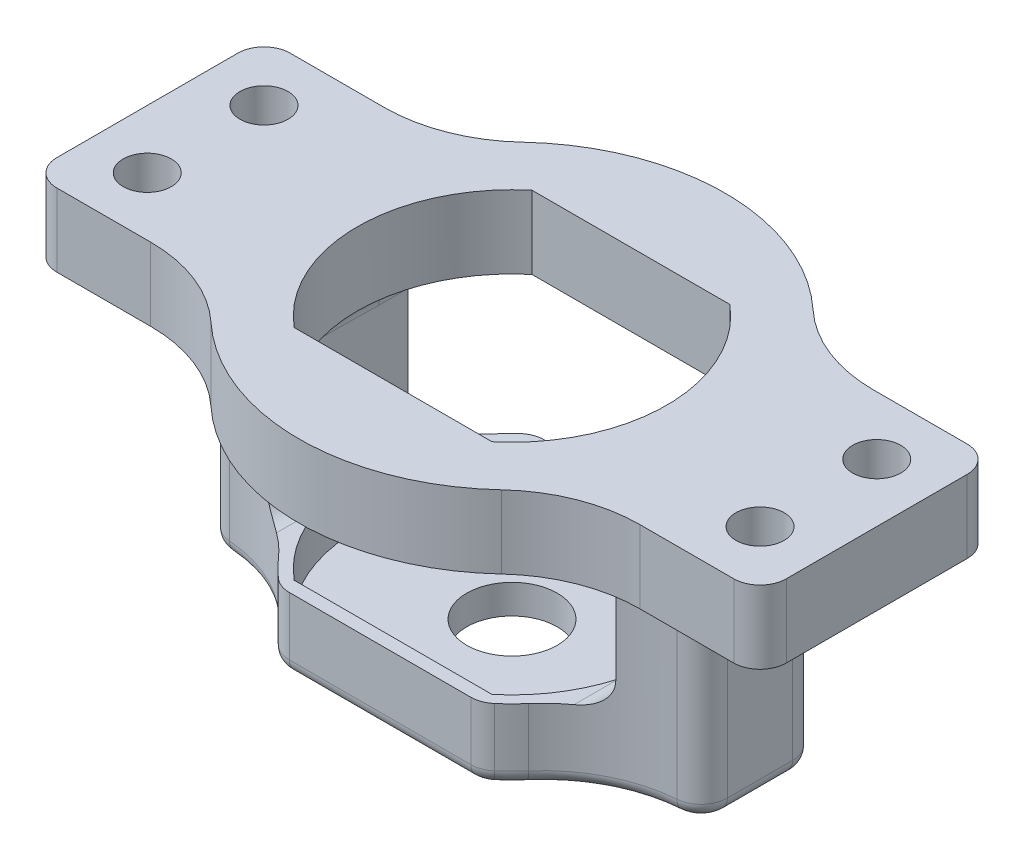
ISO-10303-21;
HEADER;
FILE_DESCRIPTION(('STEP AP214'),'2;1');
FILE_NAME('part.step','',(''),(''),'','','');
FILE_SCHEMA(('AUTOMOTIVE_DESIGN { 1 0 10303 214 1 1 1 1 }'));
ENDSEC;
DATA;
#1=APPLICATION_CONTEXT('core data for automotive mechanical design processes');
#2=APPLICATION_PROTOCOL_DEFINITION('international standard','automotive_design',2000,#1);
#3=PRODUCT_CONTEXT('',#1,'mechanical');
#4=PRODUCT('Part','Part','',(#3));
#5=PRODUCT_RELATED_PRODUCT_CATEGORY('part','',(#4));
#6=PRODUCT_DEFINITION_FORMATION('','',#4);
#7=PRODUCT_DEFINITION_CONTEXT('part definition',#1,'design');
#8=PRODUCT_DEFINITION('design','',#6,#7);
#9=PRODUCT_DEFINITION_SHAPE('','',#8);
#10=(LENGTH_UNIT() NAMED_UNIT(*) SI_UNIT(.MILLI.,.METRE.));
#11=(NAMED_UNIT(*) PLANE_ANGLE_UNIT() SI_UNIT($,.RADIAN.));
#12=(NAMED_UNIT(*) SI_UNIT($,.STERADIAN.) SOLID_ANGLE_UNIT());
#13=UNCERTAINTY_MEASURE_WITH_UNIT(LENGTH_MEASURE(1.E-05),#10,'distance_accuracy_value','');
#14=(GEOMETRIC_REPRESENTATION_CONTEXT(3) GLOBAL_UNCERTAINTY_ASSIGNED_CONTEXT((#13)) GLOBAL_UNIT_ASSIGNED_CONTEXT((#10,
#11,#12)) REPRESENTATION_CONTEXT('',''));
#15=CARTESIAN_POINT('',(0.,0.,0.));
#16=DIRECTION('',(0.,0.,1.));
#17=DIRECTION('',(1.,0.,0.));
#18=AXIS2_PLACEMENT_3D('',#15,#16,#17);
#19=CARTESIAN_POINT('',(0.,-10.,0.));
#20=DIRECTION('',(0.,1.,0.));
#21=DIRECTION('',(0.,0.,1.));
#22=AXIS2_PLACEMENT_3D('',#19,#20,#21);
#23=PLANE('',#22);
#24=CARTESIAN_POINT('',(0.,-10.,0.));
#25=DIRECTION('',(0.,1.,0.));
#26=DIRECTION('',(0.,0.,1.));
#27=AXIS2_PLACEMENT_3D('',#24,#25,#26);
#28=CIRCLE('',#27,10.6);
#29=CARTESIAN_POINT('',(-6.77772085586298,-10.,-8.15));
#30=VERTEX_POINT('',#29);
#31=CARTESIAN_POINT('',(-10.2,-10.,-2.88444102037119));
#32=VERTEX_POINT('',#31);
#33=EDGE_CURVE('E544',#30,#32,#28,.T.);
#34=ORIENTED_EDGE('',*,*,#33,.F.);
#35=DIRECTION('',(-1.,0.,0.));
#36=VECTOR('',#35,1.);
#37=CARTESIAN_POINT('',(-6.77772085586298,-10.,-8.15));
#38=LINE('',#37,#36);
#39=CARTESIAN_POINT('',(6.77772085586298,-10.,-8.15));
#40=VERTEX_POINT('',#39);
#41=EDGE_CURVE('E530',#40,#30,#38,.T.);
#42=ORIENTED_EDGE('',*,*,#41,.F.);
#43=CARTESIAN_POINT('',(0.,-10.,0.));
#44=DIRECTION('',(0.,1.,0.));
#45=DIRECTION('',(0.,0.,1.));
#46=AXIS2_PLACEMENT_3D('',#43,#44,#45);
#47=CIRCLE('',#46,10.6);
#48=CARTESIAN_POINT('',(10.2,-10.,-2.88444102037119));
#49=VERTEX_POINT('',#48);
#50=EDGE_CURVE('E551',#49,#40,#47,.T.);
#51=ORIENTED_EDGE('',*,*,#50,.F.);
#52=DIRECTION('',(0.,0.,1.));
#53=VECTOR('',#52,1.);
#54=CARTESIAN_POINT('',(10.2,-10.,-4.88771420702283));
#55=LINE('',#54,#53);
#56=CARTESIAN_POINT('',(10.2,-10.,-5.93989364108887));
#57=VERTEX_POINT('',#56);
#58=EDGE_CURVE('E842',#49,#57,#55,.F.);
#59=ORIENTED_EDGE('',*,*,#58,.T.);
#60=CARTESIAN_POINT('',(16.1190105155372,-10.,-14.));
#61=DIRECTION('',(0.,1.,0.));
#62=DIRECTION('',(0.,0.,1.));
#63=AXIS2_PLACEMENT_3D('',#60,#61,#62);
#64=CIRCLE('',#63,10.);
#65=CARTESIAN_POINT('',(8.56912268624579,-10.,-7.44262295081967));
#66=VERTEX_POINT('',#65);
#67=EDGE_CURVE('E793',#57,#66,#64,.F.);
#68=ORIENTED_EDGE('',*,*,#67,.T.);
#69=CARTESIAN_POINT('',(0.,-10.,0.));
#70=DIRECTION('',(0.,1.,0.));
#71=DIRECTION('',(0.,0.,1.));
#72=AXIS2_PLACEMENT_3D('',#69,#70,#71);
#73=CIRCLE('',#72,11.35);
#74=CARTESIAN_POINT('',(7.77593043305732,-10.,-8.2678537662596));
#75=VERTEX_POINT('',#74);
#76=EDGE_CURVE('E580',#66,#75,#73,.T.);
#77=ORIENTED_EDGE('',*,*,#76,.T.);
#78=CARTESIAN_POINT('',(6.54274322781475,-10.,-6.95665228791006));
#79=DIRECTION('',(0.,1.,0.));
#80=DIRECTION('',(0.,0.,1.));
#81=AXIS2_PLACEMENT_3D('',#78,#79,#80);
#82=CIRCLE('',#81,1.8);
#83=CARTESIAN_POINT('',(6.54274322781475,-10.,-8.75665228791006));
#84=VERTEX_POINT('',#83);
#85=EDGE_CURVE('E830',#75,#84,#82,.T.);
#86=ORIENTED_EDGE('',*,*,#85,.T.);
#87=DIRECTION('',(-1.,0.,0.));
#88=VECTOR('',#87,1.);
#89=CARTESIAN_POINT('',(-7.22104844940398,-10.,-8.75665228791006));
#90=LINE('',#89,#88);
#91=CARTESIAN_POINT('',(-6.54274322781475,-10.,-8.75665228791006));
#92=VERTEX_POINT('',#91);
#93=EDGE_CURVE('E584',#84,#92,#90,.T.);
#94=ORIENTED_EDGE('',*,*,#93,.T.);
#95=CARTESIAN_POINT('',(-6.54274322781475,-10.,-6.95665228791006));
#96=DIRECTION('',(0.,1.,0.));
#97=DIRECTION('',(0.,0.,1.));
#98=AXIS2_PLACEMENT_3D('',#95,#96,#97);
#99=CIRCLE('',#98,1.8);
#100=CARTESIAN_POINT('',(-7.77593043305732,-10.,-8.2678537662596));
#101=VERTEX_POINT('',#100);
#102=EDGE_CURVE('E833',#92,#101,#99,.T.);
#103=ORIENTED_EDGE('',*,*,#102,.T.);
#104=CARTESIAN_POINT('',(0.,-10.,0.));
#105=DIRECTION('',(0.,1.,0.));
#106=DIRECTION('',(0.,0.,1.));
#107=AXIS2_PLACEMENT_3D('',#104,#105,#106);
#108=CIRCLE('',#107,11.35);
#109=CARTESIAN_POINT('',(-8.56912268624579,-10.,-7.44262295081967));
#110=VERTEX_POINT('',#109);
#111=EDGE_CURVE('E588',#101,#110,#108,.T.);
#112=ORIENTED_EDGE('',*,*,#111,.T.);
#113=CARTESIAN_POINT('',(-16.1190105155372,-10.,-14.));
#114=DIRECTION('',(0.,1.,0.));
#115=DIRECTION('',(0.,0.,1.));
#116=AXIS2_PLACEMENT_3D('',#113,#114,#115);
#117=CIRCLE('',#116,10.);
#118=CARTESIAN_POINT('',(-10.2,-10.,-5.93989364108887));
#119=VERTEX_POINT('',#118);
#120=EDGE_CURVE('E796',#110,#119,#117,.F.);
#121=ORIENTED_EDGE('',*,*,#120,.T.);
#122=DIRECTION('',(0.,0.,1.));
#123=VECTOR('',#122,1.);
#124=CARTESIAN_POINT('',(-10.2,-10.,0.));
#125=LINE('',#124,#123);
#126=EDGE_CURVE('E849',#119,#32,#125,.T.);
#127=ORIENTED_EDGE('',*,*,#126,.T.);
#128=EDGE_LOOP('',(#34,#42,#51,#59,#68,#77,#86,#94,#103,#112,#121,#127));
#129=FACE_BOUND('',#128,.T.);
#130=ADVANCED_FACE('F49',(#129),#23,.T.);
#131=CARTESIAN_POINT('',(0.,0.,0.));
#132=DIRECTION('',(0.,1.,0.));
#133=DIRECTION('',(0.,0.,1.));
#134=AXIS2_PLACEMENT_3D('',#131,#132,#133);
#135=PLANE('',#134);
#136=CARTESIAN_POINT('',(16.1190105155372,0.,-14.));
#137=DIRECTION('',(0.,1.,0.));
#138=DIRECTION('',(0.,0.,1.));
#139=AXIS2_PLACEMENT_3D('',#136,#137,#138);
#140=CIRCLE('',#139,8.2);
#141=CARTESIAN_POINT('',(15.4803760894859,0.,-5.82490696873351));
#142=VERTEX_POINT('',#141);
#143=CARTESIAN_POINT('',(10.2,0.,-8.32502735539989));
#144=VERTEX_POINT('',#143);
#145=EDGE_CURVE('E1601',#142,#144,#140,.F.);
#146=ORIENTED_EDGE('',*,*,#145,.T.);
#147=DIRECTION('',(0.,0.,1.));
#148=VECTOR('',#147,1.);
#149=CARTESIAN_POINT('',(10.2,0.,0.));
#150=LINE('',#149,#148);
#151=CARTESIAN_POINT('',(10.2,0.,-2.88444102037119));
#152=VERTEX_POINT('',#151);
#153=EDGE_CURVE('E1581',#144,#152,#150,.T.);
#154=ORIENTED_EDGE('',*,*,#153,.T.);
#155=CARTESIAN_POINT('',(0.,0.,0.));
#156=DIRECTION('',(0.,1.,0.));
#157=DIRECTION('',(0.,0.,1.));
#158=AXIS2_PLACEMENT_3D('',#155,#156,#157);
#159=CIRCLE('',#158,10.6);
#160=CARTESIAN_POINT('',(6.77772085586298,0.,-8.15));
#161=VERTEX_POINT('',#160);
#162=EDGE_CURVE('E649',#152,#161,#159,.T.);
#163=ORIENTED_EDGE('',*,*,#162,.T.);
#164=DIRECTION('',(-1.,0.,0.));
#165=VECTOR('',#164,1.);
#166=CARTESIAN_POINT('',(-6.77772085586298,0.,-8.15));
#167=LINE('',#166,#165);
#168=CARTESIAN_POINT('',(-6.77772085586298,0.,-8.15));
#169=VERTEX_POINT('',#168);
#170=EDGE_CURVE('E629',#161,#169,#167,.T.);
#171=ORIENTED_EDGE('',*,*,#170,.T.);
#172=CARTESIAN_POINT('',(0.,0.,0.));
#173=DIRECTION('',(0.,1.,0.));
#174=DIRECTION('',(0.,0.,1.));
#175=AXIS2_PLACEMENT_3D('',#172,#173,#174);
#176=CIRCLE('',#175,10.6);
#177=CARTESIAN_POINT('',(-10.2,0.,-2.8844410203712));
#178=VERTEX_POINT('',#177);
#179=EDGE_CURVE('E640',#169,#178,#176,.T.);
#180=ORIENTED_EDGE('',*,*,#179,.T.);
#181=DIRECTION('',(0.,0.,1.));
#182=VECTOR('',#181,1.);
#183=CARTESIAN_POINT('',(-10.2,0.,-4.88771420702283));
#184=LINE('',#183,#182);
#185=CARTESIAN_POINT('',(-10.2,0.,-8.32502735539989));
#186=VERTEX_POINT('',#185);
#187=EDGE_CURVE('E2343',#178,#186,#184,.F.);
#188=ORIENTED_EDGE('',*,*,#187,.T.);
#189=CARTESIAN_POINT('',(-16.1190105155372,0.,-14.));
#190=DIRECTION('',(0.,1.,0.));
#191=DIRECTION('',(0.,0.,1.));
#192=AXIS2_PLACEMENT_3D('',#189,#190,#191);
#193=CIRCLE('',#192,8.2);
#194=CARTESIAN_POINT('',(-15.4803760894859,0.,-5.82490696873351));
#195=VERTEX_POINT('',#194);
#196=EDGE_CURVE('E2347',#186,#195,#193,.F.);
#197=ORIENTED_EDGE('',*,*,#196,.T.);
#198=CARTESIAN_POINT('',(-15.2,0.,-2.23584173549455));
#199=DIRECTION('',(0.,1.,0.));
#200=DIRECTION('',(0.,0.,1.));
#201=AXIS2_PLACEMENT_3D('',#198,#199,#200);
#202=CIRCLE('',#201,3.6);
#203=CARTESIAN_POINT('',(-18.8,0.,-2.23584173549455));
#204=VERTEX_POINT('',#203);
#205=EDGE_CURVE('E1494',#195,#204,#202,.T.);
#206=ORIENTED_EDGE('',*,*,#205,.T.);
#207=DIRECTION('',(0.,0.,-1.));
#208=VECTOR('',#207,1.);
#209=CARTESIAN_POINT('',(-18.8,0.,2.23584173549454));
#210=LINE('',#209,#208);
#211=CARTESIAN_POINT('',(-18.8,0.,2.23584173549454));
#212=VERTEX_POINT('',#211);
#213=EDGE_CURVE('E1478',#204,#212,#210,.F.);
#214=ORIENTED_EDGE('',*,*,#213,.T.);
#215=CARTESIAN_POINT('',(-15.2,0.,2.23584173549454));
#216=DIRECTION('',(0.,1.,0.));
#217=DIRECTION('',(0.,0.,1.));
#218=AXIS2_PLACEMENT_3D('',#215,#216,#217);
#219=CIRCLE('',#218,3.6);
#220=CARTESIAN_POINT('',(-15.4803760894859,0.,5.82490696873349));
#221=VERTEX_POINT('',#220);
#222=EDGE_CURVE('E2358',#212,#221,#219,.T.);
#223=ORIENTED_EDGE('',*,*,#222,.T.);
#224=CARTESIAN_POINT('',(-16.1190105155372,0.,14.));
#225=DIRECTION('',(0.,1.,0.));
#226=DIRECTION('',(0.,0.,1.));
#227=AXIS2_PLACEMENT_3D('',#224,#225,#226);
#228=CIRCLE('',#227,8.2);
#229=CARTESIAN_POINT('',(-10.2,0.,8.32502735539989));
#230=VERTEX_POINT('',#229);
#231=EDGE_CURVE('E1019',#221,#230,#228,.F.);
#232=ORIENTED_EDGE('',*,*,#231,.T.);
#233=DIRECTION('',(0.,0.,1.));
#234=VECTOR('',#233,1.);
#235=CARTESIAN_POINT('',(-10.2,0.,-4.88771420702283));
#236=LINE('',#235,#234);
#237=CARTESIAN_POINT('',(-10.2,0.,2.88444102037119));
#238=VERTEX_POINT('',#237);
#239=EDGE_CURVE('E1097',#230,#238,#236,.F.);
#240=ORIENTED_EDGE('',*,*,#239,.T.);
#241=CARTESIAN_POINT('',(-6.77772085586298,0.,8.15));
#242=VERTEX_POINT('',#241);
#243=EDGE_CURVE('E621',#238,#242,#176,.T.);
#244=ORIENTED_EDGE('',*,*,#243,.T.);
#245=DIRECTION('',(1.,0.,0.));
#246=VECTOR('',#245,1.);
#247=CARTESIAN_POINT('',(-6.77772085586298,0.,8.15));
#248=LINE('',#247,#246);
#249=CARTESIAN_POINT('',(6.77772085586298,0.,8.15));
#250=VERTEX_POINT('',#249);
#251=EDGE_CURVE('E644',#242,#250,#248,.T.);
#252=ORIENTED_EDGE('',*,*,#251,.T.);
#253=CARTESIAN_POINT('',(10.2,0.,2.88444102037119));
#254=VERTEX_POINT('',#253);
#255=EDGE_CURVE('E650',#250,#254,#159,.T.);
#256=ORIENTED_EDGE('',*,*,#255,.T.);
#257=DIRECTION('',(0.,0.,1.));
#258=VECTOR('',#257,1.);
#259=CARTESIAN_POINT('',(10.2,0.,0.));
#260=LINE('',#259,#258);
#261=CARTESIAN_POINT('',(10.2,0.,8.32502735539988));
#262=VERTEX_POINT('',#261);
#263=EDGE_CURVE('E1117',#254,#262,#260,.T.);
#264=ORIENTED_EDGE('',*,*,#263,.T.);
#265=CARTESIAN_POINT('',(16.1190105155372,0.,14.));
#266=DIRECTION('',(0.,1.,0.));
#267=DIRECTION('',(0.,0.,1.));
#268=AXIS2_PLACEMENT_3D('',#265,#266,#267);
#269=CIRCLE('',#268,8.2);
#270=CARTESIAN_POINT('',(15.4803760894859,0.,5.82490696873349));
#271=VERTEX_POINT('',#270);
#272=EDGE_CURVE('E1131',#262,#271,#269,.F.);
#273=ORIENTED_EDGE('',*,*,#272,.T.);
#274=CARTESIAN_POINT('',(15.2,0.,2.23584173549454));
#275=DIRECTION('',(0.,1.,0.));
#276=DIRECTION('',(0.,0.,1.));
#277=AXIS2_PLACEMENT_3D('',#274,#275,#276);
#278=CIRCLE('',#277,3.6);
#279=CARTESIAN_POINT('',(18.8,0.,2.23584173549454));
#280=VERTEX_POINT('',#279);
#281=EDGE_CURVE('E1130',#271,#280,#278,.T.);
#282=ORIENTED_EDGE('',*,*,#281,.T.);
#283=DIRECTION('',(0.,0.,-1.));
#284=VECTOR('',#283,1.);
#285=CARTESIAN_POINT('',(18.8,0.,0.));
#286=LINE('',#285,#284);
#287=CARTESIAN_POINT('',(18.8,0.,-2.23584173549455));
#288=VERTEX_POINT('',#287);
#289=EDGE_CURVE('E1659',#280,#288,#286,.T.);
#290=ORIENTED_EDGE('',*,*,#289,.T.);
#291=CARTESIAN_POINT('',(15.2,0.,-2.23584173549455));
#292=DIRECTION('',(0.,1.,0.));
#293=DIRECTION('',(0.,0.,1.));
#294=AXIS2_PLACEMENT_3D('',#291,#292,#293);
#295=CIRCLE('',#294,3.6);
#296=EDGE_CURVE('E1662',#288,#142,#295,.T.);
#297=ORIENTED_EDGE('',*,*,#296,.T.);
#298=EDGE_LOOP('',(#146,#154,#163,#171,#180,#188,#197,#206,#214,#223,#232,#240,#244,#252,#256,
#264,#273,#282,#290,#297));
#299=FACE_BOUND('',#298,.T.);
#300=CARTESIAN_POINT('',(21.,0.,3.99999999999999));
#301=DIRECTION('',(0.,1.,0.));
#302=DIRECTION('',(0.,0.,1.));
#303=AXIS2_PLACEMENT_3D('',#300,#301,#302);
#304=CIRCLE('',#303,1.65);
#305=CARTESIAN_POINT('',(21.,0.,5.64999999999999));
#306=VERTEX_POINT('',#305);
#307=EDGE_CURVE('E592',#306,#306,#304,.T.);
#308=ORIENTED_EDGE('',*,*,#307,.T.);
#309=EDGE_LOOP('',(#308));
#310=FACE_BOUND('',#309,.T.);
#311=CARTESIAN_POINT('',(21.,0.,-4.));
#312=DIRECTION('',(0.,1.,0.));
#313=DIRECTION('',(0.,0.,1.));
#314=AXIS2_PLACEMENT_3D('',#311,#312,#313);
#315=CIRCLE('',#314,1.65);
#316=CARTESIAN_POINT('',(21.,0.,-2.35));
#317=VERTEX_POINT('',#316);
#318=EDGE_CURVE('E597',#317,#317,#315,.T.);
#319=ORIENTED_EDGE('',*,*,#318,.T.);
#320=EDGE_LOOP('',(#319));
#321=FACE_BOUND('',#320,.T.);
#322=CARTESIAN_POINT('',(-21.,0.,4.));
#323=DIRECTION('',(0.,1.,0.));
#324=DIRECTION('',(0.,0.,1.));
#325=AXIS2_PLACEMENT_3D('',#322,#323,#324);
#326=CIRCLE('',#325,1.65);
#327=CARTESIAN_POINT('',(-21.,0.,5.65));
#328=VERTEX_POINT('',#327);
#329=EDGE_CURVE('E605',#328,#328,#326,.T.);
#330=ORIENTED_EDGE('',*,*,#329,.T.);
#331=EDGE_LOOP('',(#330));
#332=FACE_BOUND('',#331,.T.);
#333=CARTESIAN_POINT('',(-21.,0.,-4.));
#334=DIRECTION('',(0.,1.,0.));
#335=DIRECTION('',(0.,0.,1.));
#336=AXIS2_PLACEMENT_3D('',#333,#334,#335);
#337=CIRCLE('',#336,1.65);
#338=CARTESIAN_POINT('',(-21.,0.,-2.35));
#339=VERTEX_POINT('',#338);
#340=EDGE_CURVE('E613',#339,#339,#337,.T.);
#341=ORIENTED_EDGE('',*,*,#340,.T.);
#342=EDGE_LOOP('',(#341));
#343=FACE_BOUND('',#342,.T.);
#344=DIRECTION('',(-1.,0.,0.));
#345=VECTOR('',#344,1.);
#346=CARTESIAN_POINT('',(12.2131077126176,0.,-8.));
#347=LINE('',#346,#345);
#348=CARTESIAN_POINT('',(23.2,0.,-8.));
#349=VERTEX_POINT('',#348);
#350=CARTESIAN_POINT('',(16.7678263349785,0.,-8.));
#351=VERTEX_POINT('',#350);
#352=EDGE_CURVE('E678',#349,#351,#347,.T.);
#353=ORIENTED_EDGE('',*,*,#352,.F.);
#354=CARTESIAN_POINT('',(23.2,0.,-6.2));
#355=DIRECTION('',(0.,1.,0.));
#356=DIRECTION('',(0.,0.,1.));
#357=AXIS2_PLACEMENT_3D('',#354,#355,#356);
#358=CIRCLE('',#357,1.8);
#359=CARTESIAN_POINT('',(25.,0.,-6.2));
#360=VERTEX_POINT('',#359);
#361=EDGE_CURVE('E927',#349,#360,#358,.F.);
#362=ORIENTED_EDGE('',*,*,#361,.T.);
#363=DIRECTION('',(0.,0.,-1.));
#364=VECTOR('',#363,1.);
#365=CARTESIAN_POINT('',(25.,0.,-8.));
#366=LINE('',#365,#364);
#367=CARTESIAN_POINT('',(25.,0.,6.2));
#368=VERTEX_POINT('',#367);
#369=EDGE_CURVE('E727',#368,#360,#366,.T.);
#370=ORIENTED_EDGE('',*,*,#369,.F.);
#371=CARTESIAN_POINT('',(23.2,0.,6.2));
#372=DIRECTION('',(0.,1.,0.));
#373=DIRECTION('',(0.,0.,1.));
#374=AXIS2_PLACEMENT_3D('',#371,#372,#373);
#375=CIRCLE('',#374,1.8);
#376=CARTESIAN_POINT('',(23.2,0.,8.));
#377=VERTEX_POINT('',#376);
#378=EDGE_CURVE('E924',#368,#377,#375,.F.);
#379=ORIENTED_EDGE('',*,*,#378,.T.);
#380=DIRECTION('',(1.,0.,0.));
#381=VECTOR('',#380,1.);
#382=CARTESIAN_POINT('',(25.,0.,8.));
#383=LINE('',#382,#381);
#384=CARTESIAN_POINT('',(16.7678263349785,0.,8.));
#385=VERTEX_POINT('',#384);
#386=EDGE_CURVE('E723',#385,#377,#383,.T.);
#387=ORIENTED_EDGE('',*,*,#386,.F.);
#388=CARTESIAN_POINT('',(16.7678263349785,0.,18.));
#389=DIRECTION('',(0.,1.,0.));
#390=DIRECTION('',(0.,0.,1.));
#391=AXIS2_PLACEMENT_3D('',#388,#389,#390);
#392=CIRCLE('',#391,10.);
#393=CARTESIAN_POINT('',(9.95163676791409,0.,10.6829268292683));
#394=VERTEX_POINT('',#393);
#395=EDGE_CURVE('E804',#385,#394,#392,.T.);
#396=ORIENTED_EDGE('',*,*,#395,.T.);
#397=CARTESIAN_POINT('',(0.,0.,0.));
#398=DIRECTION('',(0.,1.,0.));
#399=DIRECTION('',(0.,0.,1.));
#400=AXIS2_PLACEMENT_3D('',#397,#398,#399);
#401=CIRCLE('',#400,14.6);
#402=CARTESIAN_POINT('',(-9.95163676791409,0.,10.6829268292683));
#403=VERTEX_POINT('',#402);
#404=EDGE_CURVE('E719',#403,#394,#401,.T.);
#405=ORIENTED_EDGE('',*,*,#404,.F.);
#406=CARTESIAN_POINT('',(-16.7678263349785,0.,18.));
#407=DIRECTION('',(0.,1.,0.));
#408=DIRECTION('',(0.,0.,1.));
#409=AXIS2_PLACEMENT_3D('',#406,#407,#408);
#410=CIRCLE('',#409,10.);
#411=CARTESIAN_POINT('',(-16.7678263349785,0.,8.));
#412=VERTEX_POINT('',#411);
#413=EDGE_CURVE('E823',#403,#412,#410,.T.);
#414=ORIENTED_EDGE('',*,*,#413,.T.);
#415=DIRECTION('',(1.,0.,0.));
#416=VECTOR('',#415,1.);
#417=CARTESIAN_POINT('',(-25.,0.,8.));
#418=LINE('',#417,#416);
#419=CARTESIAN_POINT('',(-23.2,0.,8.));
#420=VERTEX_POINT('',#419);
#421=EDGE_CURVE('E716',#420,#412,#418,.T.);
#422=ORIENTED_EDGE('',*,*,#421,.F.);
#423=CARTESIAN_POINT('',(-23.2,0.,6.2));
#424=DIRECTION('',(0.,1.,0.));
#425=DIRECTION('',(0.,0.,1.));
#426=AXIS2_PLACEMENT_3D('',#423,#424,#425);
#427=CIRCLE('',#426,1.8);
#428=CARTESIAN_POINT('',(-25.,0.,6.2));
#429=VERTEX_POINT('',#428);
#430=EDGE_CURVE('E918',#420,#429,#427,.F.);
#431=ORIENTED_EDGE('',*,*,#430,.T.);
#432=DIRECTION('',(0.,0.,1.));
#433=VECTOR('',#432,1.);
#434=CARTESIAN_POINT('',(-25.,0.,-8.));
#435=LINE('',#434,#433);
#436=CARTESIAN_POINT('',(-25.,0.,-6.2));
#437=VERTEX_POINT('',#436);
#438=EDGE_CURVE('E712',#437,#429,#435,.T.);
#439=ORIENTED_EDGE('',*,*,#438,.F.);
#440=CARTESIAN_POINT('',(-23.2,0.,-6.2));
#441=DIRECTION('',(0.,1.,0.));
#442=DIRECTION('',(0.,0.,1.));
#443=AXIS2_PLACEMENT_3D('',#440,#441,#442);
#444=CIRCLE('',#443,1.8);
#445=CARTESIAN_POINT('',(-23.2,0.,-8.));
#446=VERTEX_POINT('',#445);
#447=EDGE_CURVE('E921',#437,#446,#444,.F.);
#448=ORIENTED_EDGE('',*,*,#447,.T.);
#449=DIRECTION('',(-1.,0.,0.));
#450=VECTOR('',#449,1.);
#451=CARTESIAN_POINT('',(-12.2131077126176,0.,-8.));
#452=LINE('',#451,#450);
#453=CARTESIAN_POINT('',(-16.7678263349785,0.,-8.));
#454=VERTEX_POINT('',#453);
#455=EDGE_CURVE('E708',#454,#446,#452,.T.);
#456=ORIENTED_EDGE('',*,*,#455,.F.);
#457=CARTESIAN_POINT('',(-16.7678263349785,0.,-18.));
#458=DIRECTION('',(0.,1.,0.));
#459=DIRECTION('',(0.,0.,1.));
#460=AXIS2_PLACEMENT_3D('',#457,#458,#459);
#461=CIRCLE('',#460,10.);
#462=CARTESIAN_POINT('',(-9.95163676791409,0.,-10.6829268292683));
#463=VERTEX_POINT('',#462);
#464=EDGE_CURVE('E817',#454,#463,#461,.T.);
#465=ORIENTED_EDGE('',*,*,#464,.T.);
#466=CARTESIAN_POINT('',(0.,0.,0.));
#467=DIRECTION('',(0.,1.,0.));
#468=DIRECTION('',(0.,0.,1.));
#469=AXIS2_PLACEMENT_3D('',#466,#467,#468);
#470=CIRCLE('',#469,14.6);
#471=CARTESIAN_POINT('',(9.95163676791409,0.,-10.6829268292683));
#472=VERTEX_POINT('',#471);
#473=EDGE_CURVE('E672',#472,#463,#470,.T.);
#474=ORIENTED_EDGE('',*,*,#473,.F.);
#475=CARTESIAN_POINT('',(16.7678263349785,0.,-18.));
#476=DIRECTION('',(0.,1.,0.));
#477=DIRECTION('',(0.,0.,1.));
#478=AXIS2_PLACEMENT_3D('',#475,#476,#477);
#479=CIRCLE('',#478,10.);
#480=EDGE_CURVE('E810',#472,#351,#479,.T.);
#481=ORIENTED_EDGE('',*,*,#480,.T.);
#482=EDGE_LOOP('',(#353,#362,#370,#379,#387,#396,#405,#414,#422,#431,#439,#448,#456,#465,#474,#481));
#483=FACE_BOUND('',#482,.T.);
#484=ADVANCED_FACE('F1048',(#299,#310,#321,#332,#343,#483),#135,.F.);
#485=CARTESIAN_POINT('',(0.,5.,0.));
#486=DIRECTION('',(0.,1.,0.));
#487=DIRECTION('',(0.,0.,1.));
#488=AXIS2_PLACEMENT_3D('',#485,#486,#487);
#489=PLANE('',#488);
#490=CARTESIAN_POINT('',(21.,5.,-4.));
#491=DIRECTION('',(0.,1.,0.));
#492=DIRECTION('',(0.,0.,1.));
#493=AXIS2_PLACEMENT_3D('',#490,#491,#492);
#494=CIRCLE('',#493,1.65);
#495=CARTESIAN_POINT('',(21.,5.,-2.35));
#496=VERTEX_POINT('',#495);
#497=EDGE_CURVE('E601',#496,#496,#494,.T.);
#498=ORIENTED_EDGE('',*,*,#497,.F.);
#499=EDGE_LOOP('',(#498));
#500=FACE_BOUND('',#499,.T.);
#501=CARTESIAN_POINT('',(-21.,5.,-4.));
#502=DIRECTION('',(0.,1.,0.));
#503=DIRECTION('',(0.,0.,1.));
#504=AXIS2_PLACEMENT_3D('',#501,#502,#503);
#505=CIRCLE('',#504,1.65);
#506=CARTESIAN_POINT('',(-21.,5.,-2.35));
#507=VERTEX_POINT('',#506);
#508=EDGE_CURVE('E617',#507,#507,#505,.T.);
#509=ORIENTED_EDGE('',*,*,#508,.F.);
#510=EDGE_LOOP('',(#509));
#511=FACE_BOUND('',#510,.T.);
#512=DIRECTION('',(0.,0.,-1.));
#513=VECTOR('',#512,1.);
#514=CARTESIAN_POINT('',(25.,5.,-8.));
#515=LINE('',#514,#513);
#516=CARTESIAN_POINT('',(25.,5.,6.2));
#517=VERTEX_POINT('',#516);
#518=CARTESIAN_POINT('',(25.,5.,-6.2));
#519=VERTEX_POINT('',#518);
#520=EDGE_CURVE('E697',#517,#519,#515,.T.);
#521=ORIENTED_EDGE('',*,*,#520,.T.);
#522=CARTESIAN_POINT('',(23.2,5.,-6.2));
#523=DIRECTION('',(0.,1.,0.));
#524=DIRECTION('',(0.,0.,1.));
#525=AXIS2_PLACEMENT_3D('',#522,#523,#524);
#526=CIRCLE('',#525,1.8);
#527=CARTESIAN_POINT('',(23.2,5.,-8.));
#528=VERTEX_POINT('',#527);
#529=EDGE_CURVE('E946',#519,#528,#526,.T.);
#530=ORIENTED_EDGE('',*,*,#529,.T.);
#531=DIRECTION('',(-1.,0.,0.));
#532=VECTOR('',#531,1.);
#533=CARTESIAN_POINT('',(12.2131077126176,5.,-8.));
#534=LINE('',#533,#532);
#535=CARTESIAN_POINT('',(16.7678263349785,5.,-8.));
#536=VERTEX_POINT('',#535);
#537=EDGE_CURVE('E701',#528,#536,#534,.T.);
#538=ORIENTED_EDGE('',*,*,#537,.T.);
#539=CARTESIAN_POINT('',(16.7678263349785,5.,-18.));
#540=DIRECTION('',(0.,1.,0.));
#541=DIRECTION('',(0.,0.,1.));
#542=AXIS2_PLACEMENT_3D('',#539,#540,#541);
#543=CIRCLE('',#542,10.);
#544=CARTESIAN_POINT('',(9.95163676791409,5.,-10.6829268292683));
#545=VERTEX_POINT('',#544);
#546=EDGE_CURVE('E814',#536,#545,#543,.F.);
#547=ORIENTED_EDGE('',*,*,#546,.T.);
#548=CARTESIAN_POINT('',(0.,5.,0.));
#549=DIRECTION('',(0.,1.,0.));
#550=DIRECTION('',(0.,0.,1.));
#551=AXIS2_PLACEMENT_3D('',#548,#549,#550);
#552=CIRCLE('',#551,14.6);
#553=CARTESIAN_POINT('',(-9.95163676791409,5.,-10.6829268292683));
#554=VERTEX_POINT('',#553);
#555=EDGE_CURVE('E673',#545,#554,#552,.T.);
#556=ORIENTED_EDGE('',*,*,#555,.T.);
#557=CARTESIAN_POINT('',(-16.7678263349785,5.,-18.));
#558=DIRECTION('',(0.,1.,0.));
#559=DIRECTION('',(0.,0.,1.));
#560=AXIS2_PLACEMENT_3D('',#557,#558,#559);
#561=CIRCLE('',#560,10.);
#562=CARTESIAN_POINT('',(-16.7678263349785,5.,-8.));
#563=VERTEX_POINT('',#562);
#564=EDGE_CURVE('E820',#554,#563,#561,.F.);
#565=ORIENTED_EDGE('',*,*,#564,.T.);
#566=DIRECTION('',(-1.,0.,0.));
#567=VECTOR('',#566,1.);
#568=CARTESIAN_POINT('',(-12.2131077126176,5.,-8.));
#569=LINE('',#568,#567);
#570=CARTESIAN_POINT('',(-23.2,5.,-8.));
#571=VERTEX_POINT('',#570);
#572=EDGE_CURVE('E677',#563,#571,#569,.T.);
#573=ORIENTED_EDGE('',*,*,#572,.T.);
#574=CARTESIAN_POINT('',(-23.2,5.,-6.2));
#575=DIRECTION('',(0.,1.,0.));
#576=DIRECTION('',(0.,0.,1.));
#577=AXIS2_PLACEMENT_3D('',#574,#575,#576);
#578=CIRCLE('',#577,1.8);
#579=CARTESIAN_POINT('',(-25.,5.,-6.2));
#580=VERTEX_POINT('',#579);
#581=EDGE_CURVE('E940',#571,#580,#578,.T.);
#582=ORIENTED_EDGE('',*,*,#581,.T.);
#583=DIRECTION('',(0.,0.,1.));
#584=VECTOR('',#583,1.);
#585=CARTESIAN_POINT('',(-25.,5.,-8.));
#586=LINE('',#585,#584);
#587=CARTESIAN_POINT('',(-25.,5.,6.2));
#588=VERTEX_POINT('',#587);
#589=EDGE_CURVE('E682',#580,#588,#586,.T.);
#590=ORIENTED_EDGE('',*,*,#589,.T.);
#591=CARTESIAN_POINT('',(-23.2,5.,6.2));
#592=DIRECTION('',(0.,1.,0.));
#593=DIRECTION('',(0.,0.,1.));
#594=AXIS2_PLACEMENT_3D('',#591,#592,#593);
#595=CIRCLE('',#594,1.8);
#596=CARTESIAN_POINT('',(-23.2,5.,8.));
#597=VERTEX_POINT('',#596);
#598=EDGE_CURVE('E937',#588,#597,#595,.T.);
#599=ORIENTED_EDGE('',*,*,#598,.T.);
#600=DIRECTION('',(1.,0.,0.));
#601=VECTOR('',#600,1.);
#602=CARTESIAN_POINT('',(-25.,5.,8.));
#603=LINE('',#602,#601);
#604=CARTESIAN_POINT('',(-16.7678263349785,5.,8.));
#605=VERTEX_POINT('',#604);
#606=EDGE_CURVE('E686',#597,#605,#603,.T.);
#607=ORIENTED_EDGE('',*,*,#606,.T.);
#608=CARTESIAN_POINT('',(-16.7678263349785,5.,18.));
#609=DIRECTION('',(0.,1.,0.));
#610=DIRECTION('',(0.,0.,1.));
#611=AXIS2_PLACEMENT_3D('',#608,#609,#610);
#612=CIRCLE('',#611,10.);
#613=CARTESIAN_POINT('',(-9.95163676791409,5.,10.6829268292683));
#614=VERTEX_POINT('',#613);
#615=EDGE_CURVE('E827',#605,#614,#612,.F.);
#616=ORIENTED_EDGE('',*,*,#615,.T.);
#617=CARTESIAN_POINT('',(0.,5.,0.));
#618=DIRECTION('',(0.,1.,0.));
#619=DIRECTION('',(0.,0.,1.));
#620=AXIS2_PLACEMENT_3D('',#617,#618,#619);
#621=CIRCLE('',#620,14.6);
#622=CARTESIAN_POINT('',(9.95163676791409,5.,10.6829268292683));
#623=VERTEX_POINT('',#622);
#624=EDGE_CURVE('E689',#614,#623,#621,.T.);
#625=ORIENTED_EDGE('',*,*,#624,.T.);
#626=CARTESIAN_POINT('',(16.7678263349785,5.,18.));
#627=DIRECTION('',(0.,1.,0.));
#628=DIRECTION('',(0.,0.,1.));
#629=AXIS2_PLACEMENT_3D('',#626,#627,#628);
#630=CIRCLE('',#629,10.);
#631=CARTESIAN_POINT('',(16.7678263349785,5.,8.));
#632=VERTEX_POINT('',#631);
#633=EDGE_CURVE('E807',#623,#632,#630,.F.);
#634=ORIENTED_EDGE('',*,*,#633,.T.);
#635=DIRECTION('',(1.,0.,0.));
#636=VECTOR('',#635,1.);
#637=CARTESIAN_POINT('',(25.,5.,8.));
#638=LINE('',#637,#636);
#639=CARTESIAN_POINT('',(23.2,5.,8.));
#640=VERTEX_POINT('',#639);
#641=EDGE_CURVE('E693',#632,#640,#638,.T.);
#642=ORIENTED_EDGE('',*,*,#641,.T.);
#643=CARTESIAN_POINT('',(23.2,5.,6.2));
#644=DIRECTION('',(0.,1.,0.));
#645=DIRECTION('',(0.,0.,1.));
#646=AXIS2_PLACEMENT_3D('',#643,#644,#645);
#647=CIRCLE('',#646,1.8);
#648=EDGE_CURVE('E943',#640,#517,#647,.T.);
#649=ORIENTED_EDGE('',*,*,#648,.T.);
#650=EDGE_LOOP('',(#521,#530,#538,#547,#556,#565,#573,#582,#590,#599,#607,#616,#625,#634,#642,#649));
#651=FACE_BOUND('',#650,.T.);
#652=DIRECTION('',(1.,0.,0.));
#653=VECTOR('',#652,1.);
#654=CARTESIAN_POINT('',(-6.77772085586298,5.,8.15));
#655=LINE('',#654,#653);
#656=CARTESIAN_POINT('',(-6.77772085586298,5.,8.15));
#657=VERTEX_POINT('',#656);
#658=CARTESIAN_POINT('',(6.77772085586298,5.,8.15));
#659=VERTEX_POINT('',#658);
#660=EDGE_CURVE('E628',#657,#659,#655,.T.);
#661=ORIENTED_EDGE('',*,*,#660,.F.);
#662=CARTESIAN_POINT('',(0.,5.,0.));
#663=DIRECTION('',(0.,1.,0.));
#664=DIRECTION('',(0.,0.,1.));
#665=AXIS2_PLACEMENT_3D('',#662,#663,#664);
#666=CIRCLE('',#665,10.6);
#667=CARTESIAN_POINT('',(-6.77772085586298,5.,-8.15));
#668=VERTEX_POINT('',#667);
#669=EDGE_CURVE('E625',#668,#657,#666,.T.);
#670=ORIENTED_EDGE('',*,*,#669,.F.);
#671=DIRECTION('',(-1.,0.,0.));
#672=VECTOR('',#671,1.);
#673=CARTESIAN_POINT('',(-6.77772085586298,5.,-8.15));
#674=LINE('',#673,#672);
#675=CARTESIAN_POINT('',(6.77772085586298,5.,-8.15));
#676=VERTEX_POINT('',#675);
#677=EDGE_CURVE('E636',#676,#668,#674,.T.);
#678=ORIENTED_EDGE('',*,*,#677,.F.);
#679=CARTESIAN_POINT('',(0.,5.,0.));
#680=DIRECTION('',(0.,1.,0.));
#681=DIRECTION('',(0.,0.,1.));
#682=AXIS2_PLACEMENT_3D('',#679,#680,#681);
#683=CIRCLE('',#682,10.6);
#684=EDGE_CURVE('E632',#659,#676,#683,.T.);
#685=ORIENTED_EDGE('',*,*,#684,.F.);
#686=EDGE_LOOP('',(#661,#670,#678,#685));
#687=FACE_BOUND('',#686,.T.);
#688=CARTESIAN_POINT('',(-21.,5.,4.));
#689=DIRECTION('',(0.,1.,0.));
#690=DIRECTION('',(0.,0.,1.));
#691=AXIS2_PLACEMENT_3D('',#688,#689,#690);
#692=CIRCLE('',#691,1.65);
#693=CARTESIAN_POINT('',(-21.,5.,5.65));
#694=VERTEX_POINT('',#693);
#695=EDGE_CURVE('E609',#694,#694,#692,.T.);
#696=ORIENTED_EDGE('',*,*,#695,.F.);
#697=EDGE_LOOP('',(#696));
#698=FACE_BOUND('',#697,.T.);
#699=CARTESIAN_POINT('',(21.,5.,3.99999999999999));
#700=DIRECTION('',(0.,1.,0.));
#701=DIRECTION('',(0.,0.,1.));
#702=AXIS2_PLACEMENT_3D('',#699,#700,#701);
#703=CIRCLE('',#702,1.65);
#704=CARTESIAN_POINT('',(21.,5.,5.64999999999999));
#705=VERTEX_POINT('',#704);
#706=EDGE_CURVE('E593',#705,#705,#703,.T.);
#707=ORIENTED_EDGE('',*,*,#706,.F.);
#708=EDGE_LOOP('',(#707));
#709=FACE_BOUND('',#708,.T.);
#710=ADVANCED_FACE('F1055',(#500,#511,#651,#687,#698,#709),#489,.T.);
#711=CARTESIAN_POINT('',(0.,5.,0.));
#712=DIRECTION('',(0.,-1.,0.));
#713=DIRECTION('',(0.,0.,-1.));
#714=AXIS2_PLACEMENT_3D('',#711,#712,#713);
#715=CYLINDRICAL_SURFACE('',#714,14.6);
#716=ORIENTED_EDGE('',*,*,#555,.F.);
#717=DIRECTION('',(0.,-1.,0.));
#718=VECTOR('',#717,1.);
#719=CARTESIAN_POINT('',(9.95163676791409,5.,-10.6829268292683));
#720=LINE('',#719,#718);
#721=EDGE_CURVE('E760',#545,#472,#720,.T.);
#722=ORIENTED_EDGE('',*,*,#721,.T.);
#723=ORIENTED_EDGE('',*,*,#473,.T.);
#724=DIRECTION('',(0.,-1.,0.));
#725=VECTOR('',#724,1.);
#726=CARTESIAN_POINT('',(-9.95163676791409,5.,-10.6829268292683));
#727=LINE('',#726,#725);
#728=EDGE_CURVE('E757',#463,#554,#727,.F.);
#729=ORIENTED_EDGE('',*,*,#728,.T.);
#730=EDGE_LOOP('',(#716,#722,#723,#729));
#731=FACE_BOUND('',#730,.T.);
#732=ADVANCED_FACE('F2214',(#731),#715,.T.);
#733=CARTESIAN_POINT('',(-12.2131077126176,5.,-8.));
#734=DIRECTION('',(0.,0.,1.));
#735=DIRECTION('',(1.,0.,0.));
#736=AXIS2_PLACEMENT_3D('',#733,#734,#735);
#737=PLANE('',#736);
#738=ORIENTED_EDGE('',*,*,#455,.T.);
#739=DIRECTION('',(0.,-1.,0.));
#740=VECTOR('',#739,1.);
#741=CARTESIAN_POINT('',(-23.2,5.,-8.));
#742=LINE('',#741,#740);
#743=EDGE_CURVE('E959',#446,#571,#742,.F.);
#744=ORIENTED_EDGE('',*,*,#743,.T.);
#745=ORIENTED_EDGE('',*,*,#572,.F.);
#746=DIRECTION('',(0.,1.,0.));
#747=VECTOR('',#746,1.);
#748=CARTESIAN_POINT('',(-16.7678263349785,0.,-8.));
#749=LINE('',#748,#747);
#750=EDGE_CURVE('E768',#563,#454,#749,.F.);
#751=ORIENTED_EDGE('',*,*,#750,.T.);
#752=EDGE_LOOP('',(#738,#744,#745,#751));
#753=FACE_BOUND('',#752,.T.);
#754=ADVANCED_FACE('F2203',(#753),#737,.F.);
#755=CARTESIAN_POINT('',(-25.,5.,-8.));
#756=DIRECTION('',(1.,0.,0.));
#757=DIRECTION('',(0.,0.,-1.));
#758=AXIS2_PLACEMENT_3D('',#755,#756,#757);
#759=PLANE('',#758);
#760=ORIENTED_EDGE('',*,*,#589,.F.);
#761=DIRECTION('',(0.,-1.,0.));
#762=VECTOR('',#761,1.);
#763=CARTESIAN_POINT('',(-25.,5.,-6.2));
#764=LINE('',#763,#762);
#765=EDGE_CURVE('E955',#580,#437,#764,.T.);
#766=ORIENTED_EDGE('',*,*,#765,.T.);
#767=ORIENTED_EDGE('',*,*,#438,.T.);
#768=DIRECTION('',(0.,-1.,0.));
#769=VECTOR('',#768,1.);
#770=CARTESIAN_POINT('',(-25.,5.,6.2));
#771=LINE('',#770,#769);
#772=EDGE_CURVE('E952',#429,#588,#771,.F.);
#773=ORIENTED_EDGE('',*,*,#772,.T.);
#774=EDGE_LOOP('',(#760,#766,#767,#773));
#775=FACE_BOUND('',#774,.T.);
#776=ADVANCED_FACE('F2192',(#775),#759,.F.);
#777=CARTESIAN_POINT('',(-25.,5.,8.));
#778=DIRECTION('',(0.,0.,-1.));
#779=DIRECTION('',(-1.,0.,0.));
#780=AXIS2_PLACEMENT_3D('',#777,#778,#779);
#781=PLANE('',#780);
#782=ORIENTED_EDGE('',*,*,#606,.F.);
#783=DIRECTION('',(0.,-1.,0.));
#784=VECTOR('',#783,1.);
#785=CARTESIAN_POINT('',(-23.2,5.,8.));
#786=LINE('',#785,#784);
#787=EDGE_CURVE('E962',#597,#420,#786,.T.);
#788=ORIENTED_EDGE('',*,*,#787,.T.);
#789=ORIENTED_EDGE('',*,*,#421,.T.);
#790=DIRECTION('',(0.,1.,0.));
#791=VECTOR('',#790,1.);
#792=CARTESIAN_POINT('',(-16.7678263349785,5.,8.));
#793=LINE('',#792,#791);
#794=EDGE_CURVE('E772',#412,#605,#793,.T.);
#795=ORIENTED_EDGE('',*,*,#794,.T.);
#796=EDGE_LOOP('',(#782,#788,#789,#795));
#797=FACE_BOUND('',#796,.T.);
#798=ADVANCED_FACE('F2187',(#797),#781,.F.);
#799=CARTESIAN_POINT('',(0.,5.,0.));
#800=DIRECTION('',(0.,-1.,0.));
#801=DIRECTION('',(0.,0.,-1.));
#802=AXIS2_PLACEMENT_3D('',#799,#800,#801);
#803=CYLINDRICAL_SURFACE('',#802,14.6);
#804=ORIENTED_EDGE('',*,*,#404,.T.);
#805=DIRECTION('',(0.,-1.,0.));
#806=VECTOR('',#805,1.);
#807=CARTESIAN_POINT('',(9.95163676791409,5.,10.6829268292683));
#808=LINE('',#807,#806);
#809=EDGE_CURVE('E754',#394,#623,#808,.F.);
#810=ORIENTED_EDGE('',*,*,#809,.T.);
#811=ORIENTED_EDGE('',*,*,#624,.F.);
#812=DIRECTION('',(0.,-1.,0.));
#813=VECTOR('',#812,1.);
#814=CARTESIAN_POINT('',(-9.95163676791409,5.,10.6829268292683));
#815=LINE('',#814,#813);
#816=EDGE_CURVE('E750',#614,#403,#815,.T.);
#817=ORIENTED_EDGE('',*,*,#816,.T.);
#818=EDGE_LOOP('',(#804,#810,#811,#817));
#819=FACE_BOUND('',#818,.T.);
#820=ADVANCED_FACE('F2178',(#819),#803,.T.);
#821=CARTESIAN_POINT('',(25.,5.,8.));
#822=DIRECTION('',(0.,0.,-1.));
#823=DIRECTION('',(-1.,0.,0.));
#824=AXIS2_PLACEMENT_3D('',#821,#822,#823);
#825=PLANE('',#824);
#826=ORIENTED_EDGE('',*,*,#386,.T.);
#827=DIRECTION('',(0.,-1.,0.));
#828=VECTOR('',#827,1.);
#829=CARTESIAN_POINT('',(23.2,5.,8.));
#830=LINE('',#829,#828);
#831=EDGE_CURVE('E949',#377,#640,#830,.F.);
#832=ORIENTED_EDGE('',*,*,#831,.T.);
#833=ORIENTED_EDGE('',*,*,#641,.F.);
#834=DIRECTION('',(0.,1.,0.));
#835=VECTOR('',#834,1.);
#836=CARTESIAN_POINT('',(16.7678263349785,0.,8.));
#837=LINE('',#836,#835);
#838=EDGE_CURVE('E746',#632,#385,#837,.F.);
#839=ORIENTED_EDGE('',*,*,#838,.T.);
#840=EDGE_LOOP('',(#826,#832,#833,#839));
#841=FACE_BOUND('',#840,.T.);
#842=ADVANCED_FACE('F2167',(#841),#825,.F.);
#843=CARTESIAN_POINT('',(25.,5.,-8.));
#844=DIRECTION('',(-1.,0.,0.));
#845=DIRECTION('',(0.,0.,1.));
#846=AXIS2_PLACEMENT_3D('',#843,#844,#845);
#847=PLANE('',#846);
#848=ORIENTED_EDGE('',*,*,#369,.T.);
#849=DIRECTION('',(0.,-1.,0.));
#850=VECTOR('',#849,1.);
#851=CARTESIAN_POINT('',(25.,5.,-6.2));
#852=LINE('',#851,#850);
#853=EDGE_CURVE('E934',#360,#519,#852,.F.);
#854=ORIENTED_EDGE('',*,*,#853,.T.);
#855=ORIENTED_EDGE('',*,*,#520,.F.);
#856=DIRECTION('',(0.,-1.,0.));
#857=VECTOR('',#856,1.);
#858=CARTESIAN_POINT('',(25.,5.,6.2));
#859=LINE('',#858,#857);
#860=EDGE_CURVE('E930',#517,#368,#859,.T.);
#861=ORIENTED_EDGE('',*,*,#860,.T.);
#862=EDGE_LOOP('',(#848,#854,#855,#861));
#863=FACE_BOUND('',#862,.T.);
#864=ADVANCED_FACE('F2157',(#863),#847,.F.);
#865=CARTESIAN_POINT('',(12.2131077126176,5.,-8.));
#866=DIRECTION('',(0.,0.,1.));
#867=DIRECTION('',(1.,0.,0.));
#868=AXIS2_PLACEMENT_3D('',#865,#866,#867);
#869=PLANE('',#868);
#870=ORIENTED_EDGE('',*,*,#537,.F.);
#871=DIRECTION('',(0.,-1.,0.));
#872=VECTOR('',#871,1.);
#873=CARTESIAN_POINT('',(23.2,5.,-8.));
#874=LINE('',#873,#872);
#875=EDGE_CURVE('E914',#528,#349,#874,.T.);
#876=ORIENTED_EDGE('',*,*,#875,.T.);
#877=ORIENTED_EDGE('',*,*,#352,.T.);
#878=DIRECTION('',(0.,1.,0.));
#879=VECTOR('',#878,1.);
#880=CARTESIAN_POINT('',(16.7678263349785,5.,-8.));
#881=LINE('',#880,#879);
#882=EDGE_CURVE('E764',#351,#536,#881,.T.);
#883=ORIENTED_EDGE('',*,*,#882,.T.);
#884=EDGE_LOOP('',(#870,#876,#877,#883));
#885=FACE_BOUND('',#884,.T.);
#886=ADVANCED_FACE('F1180',(#885),#869,.F.);
#887=CARTESIAN_POINT('',(0.,5.,0.));
#888=DIRECTION('',(0.,-1.,0.));
#889=DIRECTION('',(0.,0.,-1.));
#890=AXIS2_PLACEMENT_3D('',#887,#888,#889);
#891=CYLINDRICAL_SURFACE('',#890,10.6);
#892=ORIENTED_EDGE('',*,*,#179,.F.);
#893=DIRECTION('',(0.,-1.,0.));
#894=VECTOR('',#893,1.);
#895=CARTESIAN_POINT('',(-6.77772085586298,5.,-8.15));
#896=LINE('',#895,#894);
#897=EDGE_CURVE('E639',#668,#169,#896,.T.);
#898=ORIENTED_EDGE('',*,*,#897,.F.);
#899=ORIENTED_EDGE('',*,*,#669,.T.);
#900=DIRECTION('',(0.,-1.,0.));
#901=VECTOR('',#900,1.);
#902=CARTESIAN_POINT('',(-6.77772085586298,5.,8.15));
#903=LINE('',#902,#901);
#904=EDGE_CURVE('E668',#657,#242,#903,.T.);
#905=ORIENTED_EDGE('',*,*,#904,.T.);
#906=ORIENTED_EDGE('',*,*,#243,.F.);
#907=EDGE_CURVE('E645',#178,#238,#176,.T.);
#908=ORIENTED_EDGE('',*,*,#907,.F.);
#909=EDGE_LOOP('',(#892,#898,#899,#905,#906,#908));
#910=FACE_BOUND('',#909,.T.);
#911=ADVANCED_FACE('F1106',(#910),#891,.F.);
#912=CARTESIAN_POINT('',(-6.77772085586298,5.,8.15));
#913=DIRECTION('',(0.,0.,-1.));
#914=DIRECTION('',(-1.,0.,0.));
#915=AXIS2_PLACEMENT_3D('',#912,#913,#914);
#916=PLANE('',#915);
#917=ORIENTED_EDGE('',*,*,#251,.F.);
#918=ORIENTED_EDGE('',*,*,#904,.F.);
#919=ORIENTED_EDGE('',*,*,#660,.T.);
#920=DIRECTION('',(0.,-1.,0.));
#921=VECTOR('',#920,1.);
#922=CARTESIAN_POINT('',(6.77772085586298,5.,8.15));
#923=LINE('',#922,#921);
#924=EDGE_CURVE('E665',#659,#250,#923,.T.);
#925=ORIENTED_EDGE('',*,*,#924,.T.);
#926=EDGE_LOOP('',(#917,#918,#919,#925));
#927=FACE_BOUND('',#926,.T.);
#928=ADVANCED_FACE('F1102',(#927),#916,.T.);
#929=CARTESIAN_POINT('',(0.,5.,0.));
#930=DIRECTION('',(0.,-1.,0.));
#931=DIRECTION('',(0.,0.,-1.));
#932=AXIS2_PLACEMENT_3D('',#929,#930,#931);
#933=CYLINDRICAL_SURFACE('',#932,10.6);
#934=ORIENTED_EDGE('',*,*,#255,.F.);
#935=ORIENTED_EDGE('',*,*,#924,.F.);
#936=ORIENTED_EDGE('',*,*,#684,.T.);
#937=DIRECTION('',(0.,-1.,0.));
#938=VECTOR('',#937,1.);
#939=CARTESIAN_POINT('',(6.77772085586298,5.,-8.15));
#940=LINE('',#939,#938);
#941=EDGE_CURVE('E661',#676,#161,#940,.T.);
#942=ORIENTED_EDGE('',*,*,#941,.T.);
#943=ORIENTED_EDGE('',*,*,#162,.F.);
#944=EDGE_CURVE('E654',#254,#152,#159,.T.);
#945=ORIENTED_EDGE('',*,*,#944,.F.);
#946=EDGE_LOOP('',(#934,#935,#936,#942,#943,#945));
#947=FACE_BOUND('',#946,.T.);
#948=ADVANCED_FACE('F1114',(#947),#933,.F.);
#949=CARTESIAN_POINT('',(-6.77772085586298,5.,-8.15));
#950=DIRECTION('',(0.,0.,1.));
#951=DIRECTION('',(1.,0.,0.));
#952=AXIS2_PLACEMENT_3D('',#949,#950,#951);
#953=PLANE('',#952);
#954=ORIENTED_EDGE('',*,*,#170,.F.);
#955=ORIENTED_EDGE('',*,*,#941,.F.);
#956=ORIENTED_EDGE('',*,*,#677,.T.);
#957=ORIENTED_EDGE('',*,*,#897,.T.);
#958=EDGE_LOOP('',(#954,#955,#956,#957));
#959=FACE_BOUND('',#958,.T.);
#960=ADVANCED_FACE('F1174',(#959),#953,.T.);
#961=CARTESIAN_POINT('',(-21.,5.,-4.));
#962=DIRECTION('',(0.,-1.,0.));
#963=DIRECTION('',(0.,0.,-1.));
#964=AXIS2_PLACEMENT_3D('',#961,#962,#963);
#965=CYLINDRICAL_SURFACE('',#964,1.65);
#966=ORIENTED_EDGE('',*,*,#508,.T.);
#967=EDGE_LOOP('',(#966));
#968=FACE_BOUND('',#967,.T.);
#969=ORIENTED_EDGE('',*,*,#340,.F.);
#970=EDGE_LOOP('',(#969));
#971=FACE_BOUND('',#970,.T.);
#972=ADVANCED_FACE('F2297',(#968,#971),#965,.F.);
#973=CARTESIAN_POINT('',(-21.,5.,4.));
#974=DIRECTION('',(0.,-1.,0.));
#975=DIRECTION('',(0.,0.,-1.));
#976=AXIS2_PLACEMENT_3D('',#973,#974,#975);
#977=CYLINDRICAL_SURFACE('',#976,1.65);
#978=ORIENTED_EDGE('',*,*,#695,.T.);
#979=EDGE_LOOP('',(#978));
#980=FACE_BOUND('',#979,.T.);
#981=ORIENTED_EDGE('',*,*,#329,.F.);
#982=EDGE_LOOP('',(#981));
#983=FACE_BOUND('',#982,.T.);
#984=ADVANCED_FACE('F2286',(#980,#983),#977,.F.);
#985=CARTESIAN_POINT('',(21.,5.,-4.));
#986=DIRECTION('',(0.,-1.,0.));
#987=DIRECTION('',(0.,0.,-1.));
#988=AXIS2_PLACEMENT_3D('',#985,#986,#987);
#989=CYLINDRICAL_SURFACE('',#988,1.65);
#990=ORIENTED_EDGE('',*,*,#497,.T.);
#991=EDGE_LOOP('',(#990));
#992=FACE_BOUND('',#991,.T.);
#993=ORIENTED_EDGE('',*,*,#318,.F.);
#994=EDGE_LOOP('',(#993));
#995=FACE_BOUND('',#994,.T.);
#996=ADVANCED_FACE('F2277',(#992,#995),#989,.F.);
#997=CARTESIAN_POINT('',(21.,5.,3.99999999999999));
#998=DIRECTION('',(0.,-1.,0.));
#999=DIRECTION('',(0.,0.,-1.));
#1000=AXIS2_PLACEMENT_3D('',#997,#998,#999);
#1001=CYLINDRICAL_SURFACE('',#1000,1.65);
#1002=ORIENTED_EDGE('',*,*,#706,.T.);
#1003=EDGE_LOOP('',(#1002));
#1004=FACE_BOUND('',#1003,.T.);
#1005=ORIENTED_EDGE('',*,*,#307,.F.);
#1006=EDGE_LOOP('',(#1005));
#1007=FACE_BOUND('',#1006,.T.);
#1008=ADVANCED_FACE('F2272',(#1004,#1007),#1001,.F.);
#1009=CARTESIAN_POINT('',(-17.,-10.,-4.00000000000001));
#1010=DIRECTION('',(1.,0.,0.));
#1011=DIRECTION('',(0.,0.,-1.));
#1012=AXIS2_PLACEMENT_3D('',#1009,#1010,#1011);
#1013=PLANE('',#1012);
#1014=CARTESIAN_POINT('',(-17.,-5.,0.));
#1015=DIRECTION('',(-1.,0.,0.));
#1016=DIRECTION('',(0.,0.,1.));
#1017=AXIS2_PLACEMENT_3D('',#1014,#1015,#1016);
#1018=CIRCLE('',#1017,1.6);
#1019=CARTESIAN_POINT('',(-17.,-5.,1.6));
#1020=VERTEX_POINT('',#1019);
#1021=EDGE_CURVE('E1721',#1020,#1020,#1018,.T.);
#1022=ORIENTED_EDGE('',*,*,#1021,.F.);
#1023=EDGE_LOOP('',(#1022));
#1024=FACE_BOUND('',#1023,.T.);
#1025=DIRECTION('',(0.,1.,0.));
#1026=VECTOR('',#1025,1.);
#1027=CARTESIAN_POINT('',(-17.,-10.,-2.23584173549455));
#1028=LINE('',#1027,#1026);
#1029=CARTESIAN_POINT('',(-17.,-1.8,-2.23584173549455));
#1030=VERTEX_POINT('',#1029);
#1031=CARTESIAN_POINT('',(-17.,-14.,-2.23584173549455));
#1032=VERTEX_POINT('',#1031);
#1033=EDGE_CURVE('E908',#1030,#1032,#1028,.F.);
#1034=ORIENTED_EDGE('',*,*,#1033,.T.);
#1035=DIRECTION('',(0.,0.,1.));
#1036=VECTOR('',#1035,1.);
#1037=CARTESIAN_POINT('',(-17.,-14.,-4.00000000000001));
#1038=LINE('',#1037,#1036);
#1039=CARTESIAN_POINT('',(-17.,-14.,2.23584173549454));
#1040=VERTEX_POINT('',#1039);
#1041=EDGE_CURVE('E74',#1032,#1040,#1038,.T.);
#1042=ORIENTED_EDGE('',*,*,#1041,.T.);
#1043=DIRECTION('',(0.,1.,0.));
#1044=VECTOR('',#1043,1.);
#1045=CARTESIAN_POINT('',(-17.,-10.,2.23584173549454));
#1046=LINE('',#1045,#1044);
#1047=CARTESIAN_POINT('',(-17.,-1.8,2.23584173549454));
#1048=VERTEX_POINT('',#1047);
#1049=EDGE_CURVE('E905',#1040,#1048,#1046,.T.);
#1050=ORIENTED_EDGE('',*,*,#1049,.T.);
#1051=DIRECTION('',(0.,0.,-1.));
#1052=VECTOR('',#1051,1.);
#1053=CARTESIAN_POINT('',(-17.,-1.8,-2.23584173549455));
#1054=LINE('',#1053,#1052);
#1055=EDGE_CURVE('E1480',#1048,#1030,#1054,.T.);
#1056=ORIENTED_EDGE('',*,*,#1055,.T.);
#1057=EDGE_LOOP('',(#1034,#1042,#1050,#1056));
#1058=FACE_BOUND('',#1057,.T.);
#1059=ADVANCED_FACE('F1543',(#1024,#1058),#1013,.F.);
#1060=CARTESIAN_POINT('',(-12.,-10.,-4.00000000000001));
#1061=DIRECTION('',(-1.,0.,0.));
#1062=DIRECTION('',(0.,0.,1.));
#1063=AXIS2_PLACEMENT_3D('',#1060,#1061,#1062);
#1064=PLANE('',#1063);
#1065=DIRECTION('',(0.,1.,0.));
#1066=VECTOR('',#1065,1.);
#1067=CARTESIAN_POINT('',(-12.,-10.,-4.88771420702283));
#1068=LINE('',#1067,#1066);
#1069=CARTESIAN_POINT('',(-12.,-8.2,-4.88771420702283));
#1070=VERTEX_POINT('',#1069);
#1071=CARTESIAN_POINT('',(-12.,-1.8,-4.88771420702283));
#1072=VERTEX_POINT('',#1071);
#1073=EDGE_CURVE('E800',#1070,#1072,#1068,.T.);
#1074=ORIENTED_EDGE('',*,*,#1073,.T.);
#1075=DIRECTION('',(0.,0.,1.));
#1076=VECTOR('',#1075,1.);
#1077=CARTESIAN_POINT('',(-12.,-1.8,4.88771420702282));
#1078=LINE('',#1077,#1076);
#1079=CARTESIAN_POINT('',(-12.,-1.8,-2.8844410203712));
#1080=VERTEX_POINT('',#1079);
#1081=EDGE_CURVE('E1556',#1072,#1080,#1078,.T.);
#1082=ORIENTED_EDGE('',*,*,#1081,.T.);
#1083=CARTESIAN_POINT('',(-12.,-1.56816453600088,-5.27584229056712));
#1084=CARTESIAN_POINT('',(-12.,-0.603722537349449,-5.02616305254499));
#1085=CARTESIAN_POINT('',(-11.1558258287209,-0.0915899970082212,-4.89357979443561));
#1086=CARTESIAN_POINT('',(-10.3116516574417,0.420542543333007,-4.76099653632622));
#1087=CARTESIAN_POINT('',(-9.41511446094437,0.,-4.86986854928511));
#1088=CARTESIAN_POINT('',(-12.,-1.58855190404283,-5.19704866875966));
#1089=CARTESIAN_POINT('',(-12.,-0.63050735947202,-4.9655977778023));
#1090=CARTESIAN_POINT('',(-11.1697978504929,-0.114382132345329,-4.84052355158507));
#1091=CARTESIAN_POINT('',(-10.339525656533,0.40185828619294,-4.71572557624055));
#1092=CARTESIAN_POINT('',(-9.44479313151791,0.,-4.81249239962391));
#1093=CARTESIAN_POINT('',(-12.,-1.607069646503,-5.11779736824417));
#1094=CARTESIAN_POINT('',(-12.,-0.655990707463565,-4.90288961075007));
#1095=CARTESIAN_POINT('',(-11.1834314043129,-0.136401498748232,-4.78512541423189));
#1096=CARTESIAN_POINT('',(-10.3667995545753,0.383288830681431,-4.66763659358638));
#1097=CARTESIAN_POINT('',(-9.47440081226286,0.,-4.75396226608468));
#1098=CARTESIAN_POINT('',(-12.,-1.64077762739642,-4.95862595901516));
#1099=CARTESIAN_POINT('',(-12.,-0.70424777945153,-4.77416896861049));
#1100=CARTESIAN_POINT('',(-11.2100182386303,-0.178778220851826,-4.6703152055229));
#1101=CARTESIAN_POINT('',(-10.4199733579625,0.346791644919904,-4.56673179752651));
#1102=CARTESIAN_POINT('',(-9.53328889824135,0.,-4.63474008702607));
#1103=CARTESIAN_POINT('',(-12.,-1.65596942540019,-4.8787061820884));
#1104=CARTESIAN_POINT('',(-12.,-0.727042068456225,-4.70815636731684));
#1105=CARTESIAN_POINT('',(-11.2229718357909,-0.199136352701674,-4.61090503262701));
#1106=CARTESIAN_POINT('',(-10.4458875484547,0.328855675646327,-4.51392698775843));
#1107=CARTESIAN_POINT('',(-9.56256945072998,0.,-4.5740490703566));
#1108=CARTESIAN_POINT('',(-12.,-1.69713922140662,-4.6385489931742));
#1109=CARTESIAN_POINT('',(-12.,-0.791257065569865,-4.50679462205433));
#1110=CARTESIAN_POINT('',(-11.2607722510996,-0.257491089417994,-4.42784643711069));
#1111=CARTESIAN_POINT('',(-10.521321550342,0.276619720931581,-4.3499749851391));
#1112=CARTESIAN_POINT('',(-9.64955881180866,0.,-4.38913834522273));
#1113=CARTESIAN_POINT('',(-12.,-1.71879621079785,-4.47757082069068));
#1114=CARTESIAN_POINT('',(-12.,-0.829011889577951,-4.36692536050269));
#1115=CARTESIAN_POINT('',(-11.2846191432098,-0.292867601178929,-4.29913466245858));
#1116=CARTESIAN_POINT('',(-10.5690628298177,0.243525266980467,-4.23238154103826));
#1117=CARTESIAN_POINT('',(-9.70654527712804,0.,-4.26183154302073));
#1118=CARTESIAN_POINT('',(-12.,-1.75314565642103,-4.1558053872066));
#1119=CARTESIAN_POINT('',(-12.,-0.895035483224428,-4.08086332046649));
#1120=CARTESIAN_POINT('',(-11.3295395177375,-0.356559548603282,-4.0327247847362));
#1121=CARTESIAN_POINT('',(-10.658907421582,0.182159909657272,-3.98560700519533));
#1122=CARTESIAN_POINT('',(-9.8170650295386,0.,-4.00065242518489));
#1123=CARTESIAN_POINT('',(-12.,-1.7658965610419,-3.99502392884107));
#1124=CARTESIAN_POINT('',(-12.,-0.923465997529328,-3.93464188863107));
#1125=CARTESIAN_POINT('',(-11.3506303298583,-0.384920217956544,-3.89509187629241));
#1126=CARTESIAN_POINT('',(-10.7011277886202,0.153795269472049,-3.856488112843));
#1127=CARTESIAN_POINT('',(-9.87061869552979,0.,-3.86682920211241));
#1128=CARTESIAN_POINT('',(-12.,-1.78483645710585,-3.67299931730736));
#1129=CARTESIAN_POINT('',(-12.,-0.972662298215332,-3.63706823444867));
#1130=CARTESIAN_POINT('',(-11.3902958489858,-0.435560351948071,-3.61235057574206));
#1131=CARTESIAN_POINT('',(-10.7804597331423,0.10170999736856,-3.58857444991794));
#1132=CARTESIAN_POINT('',(-9.97378984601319,0.,-3.59235638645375));
#1133=CARTESIAN_POINT('',(-12.,-1.7910214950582,-3.51175594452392));
#1134=CARTESIAN_POINT('',(-12.,-0.993497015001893,-3.48561007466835));
#1135=CARTESIAN_POINT('',(-11.4088690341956,-0.457836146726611,-3.46723773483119));
#1136=CARTESIAN_POINT('',(-10.8176386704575,0.0779373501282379,-3.44971484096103));
#1137=CARTESIAN_POINT('',(-10.0234049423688,0.,-3.45170273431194));
#1138=CARTESIAN_POINT('',(-12.,-1.7986498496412,-3.18962631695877));
#1139=CARTESIAN_POINT('',(-12.,-1.02887177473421,-3.17951698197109));
#1140=CARTESIAN_POINT('',(-11.4434744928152,-0.497045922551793,-3.17172086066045));
#1141=CARTESIAN_POINT('',(-10.8868505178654,0.034891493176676,-3.16476499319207));
#1142=CARTESIAN_POINT('',(-10.1176999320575,0.,-3.16463270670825));
#1143=CARTESIAN_POINT('',(-12.,-1.80010637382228,-3.02874032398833));
#1144=CARTESIAN_POINT('',(-12.,-1.04347954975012,-3.02478288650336));
#1145=CARTESIAN_POINT('',(-11.4595137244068,-0.513994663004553,-3.02133275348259));
#1146=CARTESIAN_POINT('',(-10.9189553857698,0.0155625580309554,-3.01861853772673));
#1147=CARTESIAN_POINT('',(-10.1623932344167,0.,-3.01823354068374));
#1148=CARTESIAN_POINT('',(-12.,-1.79988239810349,-2.70701093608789));
#1149=CARTESIAN_POINT('',(-12.,-1.067816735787,-2.71272625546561));
#1150=CARTESIAN_POINT('',(-11.4891291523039,-0.54347242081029,-2.71613733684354));
#1151=CARTESIAN_POINT('',(-10.9781877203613,-0.0190584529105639,-2.72028248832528));
#1152=CARTESIAN_POINT('',(-10.2462626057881,0.,-2.71995143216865));
#1153=CARTESIAN_POINT('',(-12.,-1.7982025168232,-2.54616753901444));
#1154=CARTESIAN_POINT('',(-12.,-1.07758057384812,-2.55528732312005));
#1155=CARTESIAN_POINT('',(-11.5027058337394,-0.556002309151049,-2.56133090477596));
#1156=CARTESIAN_POINT('',(-11.0053645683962,-0.0343850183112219,-2.5679994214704));
#1157=CARTESIAN_POINT('',(-10.2854397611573,0.,-2.56806957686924));
#1158=CARTESIAN_POINT('',(-12.,-1.79059217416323,-2.06315976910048));
#1159=CARTESIAN_POINT('',(-12.,-1.10141510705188,-2.08052735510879));
#1160=CARTESIAN_POINT('',(-11.5397915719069,-0.588264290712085,-2.09119386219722));
#1161=CARTESIAN_POINT('',(-11.0793835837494,-0.0749359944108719,-2.1043347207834));
#1162=CARTESIAN_POINT('',(-10.3937977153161,0.,-2.10463169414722));
#1163=CARTESIAN_POINT('',(-12.,-1.78208810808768,-1.74104592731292));
#1164=CARTESIAN_POINT('',(-12.,-1.1101938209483,-1.75865705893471));
#1165=CARTESIAN_POINT('',(-11.559599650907,-0.602609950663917,-1.77063653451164));
#1166=CARTESIAN_POINT('',(-11.1191264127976,-0.0949714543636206,-1.78412776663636));
#1167=CARTESIAN_POINT('',(-10.4536458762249,0.,-1.78575793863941));
#1168=CARTESIAN_POINT('',(-12.,-1.7691570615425,-1.1904989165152));
#1169=CARTESIAN_POINT('',(-12.,-1.11946600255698,-1.20531319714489));
#1170=CARTESIAN_POINT('',(-11.5849175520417,-0.61954868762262,-1.21605112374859));
#1171=CARTESIAN_POINT('',(-11.1698029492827,-0.119613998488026,-1.22755333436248));
#1172=CARTESIAN_POINT('',(-10.5309930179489,0.,-1.22985828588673));
#1173=CARTESIAN_POINT('',(-12.,-1.7642637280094,-0.962075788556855));
#1174=CARTESIAN_POINT('',(-12.,-1.12164389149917,-0.974617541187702));
#1175=CARTESIAN_POINT('',(-11.5929106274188,-0.624346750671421,-0.98398195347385));
#1176=CARTESIAN_POINT('',(-11.1858126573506,-0.127045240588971,-0.99374461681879));
#1177=CARTESIAN_POINT('',(-10.5557471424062,0.,-0.99601078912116));
#1178=CARTESIAN_POINT('',(-12.,-1.75731843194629,-0.505196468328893));
#1179=CARTESIAN_POINT('',(-12.,-1.12436339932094,-0.512467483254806));
#1180=CARTESIAN_POINT('',(-11.6038153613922,-0.630710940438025,-0.517795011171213));
#1181=CARTESIAN_POINT('',(-11.2076207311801,-0.137052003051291,-0.52351904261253));
#1182=CARTESIAN_POINT('',(-10.5896285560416,0.,-0.524872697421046));
#1183=CARTESIAN_POINT('',(-12.,-1.75526625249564,-0.276740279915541));
#1184=CARTESIAN_POINT('',(-12.,-1.12491009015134,-0.280647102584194));
#1185=CARTESIAN_POINT('',(-11.6067274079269,-0.632277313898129,-0.283677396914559));
#1186=CARTESIAN_POINT('',(-11.21345459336,-0.139644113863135,-0.286733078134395));
#1187=CARTESIAN_POINT('',(-10.598757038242,0.,-0.287582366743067));
#1188=CARTESIAN_POINT('',(-12.,-1.75477170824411,0.180061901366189));
#1189=CARTESIAN_POINT('',(-12.,-1.12505607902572,0.18258214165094));
#1190=CARTESIAN_POINT('',(-11.6074459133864,-0.632672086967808,0.184574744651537));
#1191=CARTESIAN_POINT('',(-11.2148919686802,-0.140288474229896,0.186540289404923));
#1192=CARTESIAN_POINT('',(-10.6010048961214,0.,0.187113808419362));
#1193=CARTESIAN_POINT('',(-12.,-1.7563275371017,0.408407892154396));
#1194=CARTESIAN_POINT('',(-12.,-1.1246560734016,0.414359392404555));
#1195=CARTESIAN_POINT('',(-11.6052549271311,-0.631501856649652,0.418709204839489));
#1196=CARTESIAN_POINT('',(-11.2105028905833,-0.138344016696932,0.423403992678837));
#1197=CARTESIAN_POINT('',(-10.5941322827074,0.,0.424519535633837));
#1198=CARTESIAN_POINT('',(-12.,-1.76247341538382,0.865080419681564));
#1199=CARTESIAN_POINT('',(-12.,-1.12240305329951,0.876590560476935));
#1200=CARTESIAN_POINT('',(-11.5957916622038,-0.626057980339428,0.885219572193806));
#1201=CARTESIAN_POINT('',(-11.19157629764,-0.12970848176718,0.894193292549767));
#1202=CARTESIAN_POINT('',(-10.564679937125,0.,0.896338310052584));
#1203=CARTESIAN_POINT('',(-12.,-1.76706382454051,1.09340695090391));
#1204=CARTESIAN_POINT('',(-12.,-1.12054591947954,1.10741048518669));
#1205=CARTESIAN_POINT('',(-11.5885187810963,-0.621783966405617,1.11759526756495));
#1206=CARTESIAN_POINT('',(-11.1770074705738,-0.123002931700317,1.12848912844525));
#1207=CARTESIAN_POINT('',(-10.54209834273,0.,1.1307509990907));
#1208=CARTESIAN_POINT('',(-12.,-1.77748244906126,1.5500825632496));
#1209=CARTESIAN_POINT('',(-12.,-1.11377519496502,1.56668577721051));
#1210=CARTESIAN_POINT('',(-11.5689426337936,-0.608973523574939,1.5786958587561));
#1211=CARTESIAN_POINT('',(-11.137855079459,-0.104151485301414,1.59141670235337));
#1212=CARTESIAN_POINT('',(-10.48212024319,0.,1.5936265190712));
#1213=CARTESIAN_POINT('',(-12.,-1.78331095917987,1.77843163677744));
#1214=CARTESIAN_POINT('',(-12.,-1.10884601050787,1.79550065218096));
#1215=CARTESIAN_POINT('',(-11.5566381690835,-0.60043607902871,1.80741987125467));
#1216=CARTESIAN_POINT('',(-11.1132068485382,-0.0919723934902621,1.82039988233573));
#1217=CARTESIAN_POINT('',(-10.4447202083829,0.,1.8220879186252));
#1218=CARTESIAN_POINT('',(-12.,-1.79338791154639,2.23511018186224));
#1219=CARTESIAN_POINT('',(-12.,-1.09343108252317,2.24944346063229));
#1220=CARTESIAN_POINT('',(-11.5270592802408,-0.577312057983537,2.25906887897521));
#1221=CARTESIAN_POINT('',(-11.0540488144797,-0.0611379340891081,2.26975953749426));
#1222=CARTESIAN_POINT('',(-10.3565197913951,0.,2.27039475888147));
#1223=CARTESIAN_POINT('',(-12.,-1.79763675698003,2.46343964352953));
#1224=CARTESIAN_POINT('',(-12.,-1.08290795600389,2.47492375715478));
#1225=CARTESIAN_POINT('',(-11.5097861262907,-0.562727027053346,2.48199534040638));
#1226=CARTESIAN_POINT('',(-11.0194468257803,-0.0424285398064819,2.49046264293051));
#1227=CARTESIAN_POINT('',(-10.3057228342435,0.,2.49024238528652));
#1228=CARTESIAN_POINT('',(-12.,-1.80093109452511,2.9203517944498));
#1229=CARTESIAN_POINT('',(-12.,-1.05311124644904,2.92082255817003));
#1230=CARTESIAN_POINT('',(-11.4702745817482,-0.52527116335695,2.91987188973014));
#1231=CARTESIAN_POINT('',(-10.9404219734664,0.00269084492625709,2.92032502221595));
#1232=CARTESIAN_POINT('',(-10.1924511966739,0.,2.91945829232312));
#1233=CARTESIAN_POINT('',(-12.,-1.79997263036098,3.14893454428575));
#1234=CARTESIAN_POINT('',(-12.,-1.03374978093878,3.14157591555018));
#1235=CARTESIAN_POINT('',(-11.4480324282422,-0.502394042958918,3.13481578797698));
#1236=CARTESIAN_POINT('',(-10.8958625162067,0.0291939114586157,3.12975907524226));
#1237=CARTESIAN_POINT('',(-10.1299676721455,0.,3.12881848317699));
#1238=CARTESIAN_POINT('',(-12.,-1.79128211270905,3.49175358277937));
#1239=CARTESIAN_POINT('',(-12.,-0.995442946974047,3.4662227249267));
#1240=CARTESIAN_POINT('',(-11.4109069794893,-0.460036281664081,3.44863552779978));
#1241=CARTESIAN_POINT('',(-10.8217634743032,0.0754272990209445,3.43147857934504));
#1242=CARTESIAN_POINT('',(-10.0290481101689,0.,3.43361033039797));
#1243=CARTESIAN_POINT('',(-12.,-1.787172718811,3.60607278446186));
#1244=CARTESIAN_POINT('',(-12.,-0.981054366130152,3.57380003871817));
#1245=CARTESIAN_POINT('',(-11.3978975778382,-0.444567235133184,3.55185734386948));
#1246=CARTESIAN_POINT('',(-10.7957325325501,0.0919984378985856,3.53037592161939));
#1247=CARTESIAN_POINT('',(-9.99419057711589,0.,3.53371245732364));
#1248=CARTESIAN_POINT('',(-12.,-1.77585916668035,3.83458963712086));
#1249=CARTESIAN_POINT('',(-12.,-0.948644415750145,3.78652154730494));
#1250=CARTESIAN_POINT('',(-11.3706065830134,-0.410655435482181,3.75480026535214));
#1251=CARTESIAN_POINT('',(-10.7411510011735,0.127410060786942,3.72354568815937));
#1252=CARTESIAN_POINT('',(-9.92237162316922,0.,3.73062165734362));
#1253=CARTESIAN_POINT('',(-12.,-1.76865407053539,3.94878724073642));
#1254=CARTESIAN_POINT('',(-12.,-0.930597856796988,3.89170231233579));
#1255=CARTESIAN_POINT('',(-11.3563246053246,-0.392211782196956,3.85452029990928));
#1256=CARTESIAN_POINT('',(-10.7125756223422,0.146269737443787,3.81783948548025));
#1257=CARTESIAN_POINT('',(-9.88540956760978,0.,3.8274277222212));
#1258=CARTESIAN_POINT('',(-12.,-1.75956536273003,4.06285627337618));
#1259=CARTESIAN_POINT('',(-12.,-0.910525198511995,3.99511526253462));
#1260=CARTESIAN_POINT('',(-11.3414004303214,-0.372139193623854,3.95215991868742));
#1261=CARTESIAN_POINT('',(-10.6828008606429,0.166246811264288,3.90920457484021));
#1262=CARTESIAN_POINT('',(-9.8475499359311,0.,3.9224686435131));
#1263=(BOUNDED_SURFACE() B_SPLINE_SURFACE(3,2,((#1083,#1084,#1085,#1086,#1087),(#1088,#1089,
#1090,#1091,#1092),(#1093,#1094,#1095,#1096,#1097),(#1098,#1099,#1100,#1101,#1102),(#1103,#1104,
#1105,#1106,#1107),(#1108,#1109,#1110,#1111,#1112),(#1113,#1114,#1115,#1116,#1117),(#1118,#1119,
#1120,#1121,#1122),(#1123,#1124,#1125,#1126,#1127),(#1128,#1129,#1130,#1131,#1132),(#1133,#1134,
#1135,#1136,#1137),(#1138,#1139,#1140,#1141,#1142),(#1143,#1144,#1145,#1146,#1147),(#1148,#1149,
#1150,#1151,#1152),(#1153,#1154,#1155,#1156,#1157),(#1158,#1159,#1160,#1161,#1162),(#1163,#1164,
#1165,#1166,#1167),(#1168,#1169,#1170,#1171,#1172),(#1173,#1174,#1175,#1176,#1177),(#1178,#1179,
#1180,#1181,#1182),(#1183,#1184,#1185,#1186,#1187),(#1188,#1189,#1190,#1191,#1192),(#1193,#1194,
#1195,#1196,#1197),(#1198,#1199,#1200,#1201,#1202),(#1203,#1204,#1205,#1206,#1207),(#1208,#1209,
#1210,#1211,#1212),(#1213,#1214,#1215,#1216,#1217),(#1218,#1219,#1220,#1221,#1222),(#1223,#1224,
#1225,#1226,#1227),(#1228,#1229,#1230,#1231,#1232),(#1233,#1234,#1235,#1236,#1237),(#1238,#1239,
#1240,#1241,#1242),(#1243,#1244,#1245,#1246,#1247),(#1248,#1249,#1250,#1251,#1252),(#1253,#1254,
#1255,#1256,#1257),(#1258,#1259,#1260,#1261,#1262)),.UNSPECIFIED.,.F.,.F.,
.F.) B_SPLINE_SURFACE_WITH_KNOTS((4,2,2,2,2,2,2,2,2,2,2,2,2,2,2,2,2,4),(3,2,3),(0.,
0.244103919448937,0.488093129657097,0.975014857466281,1.45871022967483,1.94269668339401,
2.42533011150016,2.9078683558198,3.87452870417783,4.55995073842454,5.24532043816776,
5.93034708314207,6.61545494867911,7.30072610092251,7.98582222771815,8.6714389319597,
9.01457992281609,9.35782494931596),(0.,0.5,1.),
.UNSPECIFIED.) GEOMETRIC_REPRESENTATION_ITEM() RATIONAL_B_SPLINE_SURFACE(((1.,0.874932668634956,
1.,0.874932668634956,1.),(1.,0.87715058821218,1.,0.87715058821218,1.),(1.,0.879306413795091,1.,
0.879306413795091,1.),(1.,0.88349590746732,1.,0.88349590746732,1.),(1.,0.885529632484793,1.,
0.885529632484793,1.),(1.,0.89144518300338,1.,0.89144518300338,1.),(1.,0.895150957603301,1.,
0.895150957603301,1.),(1.,0.902093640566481,1.,0.902093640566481,1.),(1.,0.905333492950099,1.,
0.905333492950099,1.),(1.,0.911398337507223,1.,0.911398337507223,1.),(1.,0.914223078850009,1.,
0.914223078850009,1.),(1.,0.919465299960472,1.,0.919465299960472,1.),(1.,0.921883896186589,1.,
0.921883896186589,1.),(1.,0.926334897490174,1.,0.926334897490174,1.),(1.,0.928367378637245,1.,
0.928367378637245,1.),(1.,0.933904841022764,1.,0.933904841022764,1.),(1.,0.936841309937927,1.,
0.936841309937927,1.),(1.,0.940585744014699,1.,0.940585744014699,1.),(1.,0.941764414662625,1.,
0.941764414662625,1.),(1.,0.943371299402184,1.,0.943371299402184,1.),(1.,0.943799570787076,1.,
0.943799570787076,1.),(1.,0.943905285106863,1.,0.943905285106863,1.),(1.,0.943583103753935,1.,
0.943583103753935,1.),(1.,0.94218915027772,1.,0.94218915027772,1.),(1.,0.941117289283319,1.,
0.941117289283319,1.),(1.,0.938223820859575,1.,0.938223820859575,1.),(1.,0.936402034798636,1.,
0.936402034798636,1.),(1.,0.932004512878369,1.,0.932004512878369,1.),(1.,0.929428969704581,1.,
0.929428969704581,1.),(1.,0.923505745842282,1.,0.923505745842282,1.),(1.,0.920157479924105,1.,
0.920157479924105,1.),(1.,0.914530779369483,1.,0.914530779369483,1.),(1.,0.912553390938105,1.,
0.912553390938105,1.),(1.,0.908390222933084,1.,0.908390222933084,1.),(1.,0.906204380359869,1.,
0.906204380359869,1.),(1.,0.903911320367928,1.,0.903911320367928,1.))) REPRESENTATION_ITEM('') SURFACE());
#1264=CARTESIAN_POINT('',(-12.,-1.56816453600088,-5.27584229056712));
#1265=CARTESIAN_POINT('',(-12.,-1.58855190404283,-5.19704866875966));
#1266=CARTESIAN_POINT('',(-12.,-1.607069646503,-5.11779736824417));
#1267=CARTESIAN_POINT('',(-12.,-1.64077762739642,-4.95862595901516));
#1268=CARTESIAN_POINT('',(-12.,-1.65596942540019,-4.8787061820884));
#1269=CARTESIAN_POINT('',(-12.,-1.69713922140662,-4.6385489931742));
#1270=CARTESIAN_POINT('',(-12.,-1.71879621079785,-4.47757082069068));
#1271=CARTESIAN_POINT('',(-12.,-1.75314565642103,-4.1558053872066));
#1272=CARTESIAN_POINT('',(-12.,-1.7658965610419,-3.99502392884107));
#1273=CARTESIAN_POINT('',(-12.,-1.78483645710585,-3.67299931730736));
#1274=CARTESIAN_POINT('',(-12.,-1.7910214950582,-3.51175594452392));
#1275=CARTESIAN_POINT('',(-12.,-1.7986498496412,-3.18962631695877));
#1276=CARTESIAN_POINT('',(-12.,-1.80010637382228,-3.02874032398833));
#1277=CARTESIAN_POINT('',(-12.,-1.79988239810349,-2.70701093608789));
#1278=CARTESIAN_POINT('',(-12.,-1.7982025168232,-2.54616753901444));
#1279=CARTESIAN_POINT('',(-12.,-1.79059217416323,-2.06315976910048));
#1280=CARTESIAN_POINT('',(-12.,-1.78208810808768,-1.74104592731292));
#1281=CARTESIAN_POINT('',(-12.,-1.7691570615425,-1.1904989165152));
#1282=CARTESIAN_POINT('',(-12.,-1.7642637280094,-0.962075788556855));
#1283=CARTESIAN_POINT('',(-12.,-1.75731843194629,-0.505196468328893));
#1284=CARTESIAN_POINT('',(-12.,-1.75526625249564,-0.276740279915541));
#1285=CARTESIAN_POINT('',(-12.,-1.75477170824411,0.180061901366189));
#1286=CARTESIAN_POINT('',(-12.,-1.7563275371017,0.408407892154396));
#1287=CARTESIAN_POINT('',(-12.,-1.76247341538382,0.865080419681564));
#1288=CARTESIAN_POINT('',(-12.,-1.76706382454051,1.09340695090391));
#1289=CARTESIAN_POINT('',(-12.,-1.77748244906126,1.5500825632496));
#1290=CARTESIAN_POINT('',(-12.,-1.78331095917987,1.77843163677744));
#1291=CARTESIAN_POINT('',(-12.,-1.79338791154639,2.23511018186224));
#1292=CARTESIAN_POINT('',(-12.,-1.79763675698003,2.46343964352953));
#1293=CARTESIAN_POINT('',(-12.,-1.80093109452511,2.9203517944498));
#1294=CARTESIAN_POINT('',(-12.,-1.79997263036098,3.14893454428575));
#1295=CARTESIAN_POINT('',(-12.,-1.79128211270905,3.49175358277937));
#1296=CARTESIAN_POINT('',(-12.,-1.787172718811,3.60607278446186));
#1297=CARTESIAN_POINT('',(-12.,-1.77585916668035,3.83458963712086));
#1298=CARTESIAN_POINT('',(-12.,-1.76865407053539,3.94878724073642));
#1299=CARTESIAN_POINT('',(-12.,-1.75956536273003,4.06285627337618));
#1300=B_SPLINE_CURVE_WITH_KNOTS('',3,(#1264,#1265,#1266,#1267,#1268,#1269,#1270,#1271,#1272,
#1273,#1274,#1275,#1276,#1277,#1278,#1279,#1280,#1281,#1282,#1283,#1284,#1285,#1286,#1287,#1288,
#1289,#1290,#1291,#1292,#1293,#1294,#1295,#1296,#1297,#1298,#1299),.UNSPECIFIED.,.F.,.F.,(4,2,2,
2,2,2,2,2,2,2,2,2,2,2,2,2,2,4),(0.,0.244103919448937,0.488093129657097,0.975014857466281,
1.45871022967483,1.94269668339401,2.42533011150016,2.9078683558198,3.87452870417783,
4.55995073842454,5.24532043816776,5.93034708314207,6.61545494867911,7.30072610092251,
7.98582222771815,8.6714389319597,9.01457992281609,9.35782494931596),.UNSPECIFIED.);
#1301=CARTESIAN_POINT('',(-12.,-1.8,2.88444102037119));
#1302=VERTEX_POINT('',#1301);
#1303=EDGE_CURVE('E1548',#1080,#1302,#1300,.T.);
#1304=ORIENTED_EDGE('',*,*,#1303,.T.);
#1305=DIRECTION('',(0.,0.,1.));
#1306=VECTOR('',#1305,1.);
#1307=CARTESIAN_POINT('',(-12.,-1.8,4.88771420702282));
#1308=LINE('',#1307,#1306);
#1309=CARTESIAN_POINT('',(-12.,-1.8,4.88771420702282));
#1310=VERTEX_POINT('',#1309);
#1311=EDGE_CURVE('E1557',#1302,#1310,#1308,.T.);
#1312=ORIENTED_EDGE('',*,*,#1311,.T.);
#1313=DIRECTION('',(0.,1.,0.));
#1314=VECTOR('',#1313,1.);
#1315=CARTESIAN_POINT('',(-12.,0.,4.88771420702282));
#1316=LINE('',#1315,#1314);
#1317=CARTESIAN_POINT('',(-12.,-8.2,4.88771420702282));
#1318=VERTEX_POINT('',#1317);
#1319=EDGE_CURVE('E776',#1310,#1318,#1316,.F.);
#1320=ORIENTED_EDGE('',*,*,#1319,.T.);
#1321=DIRECTION('',(0.,0.,1.));
#1322=VECTOR('',#1321,1.);
#1323=CARTESIAN_POINT('',(-12.,-8.2,-4.00000000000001));
#1324=LINE('',#1323,#1322);
#1325=EDGE_CURVE('E853',#1318,#1070,#1324,.F.);
#1326=ORIENTED_EDGE('',*,*,#1325,.T.);
#1327=EDGE_LOOP('',(#1074,#1082,#1304,#1312,#1320,#1326));
#1328=FACE_BOUND('',#1327,.T.);
#1329=ADVANCED_FACE('F1538',(#1328),#1064,.F.);
#1330=CARTESIAN_POINT('',(17.,-10.,-4.00000000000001));
#1331=DIRECTION('',(1.,0.,0.));
#1332=DIRECTION('',(0.,0.,-1.));
#1333=AXIS2_PLACEMENT_3D('',#1330,#1331,#1332);
#1334=PLANE('',#1333);
#1335=CARTESIAN_POINT('',(17.,-5.,0.));
#1336=DIRECTION('',(-1.,0.,0.));
#1337=DIRECTION('',(0.,0.,1.));
#1338=AXIS2_PLACEMENT_3D('',#1335,#1336,#1337);
#1339=CIRCLE('',#1338,1.6);
#1340=CARTESIAN_POINT('',(17.,-5.,1.6));
#1341=VERTEX_POINT('',#1340);
#1342=EDGE_CURVE('E1729',#1341,#1341,#1339,.T.);
#1343=ORIENTED_EDGE('',*,*,#1342,.T.);
#1344=EDGE_LOOP('',(#1343));
#1345=FACE_BOUND('',#1344,.T.);
#1346=DIRECTION('',(0.,-1.,0.));
#1347=VECTOR('',#1346,1.);
#1348=CARTESIAN_POINT('',(17.,-15.,2.23584173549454));
#1349=LINE('',#1348,#1347);
#1350=CARTESIAN_POINT('',(17.,-1.8,2.23584173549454));
#1351=VERTEX_POINT('',#1350);
#1352=CARTESIAN_POINT('',(17.,-14.,2.23584173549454));
#1353=VERTEX_POINT('',#1352);
#1354=EDGE_CURVE('E888',#1351,#1353,#1349,.T.);
#1355=ORIENTED_EDGE('',*,*,#1354,.T.);
#1356=DIRECTION('',(0.,0.,-1.));
#1357=VECTOR('',#1356,1.);
#1358=CARTESIAN_POINT('',(17.,-14.,-2.23584173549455));
#1359=LINE('',#1358,#1357);
#1360=CARTESIAN_POINT('',(17.,-14.,-2.23584173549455));
#1361=VERTEX_POINT('',#1360);
#1362=EDGE_CURVE('E1313',#1353,#1361,#1359,.T.);
#1363=ORIENTED_EDGE('',*,*,#1362,.T.);
#1364=DIRECTION('',(0.,-1.,0.));
#1365=VECTOR('',#1364,1.);
#1366=CARTESIAN_POINT('',(17.,0.,-2.23584173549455));
#1367=LINE('',#1366,#1365);
#1368=CARTESIAN_POINT('',(17.,-1.8,-2.23584173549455));
#1369=VERTEX_POINT('',#1368);
#1370=EDGE_CURVE('E892',#1361,#1369,#1367,.F.);
#1371=ORIENTED_EDGE('',*,*,#1370,.T.);
#1372=DIRECTION('',(0.,0.,-1.));
#1373=VECTOR('',#1372,1.);
#1374=CARTESIAN_POINT('',(17.,-1.8,-4.00000000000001));
#1375=LINE('',#1374,#1373);
#1376=EDGE_CURVE('E1599',#1369,#1351,#1375,.F.);
#1377=ORIENTED_EDGE('',*,*,#1376,.T.);
#1378=EDGE_LOOP('',(#1355,#1363,#1371,#1377));
#1379=FACE_BOUND('',#1378,.T.);
#1380=ADVANCED_FACE('F1071',(#1345,#1379),#1334,.T.);
#1381=CARTESIAN_POINT('',(12.,-10.,-4.00000000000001));
#1382=DIRECTION('',(-1.,0.,0.));
#1383=DIRECTION('',(0.,0.,1.));
#1384=AXIS2_PLACEMENT_3D('',#1381,#1382,#1383);
#1385=PLANE('',#1384);
#1386=DIRECTION('',(0.,1.,0.));
#1387=VECTOR('',#1386,1.);
#1388=CARTESIAN_POINT('',(12.,-10.,4.88771420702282));
#1389=LINE('',#1388,#1387);
#1390=CARTESIAN_POINT('',(12.,-8.2,4.88771420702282));
#1391=VERTEX_POINT('',#1390);
#1392=CARTESIAN_POINT('',(12.,-1.8,4.88771420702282));
#1393=VERTEX_POINT('',#1392);
#1394=EDGE_CURVE('E786',#1391,#1393,#1389,.T.);
#1395=ORIENTED_EDGE('',*,*,#1394,.T.);
#1396=DIRECTION('',(0.,0.,1.));
#1397=VECTOR('',#1396,1.);
#1398=CARTESIAN_POINT('',(12.,-1.8,-4.00000000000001));
#1399=LINE('',#1398,#1397);
#1400=CARTESIAN_POINT('',(12.,-1.8,2.88444102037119));
#1401=VERTEX_POINT('',#1400);
#1402=EDGE_CURVE('E1526',#1393,#1401,#1399,.F.);
#1403=ORIENTED_EDGE('',*,*,#1402,.T.);
#1404=CARTESIAN_POINT('',(12.,-1.56816453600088,5.2758422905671));
#1405=CARTESIAN_POINT('',(12.,-0.60372254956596,5.02616303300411));
#1406=CARTESIAN_POINT('',(11.1558258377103,-0.0915900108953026,4.89357976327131));
#1407=CARTESIAN_POINT('',(10.3116516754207,0.420542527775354,4.76099649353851));
#1408=CARTESIAN_POINT('',(9.41511448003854,0.,4.86986851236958));
#1409=CARTESIAN_POINT('',(12.,-1.58855190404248,5.19704866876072));
#1410=CARTESIAN_POINT('',(12.,-0.630507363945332,4.96559777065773));
#1411=CARTESIAN_POINT('',(11.1697978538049,-0.114382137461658,4.84052354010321));
#1412=CARTESIAN_POINT('',(10.3395256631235,0.40185828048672,4.7157255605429));
#1413=CARTESIAN_POINT('',(9.44479313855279,0.,4.81249238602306));
#1414=CARTESIAN_POINT('',(12.,-1.60706964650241,5.11779736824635));
#1415=CARTESIAN_POINT('',(12.,-0.655990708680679,4.90288960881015));
#1416=CARTESIAN_POINT('',(11.1834314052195,-0.136401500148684,4.78512541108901));
#1417=CARTESIAN_POINT('',(10.3667995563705,0.383288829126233,4.66763658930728));
#1418=CARTESIAN_POINT('',(9.47440081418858,0.,4.75396226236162));
#1419=CARTESIAN_POINT('',(12.,-1.64077762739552,4.95862595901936));
#1420=CARTESIAN_POINT('',(12.,-0.704247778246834,4.77416897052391));
#1421=CARTESIAN_POINT('',(11.2100182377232,-0.178778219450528,4.67031520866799));
#1422=CARTESIAN_POINT('',(10.4199733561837,0.346791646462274,4.56673180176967));
#1423=CARTESIAN_POINT('',(9.53328889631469,0.,4.63474009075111));
#1424=CARTESIAN_POINT('',(12.,-1.65596942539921,4.87870618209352));
#1425=CARTESIAN_POINT('',(12.,-0.727042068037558,4.70815636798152));
#1426=CARTESIAN_POINT('',(11.2229718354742,-0.199136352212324,4.61090503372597));
#1427=CARTESIAN_POINT('',(10.4458875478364,0.328855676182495,4.51392698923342));
#1428=CARTESIAN_POINT('',(9.56256945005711,0.,4.57404907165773));
#1429=CARTESIAN_POINT('',(12.,-1.69713922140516,4.63854899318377));
#1430=CARTESIAN_POINT('',(12.,-0.791257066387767,4.50679462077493));
#1431=CARTESIAN_POINT('',(11.2607722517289,-0.257491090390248,4.42784643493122));
#1432=CARTESIAN_POINT('',(10.5213215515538,0.276619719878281,4.34997498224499));
#1433=CARTESIAN_POINT('',(9.64955881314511,0.,4.38913834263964));
#1434=CARTESIAN_POINT('',(12.,-1.71879621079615,4.47757082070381));
#1435=CARTESIAN_POINT('',(12.,-0.829011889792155,4.36692536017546));
#1436=CARTESIAN_POINT('',(11.2846191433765,-0.292867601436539,4.29913466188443));
#1437=CARTESIAN_POINT('',(10.5690628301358,0.243525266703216,4.23238154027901));
#1438=CARTESIAN_POINT('',(9.70654527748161,0.,4.2618315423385));
#1439=CARTESIAN_POINT('',(12.,-1.75314565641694,4.1558053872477));
#1440=CARTESIAN_POINT('',(12.,-0.895035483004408,4.08086332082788));
#1441=CARTESIAN_POINT('',(11.3295395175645,-0.356559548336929,4.03272478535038));
#1442=CARTESIAN_POINT('',(10.6589074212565,0.182159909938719,3.9856070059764));
#1443=CARTESIAN_POINT('',(9.8170650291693,0.,4.00065242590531));
#1444=CARTESIAN_POINT('',(12.,-1.76589656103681,3.99502392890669));
#1445=CARTESIAN_POINT('',(12.,-0.923465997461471,3.93464188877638));
#1446=CARTESIAN_POINT('',(11.3506303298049,-0.384920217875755,3.89509187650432));
#1447=CARTESIAN_POINT('',(10.7011277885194,0.153795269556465,3.85648811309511));
#1448=CARTESIAN_POINT('',(9.87061869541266,0.,3.86682920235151));
#1449=CARTESIAN_POINT('',(12.,-1.78483645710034,3.67299931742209));
#1450=CARTESIAN_POINT('',(12.,-0.972662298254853,3.63706823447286));
#1451=CARTESIAN_POINT('',(11.390295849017,-0.435560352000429,3.61235057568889));
#1452=CARTESIAN_POINT('',(10.7804597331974,0.10170999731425,3.5885744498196));
#1453=CARTESIAN_POINT('',(9.97378984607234,0.,3.59235638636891));
#1454=CARTESIAN_POINT('',(12.,-1.79102149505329,3.51175594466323));
#1455=CARTESIAN_POINT('',(12.,-0.993497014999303,3.48561007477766));
#1456=CARTESIAN_POINT('',(11.4088690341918,-0.457836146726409,3.46723773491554));
#1457=CARTESIAN_POINT('',(10.8176386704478,0.0779373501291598,3.44971484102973));
#1458=CARTESIAN_POINT('',(10.0234049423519,0.,3.45170273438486));
#1459=CARTESIAN_POINT('',(12.,-1.79864984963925,3.18962631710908));
#1460=CARTESIAN_POINT('',(12.,-1.02887177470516,3.17951698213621));
#1461=CARTESIAN_POINT('',(11.4434744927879,-0.497045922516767,3.17172086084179));
#1462=CARTESIAN_POINT('',(10.8868505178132,0.0348914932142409,3.16476499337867));
#1463=CARTESIAN_POINT('',(10.1176999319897,0.,3.16463270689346));
#1464=CARTESIAN_POINT('',(12.,-1.80010637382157,3.02874032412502));
#1465=CARTESIAN_POINT('',(12.,-1.04347954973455,3.02478288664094));
#1466=CARTESIAN_POINT('',(11.4595137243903,-0.513994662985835,3.02133275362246));
#1467=CARTESIAN_POINT('',(10.9189553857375,0.0155625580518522,3.01861853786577));
#1468=CARTESIAN_POINT('',(10.1623932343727,0.,3.0182335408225));
#1469=CARTESIAN_POINT('',(12.,-1.79988239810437,2.70701093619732));
#1470=CARTESIAN_POINT('',(12.,-1.06781673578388,2.71272625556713));
#1471=CARTESIAN_POINT('',(11.4891291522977,-0.543472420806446,2.71613733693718));
#1472=CARTESIAN_POINT('',(10.9781877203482,-0.0190584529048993,2.72028248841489));
#1473=CARTESIAN_POINT('',(10.246262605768,0.,2.71995143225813));
#1474=CARTESIAN_POINT('',(12.,-1.79820251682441,2.54616753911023));
#1475=CARTESIAN_POINT('',(12.,-1.07758057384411,2.55528732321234));
#1476=CARTESIAN_POINT('',(11.5027058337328,-0.556002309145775,2.56133090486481));
#1477=CARTESIAN_POINT('',(11.0053645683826,-0.0343850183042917,2.56799942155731));
#1478=CARTESIAN_POINT('',(10.2854397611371,0.,2.56806957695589));
#1479=CARTESIAN_POINT('',(12.,-1.79059217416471,2.06315976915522));
#1480=CARTESIAN_POINT('',(12.,-1.10141510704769,2.08052735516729));
#1481=CARTESIAN_POINT('',(11.5397915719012,-0.588264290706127,2.09119386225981));
#1482=CARTESIAN_POINT('',(11.0793835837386,-0.0749359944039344,2.10433472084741));
#1483=CARTESIAN_POINT('',(10.393797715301,0.,2.10463169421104));
#1484=CARTESIAN_POINT('',(12.,-1.78208810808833,1.74104592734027));
#1485=CARTESIAN_POINT('',(12.,-1.11019382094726,1.758657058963));
#1486=CARTESIAN_POINT('',(11.5595996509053,-0.602609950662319,1.77063653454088));
#1487=CARTESIAN_POINT('',(11.1191264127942,-0.0949714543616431,1.78412776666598));
#1488=CARTESIAN_POINT('',(10.45364587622,0.,1.78575793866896));
#1489=CARTESIAN_POINT('',(12.,-1.76915706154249,1.19049891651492));
#1490=CARTESIAN_POINT('',(12.,-1.11946600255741,1.20531319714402));
#1491=CARTESIAN_POINT('',(11.5849175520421,-0.619548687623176,1.21605112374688));
#1492=CARTESIAN_POINT('',(11.1698029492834,-0.119613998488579,1.2275533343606));
#1493=CARTESIAN_POINT('',(10.5309930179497,0.,1.22985828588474));
#1494=CARTESIAN_POINT('',(12.,-1.76426372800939,0.96207578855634));
#1495=CARTESIAN_POINT('',(12.,-1.12164389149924,0.974617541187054));
#1496=CARTESIAN_POINT('',(11.5929106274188,-0.624346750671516,0.98398195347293));
#1497=CARTESIAN_POINT('',(11.1858126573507,-0.127045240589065,0.993744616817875));
#1498=CARTESIAN_POINT('',(10.5557471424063,0.,0.996010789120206));
#1499=CARTESIAN_POINT('',(12.,-1.75731843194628,0.505196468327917));
#1500=CARTESIAN_POINT('',(12.,-1.12436339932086,0.512467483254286));
#1501=CARTESIAN_POINT('',(11.6038153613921,-0.630710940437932,0.517795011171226));
#1502=CARTESIAN_POINT('',(11.20762073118,-0.137052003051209,0.523519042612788));
#1503=CARTESIAN_POINT('',(10.5896285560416,0.,0.524872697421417));
#1504=CARTESIAN_POINT('',(12.,-1.75526625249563,0.276740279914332));
#1505=CARTESIAN_POINT('',(12.,-1.12491009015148,0.280647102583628));
#1506=CARTESIAN_POINT('',(11.606727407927,-0.63227731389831,0.28367739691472));
#1507=CARTESIAN_POINT('',(11.2134545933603,-0.139644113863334,0.286733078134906));
#1508=CARTESIAN_POINT('',(10.5987570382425,0.,0.287582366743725));
#1509=CARTESIAN_POINT('',(12.,-1.75477170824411,-0.180061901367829));
#1510=CARTESIAN_POINT('',(12.,-1.12505607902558,-0.182582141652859));
#1511=CARTESIAN_POINT('',(11.6074459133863,-0.632672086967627,-0.184574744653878));
#1512=CARTESIAN_POINT('',(11.2148919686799,-0.1402884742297,-0.186540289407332));
#1513=CARTESIAN_POINT('',(10.601004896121,0.,-0.187113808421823));
#1514=CARTESIAN_POINT('',(12.,-1.75632753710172,-0.408407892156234));
#1515=CARTESIAN_POINT('',(12.,-1.12465607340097,-0.414359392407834));
#1516=CARTESIAN_POINT('',(11.6052549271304,-0.631501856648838,-0.41870920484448));
#1517=CARTESIAN_POINT('',(11.210502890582,-0.138344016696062,-0.423403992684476));
#1518=CARTESIAN_POINT('',(10.5941322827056,0.,-0.424519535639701));
#1519=CARTESIAN_POINT('',(12.,-1.76247341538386,-0.865080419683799));
#1520=CARTESIAN_POINT('',(12.,-1.12240305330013,-0.876590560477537));
#1521=CARTESIAN_POINT('',(11.5957916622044,-0.626057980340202,-0.885219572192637));
#1522=CARTESIAN_POINT('',(11.1915762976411,-0.129708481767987,-0.894193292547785));
#1523=CARTESIAN_POINT('',(10.5646799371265,0.,-0.896338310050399));
#1524=CARTESIAN_POINT('',(12.,-1.76706382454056,-1.09340695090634));
#1525=CARTESIAN_POINT('',(12.,-1.12054591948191,-1.10741048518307));
#1526=CARTESIAN_POINT('',(11.5885187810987,-0.621783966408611,-1.11759526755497));
#1527=CARTESIAN_POINT('',(11.1770074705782,-0.123002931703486,-1.12848912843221));
#1528=CARTESIAN_POINT('',(10.5420983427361,0.,-1.13075099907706));
#1529=CARTESIAN_POINT('',(12.,-1.77748244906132,-1.55008256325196));
#1530=CARTESIAN_POINT('',(12.,-1.11377519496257,-1.56668577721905));
#1531=CARTESIAN_POINT('',(11.568942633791,-0.60897352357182,-1.57869585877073));
#1532=CARTESIAN_POINT('',(11.1378550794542,-0.104151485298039,-1.59141670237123));
#1533=CARTESIAN_POINT('',(10.4821202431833,0.,-1.5936265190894));
#1534=CARTESIAN_POINT('',(12.,-1.78331095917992,-1.77843163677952));
#1535=CARTESIAN_POINT('',(12.,-1.10884601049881,-1.79550065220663));
#1536=CARTESIAN_POINT('',(11.5566381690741,-0.600436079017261,-1.80741987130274));
#1537=CARTESIAN_POINT('',(11.1132068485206,-0.0919723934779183,-1.82039988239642));
#1538=CARTESIAN_POINT('',(10.4447202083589,0.,-1.82208791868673));
#1539=CARTESIAN_POINT('',(12.,-1.79338791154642,-2.23511018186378));
#1540=CARTESIAN_POINT('',(12.,-1.09343108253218,-2.24944346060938));
#1541=CARTESIAN_POINT('',(11.5270592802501,-0.577312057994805,-2.25906887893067));
#1542=CARTESIAN_POINT('',(11.054048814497,-0.0611379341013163,-2.26975953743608));
#1543=CARTESIAN_POINT('',(10.3565197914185,0.,-2.27039475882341));
#1544=CARTESIAN_POINT('',(12.,-1.79763675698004,-2.46343964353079));
#1545=CARTESIAN_POINT('',(12.,-1.08290795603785,-2.47492375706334));
#1546=CARTESIAN_POINT('',(11.5097861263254,-0.562727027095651,-2.48199534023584));
#1547=CARTESIAN_POINT('',(11.019446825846,-0.0424285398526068,-2.49046264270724));
#1548=CARTESIAN_POINT('',(10.3057228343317,0.,-2.4902423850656));
#1549=CARTESIAN_POINT('',(12.,-1.80093109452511,-2.92035179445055));
#1550=CARTESIAN_POINT('',(12.,-1.05311124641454,-2.92082255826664));
#1551=CARTESIAN_POINT('',(11.4702745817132,-0.525271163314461,-2.91987188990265));
#1552=CARTESIAN_POINT('',(10.9404219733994,0.00269084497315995,-2.92032502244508));
#1553=CARTESIAN_POINT('',(10.1924511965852,0.,-2.91945829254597));
#1554=CARTESIAN_POINT('',(12.,-1.79997263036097,-3.14893454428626));
#1555=CARTESIAN_POINT('',(12.,-1.03374978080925,-3.1415759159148));
#1556=CARTESIAN_POINT('',(11.4480324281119,-0.502394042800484,-3.13481578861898));
#1557=CARTESIAN_POINT('',(10.8958625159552,0.0291939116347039,-3.12975907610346));
#1558=CARTESIAN_POINT('',(10.1299676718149,0.,-3.12881848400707));
#1559=CARTESIAN_POINT('',(12.,-1.79128211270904,-3.49175358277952));
#1560=CARTESIAN_POINT('',(12.,-0.995442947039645,-3.46622272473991));
#1561=CARTESIAN_POINT('',(11.4109069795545,-0.460036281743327,-3.44863552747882));
#1562=CARTESIAN_POINT('',(10.8217634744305,0.0754272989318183,-3.4314785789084));
#1563=CARTESIAN_POINT('',(10.0290481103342,0.,-3.43361032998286));
#1564=CARTESIAN_POINT('',(12.,-1.78717271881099,-3.6060727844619));
#1565=CARTESIAN_POINT('',(12.,-0.981054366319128,-3.57380003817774));
#1566=CARTESIAN_POINT('',(11.3978975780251,-0.444567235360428,-3.55185734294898));
#1567=CARTESIAN_POINT('',(10.7957325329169,0.0919984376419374,-3.53037592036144));
#1568=CARTESIAN_POINT('',(9.99419057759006,0.,-3.53371245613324));
#1569=CARTESIAN_POINT('',(12.,-1.77585916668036,-3.83458963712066));
#1570=CARTESIAN_POINT('',(12.,-0.948644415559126,-3.78652154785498));
#1571=CARTESIAN_POINT('',(11.3706065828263,-0.410655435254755,-3.75480026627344));
#1572=CARTESIAN_POINT('',(10.7411510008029,0.1274100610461,-3.72354568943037));
#1573=CARTESIAN_POINT('',(9.92237162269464,0.,-3.73062165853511));
#1574=CARTESIAN_POINT('',(12.,-1.76865407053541,-3.9487872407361));
#1575=CARTESIAN_POINT('',(12.,-0.930597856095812,-3.89170231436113));
#1576=CARTESIAN_POINT('',(11.3563246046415,-0.392211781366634,-3.85452030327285));
#1577=CARTESIAN_POINT('',(10.7125756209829,0.146269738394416,-3.81783949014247));
#1578=CARTESIAN_POINT('',(9.88540956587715,0.,-3.82742772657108));
#1579=CARTESIAN_POINT('',(12.,-1.75956536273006,-4.06285627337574));
#1580=CARTESIAN_POINT('',(12.,-0.910525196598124,-3.99511526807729));
#1581=CARTESIAN_POINT('',(11.3414004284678,-0.372139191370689,-3.9521599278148));
#1582=CARTESIAN_POINT('',(10.6828008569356,0.166246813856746,-3.9092045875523));
#1583=CARTESIAN_POINT('',(9.84754993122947,0.,-3.92246865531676));
#1584=(BOUNDED_SURFACE() B_SPLINE_SURFACE(3,2,((#1404,#1405,#1406,#1407,#1408),(#1409,#1410,
#1411,#1412,#1413),(#1414,#1415,#1416,#1417,#1418),(#1419,#1420,#1421,#1422,#1423),(#1424,#1425,
#1426,#1427,#1428),(#1429,#1430,#1431,#1432,#1433),(#1434,#1435,#1436,#1437,#1438),(#1439,#1440,
#1441,#1442,#1443),(#1444,#1445,#1446,#1447,#1448),(#1449,#1450,#1451,#1452,#1453),(#1454,#1455,
#1456,#1457,#1458),(#1459,#1460,#1461,#1462,#1463),(#1464,#1465,#1466,#1467,#1468),(#1469,#1470,
#1471,#1472,#1473),(#1474,#1475,#1476,#1477,#1478),(#1479,#1480,#1481,#1482,#1483),(#1484,#1485,
#1486,#1487,#1488),(#1489,#1490,#1491,#1492,#1493),(#1494,#1495,#1496,#1497,#1498),(#1499,#1500,
#1501,#1502,#1503),(#1504,#1505,#1506,#1507,#1508),(#1509,#1510,#1511,#1512,#1513),(#1514,#1515,
#1516,#1517,#1518),(#1519,#1520,#1521,#1522,#1523),(#1524,#1525,#1526,#1527,#1528),(#1529,#1530,
#1531,#1532,#1533),(#1534,#1535,#1536,#1537,#1538),(#1539,#1540,#1541,#1542,#1543),(#1544,#1545,
#1546,#1547,#1548),(#1549,#1550,#1551,#1552,#1553),(#1554,#1555,#1556,#1557,#1558),(#1559,#1560,
#1561,#1562,#1563),(#1564,#1565,#1566,#1567,#1568),(#1569,#1570,#1571,#1572,#1573),(#1574,#1575,
#1576,#1577,#1578),(#1579,#1580,#1581,#1582,#1583)),.UNSPECIFIED.,.F.,.F.,
.F.) B_SPLINE_SURFACE_WITH_KNOTS((4,2,2,2,2,2,2,2,2,2,2,2,2,2,2,2,2,4),(3,2,3),(0.,
0.244103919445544,0.48809312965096,0.975014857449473,1.45871022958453,1.94269668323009,
2.42533011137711,2.90786835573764,3.87452870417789,4.55995073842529,5.2453204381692,
5.93034708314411,6.61545494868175,7.30072610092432,7.98582222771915,8.67143893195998,
9.01457992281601,9.35782494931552),(0.,0.5,1.),
.UNSPECIFIED.) GEOMETRIC_REPRESENTATION_ITEM() RATIONAL_B_SPLINE_SURFACE(((1.,0.874932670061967,
1.,0.874932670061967,1.),(1.,0.877150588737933,1.,0.877150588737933,1.),(1.,0.879306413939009,
1.,0.879306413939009,1.),(1.,0.883495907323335,1.,0.883495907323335,1.),(1.,0.885529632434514,
1.,0.885529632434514,1.),(1.,0.891445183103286,1.,0.891445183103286,1.),(1.,0.895150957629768,
1.,0.895150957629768,1.),(1.,0.902093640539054,1.,0.902093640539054,1.),(1.,0.90533349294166,1.,
0.90533349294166,1.),(1.,0.911398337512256,1.,0.911398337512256,1.),(1.,0.91422307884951,1.,
0.91422307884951,1.),(1.,0.919465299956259,1.,0.919465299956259,1.),(1.,0.921883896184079,1.,
0.921883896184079,1.),(1.,0.926334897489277,1.,0.926334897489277,1.),(1.,0.92836737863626,1.,
0.92836737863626,1.),(1.,0.933904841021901,1.,0.933904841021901,1.),(1.,0.936841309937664,1.,
0.936841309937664,1.),(1.,0.940585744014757,1.,0.940585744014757,1.),(1.,0.941764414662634,1.,
0.941764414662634,1.),(1.,0.943371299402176,1.,0.943371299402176,1.),(1.,0.9437995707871,1.,
0.9437995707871,1.),(1.,0.943905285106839,1.,0.943905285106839,1.),(1.,0.94358310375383,1.,
0.94358310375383,1.),(1.,0.942189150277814,1.,0.942189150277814,1.),(1.,0.941117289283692,1.,
0.941117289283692,1.),(1.,0.938223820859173,1.,0.938223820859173,1.),(1.,0.936402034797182,1.,
0.936402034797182,1.),(1.,0.932004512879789,1.,0.932004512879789,1.),(1.,0.929428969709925,1.,
0.929428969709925,1.),(1.,0.92350574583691,1.,0.92350574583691,1.),(1.,0.920157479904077,1.,
0.920157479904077,1.),(1.,0.9145307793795,1.,0.9145307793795,1.),(1.,0.91255339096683,1.,
0.91255339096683,1.),(1.,0.908390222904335,1.,0.908390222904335,1.),(1.,0.90620438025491,1.,
0.90620438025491,1.),(1.,0.903911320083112,1.,0.903911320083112,1.))) REPRESENTATION_ITEM('') SURFACE());
#1585=CARTESIAN_POINT('',(12.,-1.56816453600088,5.2758422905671));
#1586=CARTESIAN_POINT('',(12.,-1.58855190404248,5.19704866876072));
#1587=CARTESIAN_POINT('',(12.,-1.60706964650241,5.11779736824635));
#1588=CARTESIAN_POINT('',(12.,-1.64077762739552,4.95862595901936));
#1589=CARTESIAN_POINT('',(12.,-1.65596942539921,4.87870618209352));
#1590=CARTESIAN_POINT('',(12.,-1.69713922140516,4.63854899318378));
#1591=CARTESIAN_POINT('',(12.,-1.71879621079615,4.47757082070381));
#1592=CARTESIAN_POINT('',(12.,-1.75314565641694,4.1558053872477));
#1593=CARTESIAN_POINT('',(12.,-1.7658965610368,3.99502392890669));
#1594=CARTESIAN_POINT('',(12.,-1.78483645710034,3.67299931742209));
#1595=CARTESIAN_POINT('',(12.,-1.79102149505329,3.51175594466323));
#1596=CARTESIAN_POINT('',(12.,-1.79864984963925,3.18962631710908));
#1597=CARTESIAN_POINT('',(12.,-1.80010637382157,3.02874032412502));
#1598=CARTESIAN_POINT('',(12.,-1.79988239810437,2.70701093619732));
#1599=CARTESIAN_POINT('',(12.,-1.79820251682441,2.54616753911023));
#1600=CARTESIAN_POINT('',(12.,-1.79059217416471,2.06315976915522));
#1601=CARTESIAN_POINT('',(12.,-1.78208810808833,1.74104592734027));
#1602=CARTESIAN_POINT('',(12.,-1.76915706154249,1.19049891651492));
#1603=CARTESIAN_POINT('',(12.,-1.76426372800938,0.96207578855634));
#1604=CARTESIAN_POINT('',(12.,-1.75731843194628,0.505196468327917));
#1605=CARTESIAN_POINT('',(12.,-1.75526625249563,0.276740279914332));
#1606=CARTESIAN_POINT('',(12.,-1.75477170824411,-0.180061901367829));
#1607=CARTESIAN_POINT('',(12.,-1.75632753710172,-0.408407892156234));
#1608=CARTESIAN_POINT('',(12.,-1.76247341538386,-0.865080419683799));
#1609=CARTESIAN_POINT('',(12.,-1.76706382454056,-1.09340695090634));
#1610=CARTESIAN_POINT('',(12.,-1.77748244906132,-1.55008256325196));
#1611=CARTESIAN_POINT('',(12.,-1.78331095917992,-1.77843163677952));
#1612=CARTESIAN_POINT('',(12.,-1.79338791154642,-2.23511018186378));
#1613=CARTESIAN_POINT('',(12.,-1.79763675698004,-2.46343964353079));
#1614=CARTESIAN_POINT('',(12.,-1.80093109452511,-2.92035179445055));
#1615=CARTESIAN_POINT('',(12.,-1.79997263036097,-3.14893454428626));
#1616=CARTESIAN_POINT('',(12.,-1.79128211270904,-3.49175358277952));
#1617=CARTESIAN_POINT('',(12.,-1.78717271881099,-3.6060727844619));
#1618=CARTESIAN_POINT('',(12.,-1.77585916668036,-3.83458963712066));
#1619=CARTESIAN_POINT('',(12.,-1.76865407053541,-3.9487872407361));
#1620=CARTESIAN_POINT('',(12.,-1.75956536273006,-4.06285627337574));
#1621=B_SPLINE_CURVE_WITH_KNOTS('',3,(#1585,#1586,#1587,#1588,#1589,#1590,#1591,#1592,#1593,
#1594,#1595,#1596,#1597,#1598,#1599,#1600,#1601,#1602,#1603,#1604,#1605,#1606,#1607,#1608,#1609,
#1610,#1611,#1612,#1613,#1614,#1615,#1616,#1617,#1618,#1619,#1620),.UNSPECIFIED.,.F.,.F.,(4,2,2,
2,2,2,2,2,2,2,2,2,2,2,2,2,2,4),(0.,0.244103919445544,0.48809312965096,0.975014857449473,
1.45871022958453,1.94269668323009,2.42533011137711,2.90786835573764,3.87452870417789,
4.55995073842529,5.2453204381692,5.93034708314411,6.61545494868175,7.30072610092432,
7.98582222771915,8.67143893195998,9.01457992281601,9.35782494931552),.UNSPECIFIED.);
#1622=CARTESIAN_POINT('',(12.,-1.8,-2.88444102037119));
#1623=VERTEX_POINT('',#1622);
#1624=EDGE_CURVE('E1137',#1401,#1623,#1621,.T.);
#1625=ORIENTED_EDGE('',*,*,#1624,.T.);
#1626=DIRECTION('',(0.,0.,1.));
#1627=VECTOR('',#1626,1.);
#1628=CARTESIAN_POINT('',(12.,-1.8,-4.00000000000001));
#1629=LINE('',#1628,#1627);
#1630=CARTESIAN_POINT('',(12.,-1.8,-4.88771420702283));
#1631=VERTEX_POINT('',#1630);
#1632=EDGE_CURVE('E1516',#1623,#1631,#1629,.F.);
#1633=ORIENTED_EDGE('',*,*,#1632,.T.);
#1634=DIRECTION('',(0.,1.,0.));
#1635=VECTOR('',#1634,1.);
#1636=CARTESIAN_POINT('',(12.,0.,-4.88771420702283));
#1637=LINE('',#1636,#1635);
#1638=CARTESIAN_POINT('',(12.,-8.2,-4.88771420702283));
#1639=VERTEX_POINT('',#1638);
#1640=EDGE_CURVE('E790',#1631,#1639,#1637,.F.);
#1641=ORIENTED_EDGE('',*,*,#1640,.T.);
#1642=DIRECTION('',(0.,0.,1.));
#1643=VECTOR('',#1642,1.);
#1644=CARTESIAN_POINT('',(12.,-8.2,4.88771420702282));
#1645=LINE('',#1644,#1643);
#1646=EDGE_CURVE('E856',#1639,#1391,#1645,.T.);
#1647=ORIENTED_EDGE('',*,*,#1646,.T.);
#1648=EDGE_LOOP('',(#1395,#1403,#1625,#1633,#1641,#1647));
#1649=FACE_BOUND('',#1648,.T.);
#1650=ADVANCED_FACE('F1063',(#1649),#1385,.T.);
#1651=CARTESIAN_POINT('',(-10.2,-10.,2.88444102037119));
#1652=VERTEX_POINT('',#1651);
#1653=CARTESIAN_POINT('',(-6.77772085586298,-10.,8.15));
#1654=VERTEX_POINT('',#1653);
#1655=EDGE_CURVE('E510',#1652,#1654,#28,.T.);
#1656=ORIENTED_EDGE('',*,*,#1655,.F.);
#1657=CARTESIAN_POINT('',(-10.2,-10.,5.93989364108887));
#1658=VERTEX_POINT('',#1657);
#1659=EDGE_CURVE('E847',#1652,#1658,#125,.T.);
#1660=ORIENTED_EDGE('',*,*,#1659,.T.);
#1661=CARTESIAN_POINT('',(-16.1190105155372,-10.,14.));
#1662=DIRECTION('',(0.,1.,0.));
#1663=DIRECTION('',(0.,0.,1.));
#1664=AXIS2_PLACEMENT_3D('',#1661,#1662,#1663);
#1665=CIRCLE('',#1664,10.);
#1666=CARTESIAN_POINT('',(-8.56912268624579,-10.,7.44262295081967));
#1667=VERTEX_POINT('',#1666);
#1668=EDGE_CURVE('E779',#1658,#1667,#1665,.F.);
#1669=ORIENTED_EDGE('',*,*,#1668,.T.);
#1670=CARTESIAN_POINT('',(0.,-10.,0.));
#1671=DIRECTION('',(0.,1.,0.));
#1672=DIRECTION('',(0.,0.,1.));
#1673=AXIS2_PLACEMENT_3D('',#1670,#1671,#1672);
#1674=CIRCLE('',#1673,11.35);
#1675=CARTESIAN_POINT('',(-7.39694171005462,-10.,8.60858602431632));
#1676=VERTEX_POINT('',#1675);
#1677=EDGE_CURVE('E568',#1667,#1676,#1674,.T.);
#1678=ORIENTED_EDGE('',*,*,#1677,.T.);
#1679=CARTESIAN_POINT('',(-6.22385844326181,-10.,7.24334771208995));
#1680=DIRECTION('',(0.,1.,0.));
#1681=DIRECTION('',(0.,0.,1.));
#1682=AXIS2_PLACEMENT_3D('',#1679,#1680,#1681);
#1683=CIRCLE('',#1682,1.8);
#1684=CARTESIAN_POINT('',(-6.22385844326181,-10.,9.04334771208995));
#1685=VERTEX_POINT('',#1684);
#1686=EDGE_CURVE('E839',#1676,#1685,#1683,.T.);
#1687=ORIENTED_EDGE('',*,*,#1686,.T.);
#1688=DIRECTION('',(1.,0.,0.));
#1689=VECTOR('',#1688,1.);
#1690=CARTESIAN_POINT('',(-6.85859768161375,-10.,9.04334771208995));
#1691=LINE('',#1690,#1689);
#1692=CARTESIAN_POINT('',(6.22385844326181,-10.,9.04334771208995));
#1693=VERTEX_POINT('',#1692);
#1694=EDGE_CURVE('E572',#1685,#1693,#1691,.T.);
#1695=ORIENTED_EDGE('',*,*,#1694,.T.);
#1696=CARTESIAN_POINT('',(6.22385844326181,-10.,7.24334771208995));
#1697=DIRECTION('',(0.,1.,0.));
#1698=DIRECTION('',(0.,0.,1.));
#1699=AXIS2_PLACEMENT_3D('',#1696,#1697,#1698);
#1700=CIRCLE('',#1699,1.8);
#1701=CARTESIAN_POINT('',(7.39694171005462,-10.,8.60858602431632));
#1702=VERTEX_POINT('',#1701);
#1703=EDGE_CURVE('E836',#1693,#1702,#1700,.T.);
#1704=ORIENTED_EDGE('',*,*,#1703,.T.);
#1705=CARTESIAN_POINT('',(0.,-10.,0.));
#1706=DIRECTION('',(0.,1.,0.));
#1707=DIRECTION('',(0.,0.,1.));
#1708=AXIS2_PLACEMENT_3D('',#1705,#1706,#1707);
#1709=CIRCLE('',#1708,11.35);
#1710=CARTESIAN_POINT('',(8.56912268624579,-10.,7.44262295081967));
#1711=VERTEX_POINT('',#1710);
#1712=EDGE_CURVE('E576',#1702,#1711,#1709,.T.);
#1713=ORIENTED_EDGE('',*,*,#1712,.T.);
#1714=CARTESIAN_POINT('',(16.1190105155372,-10.,14.));
#1715=DIRECTION('',(0.,1.,0.));
#1716=DIRECTION('',(0.,0.,1.));
#1717=AXIS2_PLACEMENT_3D('',#1714,#1715,#1716);
#1718=CIRCLE('',#1717,10.);
#1719=CARTESIAN_POINT('',(10.2,-10.,5.93989364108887));
#1720=VERTEX_POINT('',#1719);
#1721=EDGE_CURVE('E782',#1711,#1720,#1718,.F.);
#1722=ORIENTED_EDGE('',*,*,#1721,.T.);
#1723=CARTESIAN_POINT('',(10.2,-10.,2.88444102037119));
#1724=VERTEX_POINT('',#1723);
#1725=EDGE_CURVE('E843',#1720,#1724,#55,.F.);
#1726=ORIENTED_EDGE('',*,*,#1725,.T.);
#1727=CARTESIAN_POINT('',(6.77772085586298,-10.,8.15));
#1728=VERTEX_POINT('',#1727);
#1729=EDGE_CURVE('E534',#1728,#1724,#47,.T.);
#1730=ORIENTED_EDGE('',*,*,#1729,.F.);
#1731=DIRECTION('',(1.,0.,0.));
#1732=VECTOR('',#1731,1.);
#1733=CARTESIAN_POINT('',(-6.77772085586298,-10.,8.15));
#1734=LINE('',#1733,#1732);
#1735=EDGE_CURVE('E547',#1654,#1728,#1734,.T.);
#1736=ORIENTED_EDGE('',*,*,#1735,.F.);
#1737=EDGE_LOOP('',(#1656,#1660,#1669,#1678,#1687,#1695,#1704,#1713,#1722,#1726,#1730,#1736));
#1738=FACE_BOUND('',#1737,.T.);
#1739=ADVANCED_FACE('F1051',(#1738),#23,.T.);
#1740=CARTESIAN_POINT('',(0.,-15.,0.));
#1741=DIRECTION('',(0.,1.,0.));
#1742=DIRECTION('',(0.,0.,1.));
#1743=AXIS2_PLACEMENT_3D('',#1740,#1741,#1742);
#1744=CYLINDRICAL_SURFACE('',#1743,11.35);
#1745=DIRECTION('',(0.,1.,0.));
#1746=VECTOR('',#1745,1.);
#1747=CARTESIAN_POINT('',(-7.77593043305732,-15.,-8.2678537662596));
#1748=LINE('',#1747,#1746);
#1749=CARTESIAN_POINT('',(-7.77593043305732,-14.,-8.2678537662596));
#1750=VERTEX_POINT('',#1749);
#1751=EDGE_CURVE('E881',#101,#1750,#1748,.F.);
#1752=ORIENTED_EDGE('',*,*,#1751,.T.);
#1753=CARTESIAN_POINT('',(0.,-14.,0.));
#1754=DIRECTION('',(0.,1.,0.));
#1755=DIRECTION('',(0.,0.,1.));
#1756=AXIS2_PLACEMENT_3D('',#1753,#1754,#1755);
#1757=CIRCLE('',#1756,11.35);
#1758=CARTESIAN_POINT('',(-8.56912268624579,-14.,-7.44262295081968));
#1759=VERTEX_POINT('',#1758);
#1760=EDGE_CURVE('E1334',#1750,#1759,#1757,.T.);
#1761=ORIENTED_EDGE('',*,*,#1760,.T.);
#1762=DIRECTION('',(0.,1.,0.));
#1763=VECTOR('',#1762,1.);
#1764=CARTESIAN_POINT('',(-8.56912268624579,-15.,-7.44262295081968));
#1765=LINE('',#1764,#1763);
#1766=EDGE_CURVE('E743',#1759,#110,#1765,.T.);
#1767=ORIENTED_EDGE('',*,*,#1766,.T.);
#1768=ORIENTED_EDGE('',*,*,#111,.F.);
#1769=EDGE_LOOP('',(#1752,#1761,#1767,#1768));
#1770=FACE_BOUND('',#1769,.T.);
#1771=ADVANCED_FACE('F1062',(#1770),#1744,.T.);
#1772=CARTESIAN_POINT('',(-7.22104844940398,-15.,-8.75665228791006));
#1773=DIRECTION('',(0.,0.,-1.));
#1774=DIRECTION('',(-1.,0.,0.));
#1775=AXIS2_PLACEMENT_3D('',#1772,#1773,#1774);
#1776=PLANE('',#1775);
#1777=DIRECTION('',(0.,1.,0.));
#1778=VECTOR('',#1777,1.);
#1779=CARTESIAN_POINT('',(6.54274322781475,-15.,-8.75665228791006));
#1780=LINE('',#1779,#1778);
#1781=CARTESIAN_POINT('',(6.54274322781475,-14.,-8.75665228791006));
#1782=VERTEX_POINT('',#1781);
#1783=EDGE_CURVE('E874',#84,#1782,#1780,.F.);
#1784=ORIENTED_EDGE('',*,*,#1783,.T.);
#1785=DIRECTION('',(-1.,0.,0.));
#1786=VECTOR('',#1785,1.);
#1787=CARTESIAN_POINT('',(-6.54274322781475,-14.,-8.75665228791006));
#1788=LINE('',#1787,#1786);
#1789=CARTESIAN_POINT('',(-6.54274322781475,-14.,-8.75665228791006));
#1790=VERTEX_POINT('',#1789);
#1791=EDGE_CURVE('E1328',#1782,#1790,#1788,.T.);
#1792=ORIENTED_EDGE('',*,*,#1791,.T.);
#1793=DIRECTION('',(0.,1.,0.));
#1794=VECTOR('',#1793,1.);
#1795=CARTESIAN_POINT('',(-6.54274322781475,-15.,-8.75665228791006));
#1796=LINE('',#1795,#1794);
#1797=EDGE_CURVE('E878',#1790,#92,#1796,.T.);
#1798=ORIENTED_EDGE('',*,*,#1797,.T.);
#1799=ORIENTED_EDGE('',*,*,#93,.F.);
#1800=EDGE_LOOP('',(#1784,#1792,#1798,#1799));
#1801=FACE_BOUND('',#1800,.T.);
#1802=ADVANCED_FACE('F1069',(#1801),#1776,.T.);
#1803=CARTESIAN_POINT('',(0.,-15.,0.));
#1804=DIRECTION('',(0.,1.,0.));
#1805=DIRECTION('',(0.,0.,1.));
#1806=AXIS2_PLACEMENT_3D('',#1803,#1804,#1805);
#1807=CYLINDRICAL_SURFACE('',#1806,11.35);
#1808=DIRECTION('',(0.,1.,0.));
#1809=VECTOR('',#1808,1.);
#1810=CARTESIAN_POINT('',(8.56912268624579,-15.,-7.44262295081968));
#1811=LINE('',#1810,#1809);
#1812=CARTESIAN_POINT('',(8.56912268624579,-14.,-7.44262295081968));
#1813=VERTEX_POINT('',#1812);
#1814=EDGE_CURVE('E739',#66,#1813,#1811,.F.);
#1815=ORIENTED_EDGE('',*,*,#1814,.T.);
#1816=CARTESIAN_POINT('',(0.,-14.,0.));
#1817=DIRECTION('',(0.,1.,0.));
#1818=DIRECTION('',(0.,0.,1.));
#1819=AXIS2_PLACEMENT_3D('',#1816,#1817,#1818);
#1820=CIRCLE('',#1819,11.35);
#1821=CARTESIAN_POINT('',(7.77593043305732,-14.,-8.2678537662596));
#1822=VERTEX_POINT('',#1821);
#1823=EDGE_CURVE('E1322',#1813,#1822,#1820,.T.);
#1824=ORIENTED_EDGE('',*,*,#1823,.T.);
#1825=DIRECTION('',(0.,1.,0.));
#1826=VECTOR('',#1825,1.);
#1827=CARTESIAN_POINT('',(7.77593043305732,-15.,-8.2678537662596));
#1828=LINE('',#1827,#1826);
#1829=EDGE_CURVE('E885',#1822,#75,#1828,.T.);
#1830=ORIENTED_EDGE('',*,*,#1829,.T.);
#1831=ORIENTED_EDGE('',*,*,#76,.F.);
#1832=EDGE_LOOP('',(#1815,#1824,#1830,#1831));
#1833=FACE_BOUND('',#1832,.T.);
#1834=ADVANCED_FACE('F1691',(#1833),#1807,.T.);
#1835=CARTESIAN_POINT('',(0.,-15.,0.));
#1836=DIRECTION('',(0.,1.,0.));
#1837=DIRECTION('',(0.,0.,1.));
#1838=AXIS2_PLACEMENT_3D('',#1835,#1836,#1837);
#1839=CYLINDRICAL_SURFACE('',#1838,11.35);
#1840=DIRECTION('',(0.,1.,0.));
#1841=VECTOR('',#1840,1.);
#1842=CARTESIAN_POINT('',(7.39694171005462,-15.,8.60858602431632));
#1843=LINE('',#1842,#1841);
#1844=CARTESIAN_POINT('',(7.39694171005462,-14.,8.60858602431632));
#1845=VERTEX_POINT('',#1844);
#1846=EDGE_CURVE('E870',#1702,#1845,#1843,.F.);
#1847=ORIENTED_EDGE('',*,*,#1846,.T.);
#1848=CARTESIAN_POINT('',(0.,-14.,0.));
#1849=DIRECTION('',(0.,1.,0.));
#1850=DIRECTION('',(0.,0.,1.));
#1851=AXIS2_PLACEMENT_3D('',#1848,#1849,#1850);
#1852=CIRCLE('',#1851,11.35);
#1853=CARTESIAN_POINT('',(8.56912268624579,-14.,7.44262295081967));
#1854=VERTEX_POINT('',#1853);
#1855=EDGE_CURVE('E1304',#1845,#1854,#1852,.T.);
#1856=ORIENTED_EDGE('',*,*,#1855,.T.);
#1857=DIRECTION('',(0.,1.,0.));
#1858=VECTOR('',#1857,1.);
#1859=CARTESIAN_POINT('',(8.56912268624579,-15.,7.44262295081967));
#1860=LINE('',#1859,#1858);
#1861=EDGE_CURVE('E736',#1854,#1711,#1860,.T.);
#1862=ORIENTED_EDGE('',*,*,#1861,.T.);
#1863=ORIENTED_EDGE('',*,*,#1712,.F.);
#1864=EDGE_LOOP('',(#1847,#1856,#1862,#1863));
#1865=FACE_BOUND('',#1864,.T.);
#1866=ADVANCED_FACE('F1788',(#1865),#1839,.T.);
#1867=CARTESIAN_POINT('',(-6.85859768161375,-15.,9.04334771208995));
#1868=DIRECTION('',(0.,0.,1.));
#1869=DIRECTION('',(1.,0.,0.));
#1870=AXIS2_PLACEMENT_3D('',#1867,#1868,#1869);
#1871=PLANE('',#1870);
#1872=DIRECTION('',(0.,1.,0.));
#1873=VECTOR('',#1872,1.);
#1874=CARTESIAN_POINT('',(-6.22385844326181,-15.,9.04334771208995));
#1875=LINE('',#1874,#1873);
#1876=CARTESIAN_POINT('',(-6.22385844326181,-14.,9.04334771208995));
#1877=VERTEX_POINT('',#1876);
#1878=EDGE_CURVE('E866',#1685,#1877,#1875,.F.);
#1879=ORIENTED_EDGE('',*,*,#1878,.T.);
#1880=DIRECTION('',(1.,0.,0.));
#1881=VECTOR('',#1880,1.);
#1882=CARTESIAN_POINT('',(6.22385844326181,-14.,9.04334771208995));
#1883=LINE('',#1882,#1881);
#1884=CARTESIAN_POINT('',(6.22385844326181,-14.,9.04334771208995));
#1885=VERTEX_POINT('',#1884);
#1886=EDGE_CURVE('E1298',#1877,#1885,#1883,.T.);
#1887=ORIENTED_EDGE('',*,*,#1886,.T.);
#1888=DIRECTION('',(0.,1.,0.));
#1889=VECTOR('',#1888,1.);
#1890=CARTESIAN_POINT('',(6.22385844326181,-15.,9.04334771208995));
#1891=LINE('',#1890,#1889);
#1892=EDGE_CURVE('E863',#1885,#1693,#1891,.T.);
#1893=ORIENTED_EDGE('',*,*,#1892,.T.);
#1894=ORIENTED_EDGE('',*,*,#1694,.F.);
#1895=EDGE_LOOP('',(#1879,#1887,#1893,#1894));
#1896=FACE_BOUND('',#1895,.T.);
#1897=ADVANCED_FACE('F1783',(#1896),#1871,.T.);
#1898=CARTESIAN_POINT('',(0.,-15.,0.));
#1899=DIRECTION('',(0.,1.,0.));
#1900=DIRECTION('',(0.,0.,1.));
#1901=AXIS2_PLACEMENT_3D('',#1898,#1899,#1900);
#1902=CYLINDRICAL_SURFACE('',#1901,11.35);
#1903=DIRECTION('',(0.,1.,0.));
#1904=VECTOR('',#1903,1.);
#1905=CARTESIAN_POINT('',(-8.56912268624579,-15.,7.44262295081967));
#1906=LINE('',#1905,#1904);
#1907=CARTESIAN_POINT('',(-8.56912268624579,-14.,7.44262295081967));
#1908=VERTEX_POINT('',#1907);
#1909=EDGE_CURVE('E704',#1667,#1908,#1906,.F.);
#1910=ORIENTED_EDGE('',*,*,#1909,.T.);
#1911=CARTESIAN_POINT('',(0.,-14.,0.));
#1912=DIRECTION('',(0.,1.,0.));
#1913=DIRECTION('',(0.,0.,1.));
#1914=AXIS2_PLACEMENT_3D('',#1911,#1912,#1913);
#1915=CIRCLE('',#1914,11.35);
#1916=CARTESIAN_POINT('',(-7.39694171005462,-14.,8.60858602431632));
#1917=VERTEX_POINT('',#1916);
#1918=EDGE_CURVE('E1229',#1908,#1917,#1915,.T.);
#1919=ORIENTED_EDGE('',*,*,#1918,.T.);
#1920=DIRECTION('',(0.,1.,0.));
#1921=VECTOR('',#1920,1.);
#1922=CARTESIAN_POINT('',(-7.39694171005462,-15.,8.60858602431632));
#1923=LINE('',#1922,#1921);
#1924=EDGE_CURVE('E860',#1917,#1676,#1923,.T.);
#1925=ORIENTED_EDGE('',*,*,#1924,.T.);
#1926=ORIENTED_EDGE('',*,*,#1677,.F.);
#1927=EDGE_LOOP('',(#1910,#1919,#1925,#1926));
#1928=FACE_BOUND('',#1927,.T.);
#1929=ADVANCED_FACE('F1534',(#1928),#1902,.T.);
#1930=CARTESIAN_POINT('',(0.,-15.,0.));
#1931=DIRECTION('',(0.,1.,0.));
#1932=DIRECTION('',(0.,0.,1.));
#1933=AXIS2_PLACEMENT_3D('',#1930,#1931,#1932);
#1934=PLANE('',#1933);
#1935=CARTESIAN_POINT('',(-6.22385844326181,-15.,7.24334771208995));
#1936=DIRECTION('',(0.,1.,0.));
#1937=DIRECTION('',(0.,0.,1.));
#1938=AXIS2_PLACEMENT_3D('',#1935,#1936,#1937);
#1939=CIRCLE('',#1938,0.8);
#1940=CARTESIAN_POINT('',(-6.22385844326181,-15.,8.04334771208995));
#1941=VERTEX_POINT('',#1940);
#1942=CARTESIAN_POINT('',(-6.74522878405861,-15.,7.85012029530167));
#1943=VERTEX_POINT('',#1942);
#1944=EDGE_CURVE('E1288',#1941,#1943,#1939,.F.);
#1945=ORIENTED_EDGE('',*,*,#1944,.T.);
#1946=CARTESIAN_POINT('',(0.,-15.,0.));
#1947=DIRECTION('',(0.,1.,0.));
#1948=DIRECTION('',(0.,0.,1.));
#1949=AXIS2_PLACEMENT_3D('',#1946,#1947,#1948);
#1950=CIRCLE('',#1949,10.35);
#1951=CARTESIAN_POINT('',(-7.81413390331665,-15.,6.78688524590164));
#1952=VERTEX_POINT('',#1951);
#1953=EDGE_CURVE('E1291',#1943,#1952,#1950,.F.);
#1954=ORIENTED_EDGE('',*,*,#1953,.T.);
#1955=CARTESIAN_POINT('',(-16.1190105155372,-15.,14.));
#1956=DIRECTION('',(0.,1.,0.));
#1957=DIRECTION('',(0.,0.,1.));
#1958=AXIS2_PLACEMENT_3D('',#1955,#1956,#1957);
#1959=CIRCLE('',#1958,11.);
#1960=CARTESIAN_POINT('',(-15.2623057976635,-15.,3.03341178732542));
#1961=VERTEX_POINT('',#1960);
#1962=EDGE_CURVE('E1233',#1952,#1961,#1959,.T.);
#1963=ORIENTED_EDGE('',*,*,#1962,.T.);
#1964=CARTESIAN_POINT('',(-15.2,-15.,2.23584173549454));
#1965=DIRECTION('',(0.,1.,0.));
#1966=DIRECTION('',(0.,0.,1.));
#1967=AXIS2_PLACEMENT_3D('',#1964,#1965,#1966);
#1968=CIRCLE('',#1967,0.8);
#1969=CARTESIAN_POINT('',(-16.,-15.,2.23584173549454));
#1970=VERTEX_POINT('',#1969);
#1971=EDGE_CURVE('E1237',#1961,#1970,#1968,.F.);
#1972=ORIENTED_EDGE('',*,*,#1971,.T.);
#1973=DIRECTION('',(0.,0.,1.));
#1974=VECTOR('',#1973,1.);
#1975=CARTESIAN_POINT('',(-16.,-15.,0.));
#1976=LINE('',#1975,#1974);
#1977=CARTESIAN_POINT('',(-16.,-15.,-2.23584173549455));
#1978=VERTEX_POINT('',#1977);
#1979=EDGE_CURVE('E1240',#1970,#1978,#1976,.F.);
#1980=ORIENTED_EDGE('',*,*,#1979,.T.);
#1981=CARTESIAN_POINT('',(-15.2,-15.,-2.23584173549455));
#1982=DIRECTION('',(0.,1.,0.));
#1983=DIRECTION('',(0.,0.,1.));
#1984=AXIS2_PLACEMENT_3D('',#1981,#1982,#1983);
#1985=CIRCLE('',#1984,0.8);
#1986=CARTESIAN_POINT('',(-15.2623057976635,-15.,-3.03341178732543));
#1987=VERTEX_POINT('',#1986);
#1988=EDGE_CURVE('E1243',#1978,#1987,#1985,.F.);
#1989=ORIENTED_EDGE('',*,*,#1988,.T.);
#1990=CARTESIAN_POINT('',(-16.1190105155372,-15.,-14.));
#1991=DIRECTION('',(0.,1.,0.));
#1992=DIRECTION('',(0.,0.,1.));
#1993=AXIS2_PLACEMENT_3D('',#1990,#1991,#1992);
#1994=CIRCLE('',#1993,11.);
#1995=CARTESIAN_POINT('',(-7.81413390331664,-15.,-6.78688524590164));
#1996=VERTEX_POINT('',#1995);
#1997=EDGE_CURVE('E1246',#1987,#1996,#1994,.T.);
#1998=ORIENTED_EDGE('',*,*,#1997,.T.);
#1999=CARTESIAN_POINT('',(0.,-15.,0.));
#2000=DIRECTION('',(0.,1.,0.));
#2001=DIRECTION('',(0.,0.,1.));
#2002=AXIS2_PLACEMENT_3D('',#1999,#2000,#2001);
#2003=CIRCLE('',#2002,10.35);
#2004=CARTESIAN_POINT('',(-7.09082643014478,-15.,-7.53940850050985));
#2005=VERTEX_POINT('',#2004);
#2006=EDGE_CURVE('E1249',#1996,#2005,#2003,.F.);
#2007=ORIENTED_EDGE('',*,*,#2006,.T.);
#2008=CARTESIAN_POINT('',(-6.54274322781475,-15.,-6.95665228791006));
#2009=DIRECTION('',(0.,1.,0.));
#2010=DIRECTION('',(0.,0.,1.));
#2011=AXIS2_PLACEMENT_3D('',#2008,#2009,#2010);
#2012=CIRCLE('',#2011,0.8);
#2013=CARTESIAN_POINT('',(-6.54274322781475,-15.,-7.75665228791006));
#2014=VERTEX_POINT('',#2013);
#2015=EDGE_CURVE('E1252',#2005,#2014,#2012,.F.);
#2016=ORIENTED_EDGE('',*,*,#2015,.T.);
#2017=DIRECTION('',(-1.,0.,0.));
#2018=VECTOR('',#2017,1.);
#2019=CARTESIAN_POINT('',(6.54274322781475,-15.,-7.75665228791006));
#2020=LINE('',#2019,#2018);
#2021=CARTESIAN_POINT('',(6.54274322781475,-15.,-7.75665228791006));
#2022=VERTEX_POINT('',#2021);
#2023=EDGE_CURVE('E1255',#2014,#2022,#2020,.F.);
#2024=ORIENTED_EDGE('',*,*,#2023,.T.);
#2025=CARTESIAN_POINT('',(6.54274322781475,-15.,-6.95665228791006));
#2026=DIRECTION('',(0.,1.,0.));
#2027=DIRECTION('',(0.,0.,1.));
#2028=AXIS2_PLACEMENT_3D('',#2025,#2026,#2027);
#2029=CIRCLE('',#2028,0.8);
#2030=CARTESIAN_POINT('',(7.09082643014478,-15.,-7.53940850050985));
#2031=VERTEX_POINT('',#2030);
#2032=EDGE_CURVE('E1258',#2022,#2031,#2029,.F.);
#2033=ORIENTED_EDGE('',*,*,#2032,.T.);
#2034=CARTESIAN_POINT('',(0.,-15.,0.));
#2035=DIRECTION('',(0.,1.,0.));
#2036=DIRECTION('',(0.,0.,1.));
#2037=AXIS2_PLACEMENT_3D('',#2034,#2035,#2036);
#2038=CIRCLE('',#2037,10.35);
#2039=CARTESIAN_POINT('',(7.81413390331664,-15.,-6.78688524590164));
#2040=VERTEX_POINT('',#2039);
#2041=EDGE_CURVE('E1261',#2031,#2040,#2038,.F.);
#2042=ORIENTED_EDGE('',*,*,#2041,.T.);
#2043=CARTESIAN_POINT('',(16.1190105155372,-15.,-14.));
#2044=DIRECTION('',(0.,1.,0.));
#2045=DIRECTION('',(0.,0.,1.));
#2046=AXIS2_PLACEMENT_3D('',#2043,#2044,#2045);
#2047=CIRCLE('',#2046,11.);
#2048=CARTESIAN_POINT('',(15.2623057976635,-15.,-3.03341178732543));
#2049=VERTEX_POINT('',#2048);
#2050=EDGE_CURVE('E1264',#2040,#2049,#2047,.T.);
#2051=ORIENTED_EDGE('',*,*,#2050,.T.);
#2052=CARTESIAN_POINT('',(15.2,-15.,-2.23584173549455));
#2053=DIRECTION('',(0.,1.,0.));
#2054=DIRECTION('',(0.,0.,1.));
#2055=AXIS2_PLACEMENT_3D('',#2052,#2053,#2054);
#2056=CIRCLE('',#2055,0.8);
#2057=CARTESIAN_POINT('',(16.,-15.,-2.23584173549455));
#2058=VERTEX_POINT('',#2057);
#2059=EDGE_CURVE('E1267',#2049,#2058,#2056,.F.);
#2060=ORIENTED_EDGE('',*,*,#2059,.T.);
#2061=DIRECTION('',(0.,0.,-1.));
#2062=VECTOR('',#2061,1.);
#2063=CARTESIAN_POINT('',(16.,-15.,2.23584173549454));
#2064=LINE('',#2063,#2062);
#2065=CARTESIAN_POINT('',(16.,-15.,2.23584173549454));
#2066=VERTEX_POINT('',#2065);
#2067=EDGE_CURVE('E1270',#2058,#2066,#2064,.F.);
#2068=ORIENTED_EDGE('',*,*,#2067,.T.);
#2069=CARTESIAN_POINT('',(15.2,-15.,2.23584173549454));
#2070=DIRECTION('',(0.,1.,0.));
#2071=DIRECTION('',(0.,0.,1.));
#2072=AXIS2_PLACEMENT_3D('',#2069,#2070,#2071);
#2073=CIRCLE('',#2072,0.8);
#2074=CARTESIAN_POINT('',(15.2623057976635,-15.,3.03341178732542));
#2075=VERTEX_POINT('',#2074);
#2076=EDGE_CURVE('E1273',#2066,#2075,#2073,.F.);
#2077=ORIENTED_EDGE('',*,*,#2076,.T.);
#2078=CARTESIAN_POINT('',(16.1190105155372,-15.,14.));
#2079=DIRECTION('',(0.,1.,0.));
#2080=DIRECTION('',(0.,0.,1.));
#2081=AXIS2_PLACEMENT_3D('',#2078,#2079,#2080);
#2082=CIRCLE('',#2081,11.);
#2083=CARTESIAN_POINT('',(7.81413390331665,-15.,6.78688524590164));
#2084=VERTEX_POINT('',#2083);
#2085=EDGE_CURVE('E1276',#2075,#2084,#2082,.T.);
#2086=ORIENTED_EDGE('',*,*,#2085,.T.);
#2087=CARTESIAN_POINT('',(0.,-15.,0.));
#2088=DIRECTION('',(0.,1.,0.));
#2089=DIRECTION('',(0.,0.,1.));
#2090=AXIS2_PLACEMENT_3D('',#2087,#2088,#2089);
#2091=CIRCLE('',#2090,10.35);
#2092=CARTESIAN_POINT('',(6.74522878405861,-15.,7.85012029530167));
#2093=VERTEX_POINT('',#2092);
#2094=EDGE_CURVE('E1279',#2084,#2093,#2091,.F.);
#2095=ORIENTED_EDGE('',*,*,#2094,.T.);
#2096=CARTESIAN_POINT('',(6.22385844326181,-15.,7.24334771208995));
#2097=DIRECTION('',(0.,1.,0.));
#2098=DIRECTION('',(0.,0.,1.));
#2099=AXIS2_PLACEMENT_3D('',#2096,#2097,#2098);
#2100=CIRCLE('',#2099,0.8);
#2101=CARTESIAN_POINT('',(6.22385844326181,-15.,8.04334771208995));
#2102=VERTEX_POINT('',#2101);
#2103=EDGE_CURVE('E1282',#2093,#2102,#2100,.F.);
#2104=ORIENTED_EDGE('',*,*,#2103,.T.);
#2105=DIRECTION('',(1.,0.,0.));
#2106=VECTOR('',#2105,1.);
#2107=CARTESIAN_POINT('',(-6.22385844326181,-15.,8.04334771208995));
#2108=LINE('',#2107,#2106);
#2109=EDGE_CURVE('E1285',#2102,#1941,#2108,.F.);
#2110=ORIENTED_EDGE('',*,*,#2109,.T.);
#2111=EDGE_LOOP('',(#1945,#1954,#1963,#1972,#1980,#1989,#1998,#2007,#2016,#2024,#2033,#2042,
#2051,#2060,#2068,#2077,#2086,#2095,#2104,#2110));
#2112=FACE_BOUND('',#2111,.T.);
#2113=CARTESIAN_POINT('',(0.,-15.,0.));
#2114=DIRECTION('',(0.,-1.,0.));
#2115=DIRECTION('',(0.,0.,-1.));
#2116=AXIS2_PLACEMENT_3D('',#2113,#2114,#2115);
#2117=CIRCLE('',#2116,3.1);
#2118=CARTESIAN_POINT('',(0.,-15.,-3.1));
#2119=VERTEX_POINT('',#2118);
#2120=EDGE_CURVE('E1078',#2119,#2119,#2117,.T.);
#2121=ORIENTED_EDGE('',*,*,#2120,.F.);
#2122=EDGE_LOOP('',(#2121));
#2123=FACE_BOUND('',#2122,.T.);
#2124=ADVANCED_FACE('F1683',(#2112,#2123),#1934,.F.);
#2125=CARTESIAN_POINT('',(-16.1190105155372,-15.,14.));
#2126=DIRECTION('',(0.,1.,0.));
#2127=DIRECTION('',(0.,0.,1.));
#2128=AXIS2_PLACEMENT_3D('',#2125,#2126,#2127);
#2129=CYLINDRICAL_SURFACE('',#2128,10.);
#2130=DIRECTION('',(0.,1.,0.));
#2131=VECTOR('',#2130,1.);
#2132=CARTESIAN_POINT('',(-15.340188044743,-15.,4.03037435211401));
#2133=LINE('',#2132,#2131);
#2134=CARTESIAN_POINT('',(-15.340188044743,-1.8,4.03037435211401));
#2135=VERTEX_POINT('',#2134);
#2136=CARTESIAN_POINT('',(-15.340188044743,-14.,4.03037435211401));
#2137=VERTEX_POINT('',#2136);
#2138=EDGE_CURVE('E911',#2135,#2137,#2133,.F.);
#2139=ORIENTED_EDGE('',*,*,#2138,.T.);
#2140=CARTESIAN_POINT('',(-16.1190105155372,-14.,14.));
#2141=DIRECTION('',(0.,1.,0.));
#2142=DIRECTION('',(0.,0.,1.));
#2143=AXIS2_PLACEMENT_3D('',#2140,#2141,#2142);
#2144=CIRCLE('',#2143,10.);
#2145=EDGE_CURVE('E11',#2137,#1908,#2144,.F.);
#2146=ORIENTED_EDGE('',*,*,#2145,.T.);
#2147=ORIENTED_EDGE('',*,*,#1909,.F.);
#2148=ORIENTED_EDGE('',*,*,#1668,.F.);
#2149=CARTESIAN_POINT('',(-10.2,-10.,5.93989364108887));
#2150=CARTESIAN_POINT('',(-10.2616541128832,-10.0000002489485,5.89460457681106));
#2151=CARTESIAN_POINT('',(-10.3238660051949,-9.99683085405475,5.85002039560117));
#2152=CARTESIAN_POINT('',(-10.4489281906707,-9.98381497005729,5.7625278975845));
#2153=CARTESIAN_POINT('',(-10.5117794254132,-9.97395656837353,5.71962271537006));
#2154=CARTESIAN_POINT('',(-10.637686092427,-9.94716562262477,5.63574040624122));
#2155=CARTESIAN_POINT('',(-10.7007412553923,-9.93020315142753,5.59477226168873));
#2156=CARTESIAN_POINT('',(-10.8259518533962,-9.88894332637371,5.51536527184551));
#2157=CARTESIAN_POINT('',(-10.8881080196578,-9.86465233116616,5.47692426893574));
#2158=CARTESIAN_POINT('',(-11.037665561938,-9.79615764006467,5.38660831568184));
#2159=CARTESIAN_POINT('',(-11.124174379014,-9.74789348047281,5.33624176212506));
#2160=CARTESIAN_POINT('',(-11.2902921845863,-9.63571583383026,5.24257063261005));
#2161=CARTESIAN_POINT('',(-11.3699182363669,-9.57184264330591,5.19924834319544));
#2162=CARTESIAN_POINT('',(-11.5195140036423,-9.42868180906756,5.12014397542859));
#2163=CARTESIAN_POINT('',(-11.589422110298,-9.34930286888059,5.08440930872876));
#2164=CARTESIAN_POINT('',(-11.7154390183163,-9.17714529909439,5.02149517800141));
#2165=CARTESIAN_POINT('',(-11.7715414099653,-9.08436047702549,4.99431968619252));
#2166=CARTESIAN_POINT('',(-11.8619773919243,-8.89819086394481,4.95124688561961));
#2167=CARTESIAN_POINT('',(-11.8979190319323,-8.80577984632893,4.93449783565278));
#2168=CARTESIAN_POINT('',(-11.954204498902,-8.61541713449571,4.90850012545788));
#2169=CARTESIAN_POINT('',(-11.9745788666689,-8.51747669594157,4.89923677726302));
#2170=CARTESIAN_POINT('',(-11.9911272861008,-8.38222616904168,4.89172938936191));
#2171=CARTESIAN_POINT('',(-11.9944546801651,-8.34584646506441,4.89022259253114));
#2172=CARTESIAN_POINT('',(-11.998888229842,-8.27298394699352,4.88821647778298));
#2173=CARTESIAN_POINT('',(-11.9999980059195,-8.23650139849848,4.88771551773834));
#2174=CARTESIAN_POINT('',(-12.,-8.2,4.88771420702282));
#2175=B_SPLINE_CURVE_WITH_KNOTS('',3,(#2149,#2150,#2151,#2152,#2153,#2154,#2155,#2156,#2157,
#2158,#2159,#2160,#2161,#2162,#2163,#2164,#2165,#2166,#2167,#2168,#2169,#2170,#2171,#2172,#2173,
#2174),.UNSPECIFIED.,.F.,.F.,(4,2,2,2,2,2,2,2,2,2,2,2,4),(0.,0.229478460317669,0.4593666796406,
0.690233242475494,0.920900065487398,1.25280136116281,1.58385470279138,1.91691944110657,
2.25013852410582,2.55028134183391,2.84983379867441,2.95945925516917,3.06890559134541),.UNSPECIFIED.);
#2176=EDGE_CURVE('E966',#1658,#1318,#2175,.T.);
#2177=ORIENTED_EDGE('',*,*,#2176,.T.);
#2178=ORIENTED_EDGE('',*,*,#1319,.F.);
#2179=CARTESIAN_POINT('',(-16.1190105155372,-1.8,14.));
#2180=DIRECTION('',(0.,1.,0.));
#2181=DIRECTION('',(0.,0.,1.));
#2182=AXIS2_PLACEMENT_3D('',#2179,#2180,#2181);
#2183=CIRCLE('',#2182,10.);
#2184=EDGE_CURVE('E1234',#1310,#2135,#2183,.T.);
#2185=ORIENTED_EDGE('',*,*,#2184,.T.);
#2186=EDGE_LOOP('',(#2139,#2146,#2147,#2148,#2177,#2178,#2185));
#2187=FACE_BOUND('',#2186,.T.);
#2188=ADVANCED_FACE('F983',(#2187),#2129,.F.);
#2189=CARTESIAN_POINT('',(16.1190105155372,-15.,14.));
#2190=DIRECTION('',(0.,1.,0.));
#2191=DIRECTION('',(0.,0.,1.));
#2192=AXIS2_PLACEMENT_3D('',#2189,#2190,#2191);
#2193=CYLINDRICAL_SURFACE('',#2192,10.);
#2194=ORIENTED_EDGE('',*,*,#1861,.F.);
#2195=CARTESIAN_POINT('',(16.1190105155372,-14.,14.));
#2196=DIRECTION('',(0.,1.,0.));
#2197=DIRECTION('',(0.,0.,1.));
#2198=AXIS2_PLACEMENT_3D('',#2195,#2196,#2197);
#2199=CIRCLE('',#2198,10.);
#2200=CARTESIAN_POINT('',(15.340188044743,-14.,4.03037435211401));
#2201=VERTEX_POINT('',#2200);
#2202=EDGE_CURVE('E1307',#1854,#2201,#2199,.F.);
#2203=ORIENTED_EDGE('',*,*,#2202,.T.);
#2204=DIRECTION('',(0.,1.,0.));
#2205=VECTOR('',#2204,1.);
#2206=CARTESIAN_POINT('',(15.340188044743,-15.,4.03037435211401));
#2207=LINE('',#2206,#2205);
#2208=CARTESIAN_POINT('',(15.340188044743,-1.8,4.03037435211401));
#2209=VERTEX_POINT('',#2208);
#2210=EDGE_CURVE('E899',#2201,#2209,#2207,.T.);
#2211=ORIENTED_EDGE('',*,*,#2210,.T.);
#2212=CARTESIAN_POINT('',(16.1190105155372,-1.8,14.));
#2213=DIRECTION('',(0.,1.,0.));
#2214=DIRECTION('',(0.,0.,1.));
#2215=AXIS2_PLACEMENT_3D('',#2212,#2213,#2214);
#2216=CIRCLE('',#2215,10.);
#2217=EDGE_CURVE('E1620',#2209,#1393,#2216,.T.);
#2218=ORIENTED_EDGE('',*,*,#2217,.T.);
#2219=ORIENTED_EDGE('',*,*,#1394,.F.);
#2220=CARTESIAN_POINT('',(12.,-8.2,4.88771420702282));
#2221=CARTESIAN_POINT('',(12.0000016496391,-8.2469576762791,4.88771564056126));
#2222=CARTESIAN_POINT('',(11.9981611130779,-8.29389211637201,4.88854520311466));
#2223=CARTESIAN_POINT('',(11.9908317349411,-8.38740903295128,4.89186275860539));
#2224=CARTESIAN_POINT('',(11.9853434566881,-8.43399156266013,4.89435049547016));
#2225=CARTESIAN_POINT('',(11.9635091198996,-8.57246495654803,4.90428237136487));
#2226=CARTESIAN_POINT('',(11.9417930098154,-8.66340026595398,4.9141951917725));
#2227=CARTESIAN_POINT('',(11.8849681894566,-8.83991640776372,4.94053798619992));
#2228=CARTESIAN_POINT('',(11.8498597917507,-8.92549736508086,4.95696780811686));
#2229=CARTESIAN_POINT('',(11.7677261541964,-9.08916689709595,4.99620147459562));
#2230=CARTESIAN_POINT('',(11.7206974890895,-9.16725330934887,5.01900715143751));
#2231=CARTESIAN_POINT('',(11.6153759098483,-9.31588799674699,5.07134936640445));
#2232=CARTESIAN_POINT('',(11.5568413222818,-9.38621235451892,5.10103332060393));
#2233=CARTESIAN_POINT('',(11.4315578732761,-9.51582473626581,5.16638379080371));
#2234=CARTESIAN_POINT('',(11.3648096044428,-9.57511355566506,5.20204987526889));
#2235=CARTESIAN_POINT('',(11.2199808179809,-9.68613384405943,5.28180974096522));
#2236=CARTESIAN_POINT('',(11.1414230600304,-9.73692523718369,5.32634215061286));
#2237=CARTESIAN_POINT('',(10.9800003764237,-9.82483083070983,5.42099274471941));
#2238=CARTESIAN_POINT('',(10.8971277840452,-9.86191966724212,5.47112106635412));
#2239=CARTESIAN_POINT('',(10.7115346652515,-9.92917056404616,5.58729811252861));
#2240=CARTESIAN_POINT('',(10.6083528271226,-9.95616506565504,5.65446133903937));
#2241=CARTESIAN_POINT('',(10.454237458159,-9.98271747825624,5.75899134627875));
#2242=CARTESIAN_POINT('',(10.4030437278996,-9.9892456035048,5.79441530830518));
#2243=CARTESIAN_POINT('',(10.3011221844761,-9.99788181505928,5.8663623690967));
#2244=CARTESIAN_POINT('',(10.2503940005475,-9.99999379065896,5.9028844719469));
#2245=CARTESIAN_POINT('',(10.2,-10.,5.93989364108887));
#2246=B_SPLINE_CURVE_WITH_KNOTS('',3,(#2220,#2221,#2222,#2223,#2224,#2225,#2226,#2227,#2228,
#2229,#2230,#2231,#2232,#2233,#2234,#2235,#2236,#2237,#2238,#2239,#2240,#2241,#2242,#2243,#2244,
#2245),.UNSPECIFIED.,.F.,.F.,(4,2,2,2,2,2,2,2,2,2,2,2,4),(0.,0.140783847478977,
0.281545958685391,0.562126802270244,0.842701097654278,1.12335610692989,1.41069764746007,
1.69801846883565,2.00757709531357,2.31770588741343,2.69402127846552,2.88167428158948,
3.06916194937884),.UNSPECIFIED.);
#2247=EDGE_CURVE('E1004',#1391,#1720,#2246,.T.);
#2248=ORIENTED_EDGE('',*,*,#2247,.T.);
#2249=ORIENTED_EDGE('',*,*,#1721,.F.);
#2250=EDGE_LOOP('',(#2194,#2203,#2211,#2218,#2219,#2248,#2249));
#2251=FACE_BOUND('',#2250,.T.);
#2252=ADVANCED_FACE('F1025',(#2251),#2193,.F.);
#2253=CARTESIAN_POINT('',(16.1190105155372,-15.,-14.));
#2254=DIRECTION('',(0.,1.,0.));
#2255=DIRECTION('',(0.,0.,1.));
#2256=AXIS2_PLACEMENT_3D('',#2253,#2254,#2255);
#2257=CYLINDRICAL_SURFACE('',#2256,10.);
#2258=DIRECTION('',(0.,1.,0.));
#2259=VECTOR('',#2258,1.);
#2260=CARTESIAN_POINT('',(15.340188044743,-15.,-4.03037435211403));
#2261=LINE('',#2260,#2259);
#2262=CARTESIAN_POINT('',(15.340188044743,-1.8,-4.03037435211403));
#2263=VERTEX_POINT('',#2262);
#2264=CARTESIAN_POINT('',(15.340188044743,-14.,-4.03037435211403));
#2265=VERTEX_POINT('',#2264);
#2266=EDGE_CURVE('E895',#2263,#2265,#2261,.F.);
#2267=ORIENTED_EDGE('',*,*,#2266,.T.);
#2268=CARTESIAN_POINT('',(16.1190105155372,-14.,-14.));
#2269=DIRECTION('',(0.,1.,0.));
#2270=DIRECTION('',(0.,0.,1.));
#2271=AXIS2_PLACEMENT_3D('',#2268,#2269,#2270);
#2272=CIRCLE('',#2271,10.);
#2273=EDGE_CURVE('E1319',#2265,#1813,#2272,.F.);
#2274=ORIENTED_EDGE('',*,*,#2273,.T.);
#2275=ORIENTED_EDGE('',*,*,#1814,.F.);
#2276=ORIENTED_EDGE('',*,*,#67,.F.);
#2277=CARTESIAN_POINT('',(10.2,-10.,-5.93989364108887));
#2278=CARTESIAN_POINT('',(10.2616541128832,-10.0000002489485,-5.89460457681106));
#2279=CARTESIAN_POINT('',(10.3238660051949,-9.99683085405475,-5.85002039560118));
#2280=CARTESIAN_POINT('',(10.4489281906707,-9.98381497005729,-5.76252789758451));
#2281=CARTESIAN_POINT('',(10.5117794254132,-9.97395656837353,-5.71962271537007));
#2282=CARTESIAN_POINT('',(10.637686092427,-9.94716562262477,-5.63574040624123));
#2283=CARTESIAN_POINT('',(10.7007412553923,-9.93020315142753,-5.59477226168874));
#2284=CARTESIAN_POINT('',(10.8259518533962,-9.88894332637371,-5.51536527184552));
#2285=CARTESIAN_POINT('',(10.8881080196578,-9.86465233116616,-5.47692426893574));
#2286=CARTESIAN_POINT('',(11.037665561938,-9.79615764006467,-5.38660831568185));
#2287=CARTESIAN_POINT('',(11.124174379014,-9.74789348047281,-5.33624176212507));
#2288=CARTESIAN_POINT('',(11.2902921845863,-9.63571583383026,-5.24257063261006));
#2289=CARTESIAN_POINT('',(11.3699182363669,-9.57184264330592,-5.19924834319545));
#2290=CARTESIAN_POINT('',(11.5195140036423,-9.42868180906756,-5.1201439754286));
#2291=CARTESIAN_POINT('',(11.589422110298,-9.34930286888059,-5.08440930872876));
#2292=CARTESIAN_POINT('',(11.7154390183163,-9.17714529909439,-5.02149517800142));
#2293=CARTESIAN_POINT('',(11.7715414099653,-9.08436047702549,-4.99431968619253));
#2294=CARTESIAN_POINT('',(11.8619773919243,-8.89819086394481,-4.95124688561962));
#2295=CARTESIAN_POINT('',(11.8979190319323,-8.80577984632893,-4.93449783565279));
#2296=CARTESIAN_POINT('',(11.954204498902,-8.6154171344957,-4.90850012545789));
#2297=CARTESIAN_POINT('',(11.9745788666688,-8.51747669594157,-4.89923677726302));
#2298=CARTESIAN_POINT('',(11.9911272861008,-8.38222616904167,-4.89172938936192));
#2299=CARTESIAN_POINT('',(11.9944546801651,-8.34584646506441,-4.89022259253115));
#2300=CARTESIAN_POINT('',(11.998888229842,-8.27298394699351,-4.88821647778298));
#2301=CARTESIAN_POINT('',(11.9999980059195,-8.23650139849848,-4.88771551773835));
#2302=CARTESIAN_POINT('',(12.,-8.2,-4.88771420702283));
#2303=B_SPLINE_CURVE_WITH_KNOTS('',3,(#2277,#2278,#2279,#2280,#2281,#2282,#2283,#2284,#2285,
#2286,#2287,#2288,#2289,#2290,#2291,#2292,#2293,#2294,#2295,#2296,#2297,#2298,#2299,#2300,#2301,
#2302),.UNSPECIFIED.,.F.,.F.,(4,2,2,2,2,2,2,2,2,2,2,2,4),(0.,0.229478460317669,0.4593666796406,
0.690233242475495,0.920900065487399,1.25280136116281,1.58385470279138,1.91691944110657,
2.25013852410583,2.55028134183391,2.84983379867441,2.95945925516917,3.06890559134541),.UNSPECIFIED.);
#2304=EDGE_CURVE('E1010',#57,#1639,#2303,.T.);
#2305=ORIENTED_EDGE('',*,*,#2304,.T.);
#2306=ORIENTED_EDGE('',*,*,#1640,.F.);
#2307=CARTESIAN_POINT('',(16.1190105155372,-1.8,-14.));
#2308=DIRECTION('',(0.,1.,0.));
#2309=DIRECTION('',(0.,0.,1.));
#2310=AXIS2_PLACEMENT_3D('',#2307,#2308,#2309);
#2311=CIRCLE('',#2310,10.);
#2312=EDGE_CURVE('E1585',#1631,#2263,#2311,.T.);
#2313=ORIENTED_EDGE('',*,*,#2312,.T.);
#2314=EDGE_LOOP('',(#2267,#2274,#2275,#2276,#2305,#2306,#2313));
#2315=FACE_BOUND('',#2314,.T.);
#2316=ADVANCED_FACE('F1021',(#2315),#2257,.F.);
#2317=CARTESIAN_POINT('',(-16.1190105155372,-15.,-14.));
#2318=DIRECTION('',(0.,1.,0.));
#2319=DIRECTION('',(0.,0.,1.));
#2320=AXIS2_PLACEMENT_3D('',#2317,#2318,#2319);
#2321=CYLINDRICAL_SURFACE('',#2320,10.);
#2322=ORIENTED_EDGE('',*,*,#1766,.F.);
#2323=CARTESIAN_POINT('',(-16.1190105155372,-14.,-14.));
#2324=DIRECTION('',(0.,1.,0.));
#2325=DIRECTION('',(0.,0.,1.));
#2326=AXIS2_PLACEMENT_3D('',#2323,#2324,#2325);
#2327=CIRCLE('',#2326,10.);
#2328=CARTESIAN_POINT('',(-15.340188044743,-14.,-4.03037435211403));
#2329=VERTEX_POINT('',#2328);
#2330=EDGE_CURVE('E1337',#1759,#2329,#2327,.F.);
#2331=ORIENTED_EDGE('',*,*,#2330,.T.);
#2332=DIRECTION('',(0.,1.,0.));
#2333=VECTOR('',#2332,1.);
#2334=CARTESIAN_POINT('',(-15.340188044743,-15.,-4.03037435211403));
#2335=LINE('',#2334,#2333);
#2336=CARTESIAN_POINT('',(-15.340188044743,-1.8,-4.03037435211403));
#2337=VERTEX_POINT('',#2336);
#2338=EDGE_CURVE('E902',#2329,#2337,#2335,.T.);
#2339=ORIENTED_EDGE('',*,*,#2338,.T.);
#2340=CARTESIAN_POINT('',(-16.1190105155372,-1.8,-14.));
#2341=DIRECTION('',(0.,1.,0.));
#2342=DIRECTION('',(0.,0.,1.));
#2343=AXIS2_PLACEMENT_3D('',#2340,#2341,#2342);
#2344=CIRCLE('',#2343,10.);
#2345=EDGE_CURVE('E1502',#2337,#1072,#2344,.T.);
#2346=ORIENTED_EDGE('',*,*,#2345,.T.);
#2347=ORIENTED_EDGE('',*,*,#1073,.F.);
#2348=CARTESIAN_POINT('',(-12.,-8.2,-4.88771420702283));
#2349=CARTESIAN_POINT('',(-12.0000016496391,-8.2469576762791,-4.88771564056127));
#2350=CARTESIAN_POINT('',(-11.9981611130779,-8.29389211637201,-4.88854520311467));
#2351=CARTESIAN_POINT('',(-11.9908317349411,-8.38740903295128,-4.8918627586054));
#2352=CARTESIAN_POINT('',(-11.9853434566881,-8.43399156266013,-4.89435049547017));
#2353=CARTESIAN_POINT('',(-11.9635091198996,-8.57246495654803,-4.90428237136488));
#2354=CARTESIAN_POINT('',(-11.9417930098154,-8.66340026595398,-4.91419519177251));
#2355=CARTESIAN_POINT('',(-11.8849681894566,-8.83991640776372,-4.94053798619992));
#2356=CARTESIAN_POINT('',(-11.8498597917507,-8.92549736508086,-4.95696780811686));
#2357=CARTESIAN_POINT('',(-11.7677261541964,-9.08916689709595,-4.99620147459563));
#2358=CARTESIAN_POINT('',(-11.7206974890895,-9.16725330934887,-5.01900715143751));
#2359=CARTESIAN_POINT('',(-11.6153759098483,-9.31588799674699,-5.07134936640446));
#2360=CARTESIAN_POINT('',(-11.5568413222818,-9.38621235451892,-5.10103332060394));
#2361=CARTESIAN_POINT('',(-11.4315578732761,-9.51582473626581,-5.16638379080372));
#2362=CARTESIAN_POINT('',(-11.3648096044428,-9.57511355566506,-5.20204987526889));
#2363=CARTESIAN_POINT('',(-11.2199808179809,-9.68613384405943,-5.28180974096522));
#2364=CARTESIAN_POINT('',(-11.1414230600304,-9.73692523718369,-5.32634215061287));
#2365=CARTESIAN_POINT('',(-10.9800003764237,-9.82483083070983,-5.42099274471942));
#2366=CARTESIAN_POINT('',(-10.8971277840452,-9.86191966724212,-5.47112106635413));
#2367=CARTESIAN_POINT('',(-10.7115346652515,-9.92917056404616,-5.58729811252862));
#2368=CARTESIAN_POINT('',(-10.6083528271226,-9.95616506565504,-5.65446133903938));
#2369=CARTESIAN_POINT('',(-10.454237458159,-9.98271747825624,-5.75899134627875));
#2370=CARTESIAN_POINT('',(-10.4030437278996,-9.9892456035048,-5.79441530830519));
#2371=CARTESIAN_POINT('',(-10.3011221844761,-9.99788181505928,-5.8663623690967));
#2372=CARTESIAN_POINT('',(-10.2503940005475,-9.99999379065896,-5.9028844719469));
#2373=CARTESIAN_POINT('',(-10.2,-10.,-5.93989364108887));
#2374=B_SPLINE_CURVE_WITH_KNOTS('',3,(#2348,#2349,#2350,#2351,#2352,#2353,#2354,#2355,#2356,
#2357,#2358,#2359,#2360,#2361,#2362,#2363,#2364,#2365,#2366,#2367,#2368,#2369,#2370,#2371,#2372,
#2373),.UNSPECIFIED.,.F.,.F.,(4,2,2,2,2,2,2,2,2,2,2,2,4),(0.,0.140783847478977,
0.281545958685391,0.562126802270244,0.842701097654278,1.12335610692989,1.41069764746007,
1.69801846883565,2.00757709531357,2.31770588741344,2.69402127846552,2.88167428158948,
3.06916194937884),.UNSPECIFIED.);
#2375=EDGE_CURVE('E976',#1070,#119,#2374,.T.);
#2376=ORIENTED_EDGE('',*,*,#2375,.T.);
#2377=ORIENTED_EDGE('',*,*,#120,.F.);
#2378=EDGE_LOOP('',(#2322,#2331,#2339,#2346,#2347,#2376,#2377));
#2379=FACE_BOUND('',#2378,.T.);
#2380=ADVANCED_FACE('F1024',(#2379),#2321,.F.);
#2381=CARTESIAN_POINT('',(16.7678263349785,5.,18.));
#2382=DIRECTION('',(0.,-1.,0.));
#2383=DIRECTION('',(0.,0.,-1.));
#2384=AXIS2_PLACEMENT_3D('',#2381,#2382,#2383);
#2385=CYLINDRICAL_SURFACE('',#2384,10.);
#2386=ORIENTED_EDGE('',*,*,#633,.F.);
#2387=ORIENTED_EDGE('',*,*,#809,.F.);
#2388=ORIENTED_EDGE('',*,*,#395,.F.);
#2389=ORIENTED_EDGE('',*,*,#838,.F.);
#2390=EDGE_LOOP('',(#2386,#2387,#2388,#2389));
#2391=FACE_BOUND('',#2390,.T.);
#2392=ADVANCED_FACE('F1031',(#2391),#2385,.F.);
#2393=CARTESIAN_POINT('',(16.7678263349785,5.,-18.));
#2394=DIRECTION('',(0.,-1.,0.));
#2395=DIRECTION('',(0.,0.,-1.));
#2396=AXIS2_PLACEMENT_3D('',#2393,#2394,#2395);
#2397=CYLINDRICAL_SURFACE('',#2396,10.);
#2398=ORIENTED_EDGE('',*,*,#546,.F.);
#2399=ORIENTED_EDGE('',*,*,#882,.F.);
#2400=ORIENTED_EDGE('',*,*,#480,.F.);
#2401=ORIENTED_EDGE('',*,*,#721,.F.);
#2402=EDGE_LOOP('',(#2398,#2399,#2400,#2401));
#2403=FACE_BOUND('',#2402,.T.);
#2404=ADVANCED_FACE('F1035',(#2403),#2397,.F.);
#2405=CARTESIAN_POINT('',(-16.7678263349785,5.,-18.));
#2406=DIRECTION('',(0.,-1.,0.));
#2407=DIRECTION('',(0.,0.,-1.));
#2408=AXIS2_PLACEMENT_3D('',#2405,#2406,#2407);
#2409=CYLINDRICAL_SURFACE('',#2408,10.);
#2410=ORIENTED_EDGE('',*,*,#564,.F.);
#2411=ORIENTED_EDGE('',*,*,#728,.F.);
#2412=ORIENTED_EDGE('',*,*,#464,.F.);
#2413=ORIENTED_EDGE('',*,*,#750,.F.);
#2414=EDGE_LOOP('',(#2410,#2411,#2412,#2413));
#2415=FACE_BOUND('',#2414,.T.);
#2416=ADVANCED_FACE('F1038',(#2415),#2409,.F.);
#2417=CARTESIAN_POINT('',(-16.7678263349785,5.,18.));
#2418=DIRECTION('',(0.,-1.,0.));
#2419=DIRECTION('',(0.,0.,-1.));
#2420=AXIS2_PLACEMENT_3D('',#2417,#2418,#2419);
#2421=CYLINDRICAL_SURFACE('',#2420,10.);
#2422=ORIENTED_EDGE('',*,*,#615,.F.);
#2423=ORIENTED_EDGE('',*,*,#794,.F.);
#2424=ORIENTED_EDGE('',*,*,#413,.F.);
#2425=ORIENTED_EDGE('',*,*,#816,.F.);
#2426=EDGE_LOOP('',(#2422,#2423,#2424,#2425));
#2427=FACE_BOUND('',#2426,.T.);
#2428=ADVANCED_FACE('F993',(#2427),#2421,.F.);
#2429=CARTESIAN_POINT('',(-10.2,-8.2,0.));
#2430=DIRECTION('',(0.,0.,1.));
#2431=DIRECTION('',(1.,0.,0.));
#2432=AXIS2_PLACEMENT_3D('',#2429,#2430,#2431);
#2433=CYLINDRICAL_SURFACE('',#2432,1.8);
#2434=ORIENTED_EDGE('',*,*,#2375,.F.);
#2435=ORIENTED_EDGE('',*,*,#1325,.F.);
#2436=ORIENTED_EDGE('',*,*,#2176,.F.);
#2437=ORIENTED_EDGE('',*,*,#1659,.F.);
#2438=DIRECTION('',(0.,0.,1.));
#2439=VECTOR('',#2438,1.);
#2440=CARTESIAN_POINT('',(-10.2,-10.,0.));
#2441=LINE('',#2440,#2439);
#2442=EDGE_CURVE('E558',#1652,#32,#2441,.F.);
#2443=ORIENTED_EDGE('',*,*,#2442,.T.);
#2444=ORIENTED_EDGE('',*,*,#126,.F.);
#2445=EDGE_LOOP('',(#2434,#2435,#2436,#2437,#2443,#2444));
#2446=FACE_BOUND('',#2445,.T.);
#2447=ADVANCED_FACE('F987',(#2446),#2433,.F.);
#2448=CARTESIAN_POINT('',(10.2,-8.2,-4.00000000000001));
#2449=DIRECTION('',(0.,0.,-1.));
#2450=DIRECTION('',(-1.,0.,0.));
#2451=AXIS2_PLACEMENT_3D('',#2448,#2449,#2450);
#2452=CYLINDRICAL_SURFACE('',#2451,1.8);
#2453=ORIENTED_EDGE('',*,*,#2304,.F.);
#2454=ORIENTED_EDGE('',*,*,#58,.F.);
#2455=EDGE_CURVE('E848',#1724,#49,#55,.F.);
#2456=ORIENTED_EDGE('',*,*,#2455,.F.);
#2457=ORIENTED_EDGE('',*,*,#1725,.F.);
#2458=ORIENTED_EDGE('',*,*,#2247,.F.);
#2459=ORIENTED_EDGE('',*,*,#1646,.F.);
#2460=EDGE_LOOP('',(#2453,#2454,#2456,#2457,#2458,#2459));
#2461=FACE_BOUND('',#2460,.T.);
#2462=ADVANCED_FACE('F992',(#2461),#2452,.F.);
#2463=CARTESIAN_POINT('',(-6.22385844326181,-15.,7.24334771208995));
#2464=DIRECTION('',(0.,1.,0.));
#2465=DIRECTION('',(0.,0.,1.));
#2466=AXIS2_PLACEMENT_3D('',#2463,#2464,#2465);
#2467=CYLINDRICAL_SURFACE('',#2466,1.8);
#2468=ORIENTED_EDGE('',*,*,#1924,.F.);
#2469=CARTESIAN_POINT('',(-6.22385844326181,-14.,7.24334771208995));
#2470=DIRECTION('',(0.,1.,0.));
#2471=DIRECTION('',(0.,0.,1.));
#2472=AXIS2_PLACEMENT_3D('',#2469,#2470,#2471);
#2473=CIRCLE('',#2472,1.8);
#2474=EDGE_CURVE('E1295',#1917,#1877,#2473,.T.);
#2475=ORIENTED_EDGE('',*,*,#2474,.T.);
#2476=ORIENTED_EDGE('',*,*,#1878,.F.);
#2477=ORIENTED_EDGE('',*,*,#1686,.F.);
#2478=EDGE_LOOP('',(#2468,#2475,#2476,#2477));
#2479=FACE_BOUND('',#2478,.T.);
#2480=ADVANCED_FACE('F1000',(#2479),#2467,.T.);
#2481=CARTESIAN_POINT('',(6.22385844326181,-15.,7.24334771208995));
#2482=DIRECTION('',(0.,1.,0.));
#2483=DIRECTION('',(0.,0.,1.));
#2484=AXIS2_PLACEMENT_3D('',#2481,#2482,#2483);
#2485=CYLINDRICAL_SURFACE('',#2484,1.8);
#2486=ORIENTED_EDGE('',*,*,#1892,.F.);
#2487=CARTESIAN_POINT('',(6.22385844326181,-14.,7.24334771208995));
#2488=DIRECTION('',(0.,1.,0.));
#2489=DIRECTION('',(0.,0.,1.));
#2490=AXIS2_PLACEMENT_3D('',#2487,#2488,#2489);
#2491=CIRCLE('',#2490,1.8);
#2492=EDGE_CURVE('E1301',#1885,#1845,#2491,.T.);
#2493=ORIENTED_EDGE('',*,*,#2492,.T.);
#2494=ORIENTED_EDGE('',*,*,#1846,.F.);
#2495=ORIENTED_EDGE('',*,*,#1703,.F.);
#2496=EDGE_LOOP('',(#2486,#2493,#2494,#2495));
#2497=FACE_BOUND('',#2496,.T.);
#2498=ADVANCED_FACE('F1824',(#2497),#2485,.T.);
#2499=CARTESIAN_POINT('',(-6.54274322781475,-15.,-6.95665228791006));
#2500=DIRECTION('',(0.,1.,0.));
#2501=DIRECTION('',(0.,0.,1.));
#2502=AXIS2_PLACEMENT_3D('',#2499,#2500,#2501);
#2503=CYLINDRICAL_SURFACE('',#2502,1.8);
#2504=ORIENTED_EDGE('',*,*,#1797,.F.);
#2505=CARTESIAN_POINT('',(-6.54274322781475,-14.,-6.95665228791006));
#2506=DIRECTION('',(0.,1.,0.));
#2507=DIRECTION('',(0.,0.,1.));
#2508=AXIS2_PLACEMENT_3D('',#2505,#2506,#2507);
#2509=CIRCLE('',#2508,1.8);
#2510=EDGE_CURVE('E1331',#1790,#1750,#2509,.T.);
#2511=ORIENTED_EDGE('',*,*,#2510,.T.);
#2512=ORIENTED_EDGE('',*,*,#1751,.F.);
#2513=ORIENTED_EDGE('',*,*,#102,.F.);
#2514=EDGE_LOOP('',(#2504,#2511,#2512,#2513));
#2515=FACE_BOUND('',#2514,.T.);
#2516=ADVANCED_FACE('F2406',(#2515),#2503,.T.);
#2517=CARTESIAN_POINT('',(6.54274322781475,-15.,-6.95665228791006));
#2518=DIRECTION('',(0.,1.,0.));
#2519=DIRECTION('',(0.,0.,1.));
#2520=AXIS2_PLACEMENT_3D('',#2517,#2518,#2519);
#2521=CYLINDRICAL_SURFACE('',#2520,1.8);
#2522=ORIENTED_EDGE('',*,*,#1829,.F.);
#2523=CARTESIAN_POINT('',(6.54274322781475,-14.,-6.95665228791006));
#2524=DIRECTION('',(0.,1.,0.));
#2525=DIRECTION('',(0.,0.,1.));
#2526=AXIS2_PLACEMENT_3D('',#2523,#2524,#2525);
#2527=CIRCLE('',#2526,1.8);
#2528=EDGE_CURVE('E1325',#1822,#1782,#2527,.T.);
#2529=ORIENTED_EDGE('',*,*,#2528,.T.);
#2530=ORIENTED_EDGE('',*,*,#1783,.F.);
#2531=ORIENTED_EDGE('',*,*,#85,.F.);
#2532=EDGE_LOOP('',(#2522,#2529,#2530,#2531));
#2533=FACE_BOUND('',#2532,.T.);
#2534=ADVANCED_FACE('F1695',(#2533),#2521,.T.);
#2535=CARTESIAN_POINT('',(15.2,-15.,-2.23584173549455));
#2536=DIRECTION('',(0.,1.,0.));
#2537=DIRECTION('',(0.,0.,1.));
#2538=AXIS2_PLACEMENT_3D('',#2535,#2536,#2537);
#2539=CYLINDRICAL_SURFACE('',#2538,1.8);
#2540=ORIENTED_EDGE('',*,*,#1370,.F.);
#2541=CARTESIAN_POINT('',(15.2,-14.,-2.23584173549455));
#2542=DIRECTION('',(0.,1.,0.));
#2543=DIRECTION('',(0.,0.,1.));
#2544=AXIS2_PLACEMENT_3D('',#2541,#2542,#2543);
#2545=CIRCLE('',#2544,1.8);
#2546=EDGE_CURVE('E1316',#1361,#2265,#2545,.T.);
#2547=ORIENTED_EDGE('',*,*,#2546,.T.);
#2548=ORIENTED_EDGE('',*,*,#2266,.F.);
#2549=CARTESIAN_POINT('',(15.2,-1.8,-2.23584173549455));
#2550=DIRECTION('',(0.,1.,0.));
#2551=DIRECTION('',(0.,0.,1.));
#2552=AXIS2_PLACEMENT_3D('',#2549,#2550,#2551);
#2553=CIRCLE('',#2552,1.8);
#2554=EDGE_CURVE('E1594',#2263,#1369,#2553,.F.);
#2555=ORIENTED_EDGE('',*,*,#2554,.T.);
#2556=EDGE_LOOP('',(#2540,#2547,#2548,#2555));
#2557=FACE_BOUND('',#2556,.T.);
#2558=ADVANCED_FACE('F1672',(#2557),#2539,.T.);
#2559=CARTESIAN_POINT('',(15.2,-15.,2.23584173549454));
#2560=DIRECTION('',(0.,1.,0.));
#2561=DIRECTION('',(0.,0.,1.));
#2562=AXIS2_PLACEMENT_3D('',#2559,#2560,#2561);
#2563=CYLINDRICAL_SURFACE('',#2562,1.8);
#2564=ORIENTED_EDGE('',*,*,#2210,.F.);
#2565=CARTESIAN_POINT('',(15.2,-14.,2.23584173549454));
#2566=DIRECTION('',(0.,1.,0.));
#2567=DIRECTION('',(0.,0.,1.));
#2568=AXIS2_PLACEMENT_3D('',#2565,#2566,#2567);
#2569=CIRCLE('',#2568,1.8);
#2570=EDGE_CURVE('E1310',#2201,#1353,#2569,.T.);
#2571=ORIENTED_EDGE('',*,*,#2570,.T.);
#2572=ORIENTED_EDGE('',*,*,#1354,.F.);
#2573=CARTESIAN_POINT('',(15.2,-1.8,2.23584173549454));
#2574=DIRECTION('',(0.,1.,0.));
#2575=DIRECTION('',(0.,0.,1.));
#2576=AXIS2_PLACEMENT_3D('',#2573,#2574,#2575);
#2577=CIRCLE('',#2576,1.8);
#2578=EDGE_CURVE('E1509',#1351,#2209,#2577,.F.);
#2579=ORIENTED_EDGE('',*,*,#2578,.T.);
#2580=EDGE_LOOP('',(#2564,#2571,#2572,#2579));
#2581=FACE_BOUND('',#2580,.T.);
#2582=ADVANCED_FACE('F1613',(#2581),#2563,.T.);
#2583=CARTESIAN_POINT('',(-15.2,-15.,-2.23584173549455));
#2584=DIRECTION('',(0.,1.,0.));
#2585=DIRECTION('',(0.,0.,1.));
#2586=AXIS2_PLACEMENT_3D('',#2583,#2584,#2585);
#2587=CYLINDRICAL_SURFACE('',#2586,1.8);
#2588=ORIENTED_EDGE('',*,*,#2338,.F.);
#2589=CARTESIAN_POINT('',(-15.2,-14.,-2.23584173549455));
#2590=DIRECTION('',(0.,1.,0.));
#2591=DIRECTION('',(0.,0.,1.));
#2592=AXIS2_PLACEMENT_3D('',#2589,#2590,#2591);
#2593=CIRCLE('',#2592,1.8);
#2594=EDGE_CURVE('E1340',#2329,#1032,#2593,.T.);
#2595=ORIENTED_EDGE('',*,*,#2594,.T.);
#2596=ORIENTED_EDGE('',*,*,#1033,.F.);
#2597=CARTESIAN_POINT('',(-15.2,-1.8,-2.23584173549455));
#2598=DIRECTION('',(0.,1.,0.));
#2599=DIRECTION('',(0.,0.,1.));
#2600=AXIS2_PLACEMENT_3D('',#2597,#2598,#2599);
#2601=CIRCLE('',#2600,1.8);
#2602=EDGE_CURVE('E1497',#1030,#2337,#2601,.F.);
#2603=ORIENTED_EDGE('',*,*,#2602,.T.);
#2604=EDGE_LOOP('',(#2588,#2595,#2596,#2603));
#2605=FACE_BOUND('',#2604,.T.);
#2606=ADVANCED_FACE('F2413',(#2605),#2587,.T.);
#2607=CARTESIAN_POINT('',(-15.2,-15.,2.23584173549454));
#2608=DIRECTION('',(0.,1.,0.));
#2609=DIRECTION('',(0.,0.,1.));
#2610=AXIS2_PLACEMENT_3D('',#2607,#2608,#2609);
#2611=CYLINDRICAL_SURFACE('',#2610,1.8);
#2612=ORIENTED_EDGE('',*,*,#1049,.F.);
#2613=CARTESIAN_POINT('',(-15.2,-14.,2.23584173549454));
#2614=DIRECTION('',(0.,1.,0.));
#2615=DIRECTION('',(0.,0.,1.));
#2616=AXIS2_PLACEMENT_3D('',#2613,#2614,#2615);
#2617=CIRCLE('',#2616,1.8);
#2618=EDGE_CURVE('E59',#1040,#2137,#2617,.T.);
#2619=ORIENTED_EDGE('',*,*,#2618,.T.);
#2620=ORIENTED_EDGE('',*,*,#2138,.F.);
#2621=CARTESIAN_POINT('',(-15.2,-1.8,2.23584173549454));
#2622=DIRECTION('',(0.,1.,0.));
#2623=DIRECTION('',(0.,0.,1.));
#2624=AXIS2_PLACEMENT_3D('',#2621,#2622,#2623);
#2625=CIRCLE('',#2624,1.8);
#2626=EDGE_CURVE('E1506',#2135,#1048,#2625,.F.);
#2627=ORIENTED_EDGE('',*,*,#2626,.T.);
#2628=EDGE_LOOP('',(#2612,#2619,#2620,#2627));
#2629=FACE_BOUND('',#2628,.T.);
#2630=ADVANCED_FACE('F2146',(#2629),#2611,.T.);
#2631=CARTESIAN_POINT('',(23.2,5.,-6.2));
#2632=DIRECTION('',(0.,-1.,0.));
#2633=DIRECTION('',(0.,0.,-1.));
#2634=AXIS2_PLACEMENT_3D('',#2631,#2632,#2633);
#2635=CYLINDRICAL_SURFACE('',#2634,1.8);
#2636=ORIENTED_EDGE('',*,*,#529,.F.);
#2637=ORIENTED_EDGE('',*,*,#853,.F.);
#2638=ORIENTED_EDGE('',*,*,#361,.F.);
#2639=ORIENTED_EDGE('',*,*,#875,.F.);
#2640=EDGE_LOOP('',(#2636,#2637,#2638,#2639));
#2641=FACE_BOUND('',#2640,.T.);
#2642=ADVANCED_FACE('F2135',(#2641),#2635,.T.);
#2643=CARTESIAN_POINT('',(23.2,5.,6.2));
#2644=DIRECTION('',(0.,-1.,0.));
#2645=DIRECTION('',(0.,0.,-1.));
#2646=AXIS2_PLACEMENT_3D('',#2643,#2644,#2645);
#2647=CYLINDRICAL_SURFACE('',#2646,1.8);
#2648=ORIENTED_EDGE('',*,*,#648,.F.);
#2649=ORIENTED_EDGE('',*,*,#831,.F.);
#2650=ORIENTED_EDGE('',*,*,#378,.F.);
#2651=ORIENTED_EDGE('',*,*,#860,.F.);
#2652=EDGE_LOOP('',(#2648,#2649,#2650,#2651));
#2653=FACE_BOUND('',#2652,.T.);
#2654=ADVANCED_FACE('F2124',(#2653),#2647,.T.);
#2655=CARTESIAN_POINT('',(-23.2,5.,-6.2));
#2656=DIRECTION('',(0.,-1.,0.));
#2657=DIRECTION('',(0.,0.,-1.));
#2658=AXIS2_PLACEMENT_3D('',#2655,#2656,#2657);
#2659=CYLINDRICAL_SURFACE('',#2658,1.8);
#2660=ORIENTED_EDGE('',*,*,#581,.F.);
#2661=ORIENTED_EDGE('',*,*,#743,.F.);
#2662=ORIENTED_EDGE('',*,*,#447,.F.);
#2663=ORIENTED_EDGE('',*,*,#765,.F.);
#2664=EDGE_LOOP('',(#2660,#2661,#2662,#2663));
#2665=FACE_BOUND('',#2664,.T.);
#2666=ADVANCED_FACE('F2115',(#2665),#2659,.T.);
#2667=CARTESIAN_POINT('',(-23.2,5.,6.2));
#2668=DIRECTION('',(0.,-1.,0.));
#2669=DIRECTION('',(0.,0.,-1.));
#2670=AXIS2_PLACEMENT_3D('',#2667,#2668,#2669);
#2671=CYLINDRICAL_SURFACE('',#2670,1.8);
#2672=ORIENTED_EDGE('',*,*,#598,.F.);
#2673=ORIENTED_EDGE('',*,*,#772,.F.);
#2674=ORIENTED_EDGE('',*,*,#430,.F.);
#2675=ORIENTED_EDGE('',*,*,#787,.F.);
#2676=EDGE_LOOP('',(#2672,#2673,#2674,#2675));
#2677=FACE_BOUND('',#2676,.T.);
#2678=ADVANCED_FACE('F1766',(#2677),#2671,.T.);
#2679=CARTESIAN_POINT('',(0.,-10.,0.));
#2680=DIRECTION('',(0.,1.,0.));
#2681=DIRECTION('',(0.,0.,1.));
#2682=AXIS2_PLACEMENT_3D('',#2679,#2680,#2681);
#2683=PLANE('',#2682);
#2684=EDGE_CURVE('E548',#32,#1652,#28,.T.);
#2685=ORIENTED_EDGE('',*,*,#2684,.F.);
#2686=ORIENTED_EDGE('',*,*,#2442,.F.);
#2687=EDGE_LOOP('',(#2685,#2686));
#2688=FACE_BOUND('',#2687,.T.);
#2689=ADVANCED_FACE('F1763',(#2688),#2683,.F.);
#2690=EDGE_CURVE('E553',#1724,#49,#47,.T.);
#2691=ORIENTED_EDGE('',*,*,#2690,.F.);
#2692=ORIENTED_EDGE('',*,*,#2455,.T.);
#2693=EDGE_LOOP('',(#2691,#2692));
#2694=FACE_BOUND('',#2693,.T.);
#2695=ADVANCED_FACE('F1708',(#2694),#2683,.F.);
#2696=CARTESIAN_POINT('',(0.,-13.,0.));
#2697=DIRECTION('',(0.,1.,0.));
#2698=DIRECTION('',(0.,0.,1.));
#2699=AXIS2_PLACEMENT_3D('',#2696,#2697,#2698);
#2700=CYLINDRICAL_SURFACE('',#2699,10.6);
#2701=ORIENTED_EDGE('',*,*,#33,.T.);
#2702=ORIENTED_EDGE('',*,*,#2684,.T.);
#2703=ORIENTED_EDGE('',*,*,#1655,.T.);
#2704=DIRECTION('',(0.,1.,0.));
#2705=VECTOR('',#2704,1.);
#2706=CARTESIAN_POINT('',(-6.77772085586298,-13.,8.15));
#2707=LINE('',#2706,#2705);
#2708=CARTESIAN_POINT('',(-6.77772085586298,-13.,8.15));
#2709=VERTEX_POINT('',#2708);
#2710=EDGE_CURVE('E501',#2709,#1654,#2707,.T.);
#2711=ORIENTED_EDGE('',*,*,#2710,.F.);
#2712=CARTESIAN_POINT('',(0.,-13.,0.));
#2713=DIRECTION('',(0.,1.,0.));
#2714=DIRECTION('',(0.,0.,1.));
#2715=AXIS2_PLACEMENT_3D('',#2712,#2713,#2714);
#2716=CIRCLE('',#2715,10.6);
#2717=CARTESIAN_POINT('',(-6.77772085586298,-13.,-8.15));
#2718=VERTEX_POINT('',#2717);
#2719=EDGE_CURVE('E506',#2718,#2709,#2716,.T.);
#2720=ORIENTED_EDGE('',*,*,#2719,.F.);
#2721=DIRECTION('',(0.,1.,0.));
#2722=VECTOR('',#2721,1.);
#2723=CARTESIAN_POINT('',(-6.77772085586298,-13.,-8.15));
#2724=LINE('',#2723,#2722);
#2725=EDGE_CURVE('E555',#2718,#30,#2724,.T.);
#2726=ORIENTED_EDGE('',*,*,#2725,.T.);
#2727=EDGE_LOOP('',(#2701,#2702,#2703,#2711,#2720,#2726));
#2728=FACE_BOUND('',#2727,.T.);
#2729=ADVANCED_FACE('F504',(#2728),#2700,.F.);
#2730=CARTESIAN_POINT('',(-6.77772085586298,-13.,-8.15));
#2731=DIRECTION('',(0.,0.,-1.));
#2732=DIRECTION('',(-1.,0.,0.));
#2733=AXIS2_PLACEMENT_3D('',#2730,#2731,#2732);
#2734=PLANE('',#2733);
#2735=ORIENTED_EDGE('',*,*,#41,.T.);
#2736=ORIENTED_EDGE('',*,*,#2725,.F.);
#2737=DIRECTION('',(-1.,0.,0.));
#2738=VECTOR('',#2737,1.);
#2739=CARTESIAN_POINT('',(-6.77772085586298,-13.,-8.15));
#2740=LINE('',#2739,#2738);
#2741=CARTESIAN_POINT('',(6.77772085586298,-13.,-8.15));
#2742=VERTEX_POINT('',#2741);
#2743=EDGE_CURVE('E516',#2742,#2718,#2740,.T.);
#2744=ORIENTED_EDGE('',*,*,#2743,.F.);
#2745=DIRECTION('',(0.,1.,0.));
#2746=VECTOR('',#2745,1.);
#2747=CARTESIAN_POINT('',(6.77772085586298,-13.,-8.15));
#2748=LINE('',#2747,#2746);
#2749=EDGE_CURVE('E559',#2742,#40,#2748,.T.);
#2750=ORIENTED_EDGE('',*,*,#2749,.T.);
#2751=EDGE_LOOP('',(#2735,#2736,#2744,#2750));
#2752=FACE_BOUND('',#2751,.T.);
#2753=ADVANCED_FACE('F1768',(#2752),#2734,.F.);
#2754=CARTESIAN_POINT('',(0.,-13.,0.));
#2755=DIRECTION('',(0.,1.,0.));
#2756=DIRECTION('',(0.,0.,1.));
#2757=AXIS2_PLACEMENT_3D('',#2754,#2755,#2756);
#2758=CYLINDRICAL_SURFACE('',#2757,10.6);
#2759=ORIENTED_EDGE('',*,*,#1729,.T.);
#2760=ORIENTED_EDGE('',*,*,#2690,.T.);
#2761=ORIENTED_EDGE('',*,*,#50,.T.);
#2762=ORIENTED_EDGE('',*,*,#2749,.F.);
#2763=CARTESIAN_POINT('',(0.,-13.,0.));
#2764=DIRECTION('',(0.,1.,0.));
#2765=DIRECTION('',(0.,0.,1.));
#2766=AXIS2_PLACEMENT_3D('',#2763,#2764,#2765);
#2767=CIRCLE('',#2766,10.6);
#2768=CARTESIAN_POINT('',(6.77772085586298,-13.,8.15));
#2769=VERTEX_POINT('',#2768);
#2770=EDGE_CURVE('E525',#2769,#2742,#2767,.T.);
#2771=ORIENTED_EDGE('',*,*,#2770,.F.);
#2772=DIRECTION('',(0.,1.,0.));
#2773=VECTOR('',#2772,1.);
#2774=CARTESIAN_POINT('',(6.77772085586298,-13.,8.15));
#2775=LINE('',#2774,#2773);
#2776=EDGE_CURVE('E515',#2769,#1728,#2775,.T.);
#2777=ORIENTED_EDGE('',*,*,#2776,.T.);
#2778=EDGE_LOOP('',(#2759,#2760,#2761,#2762,#2771,#2777));
#2779=FACE_BOUND('',#2778,.T.);
#2780=ADVANCED_FACE('F1711',(#2779),#2758,.F.);
#2781=CARTESIAN_POINT('',(-6.77772085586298,-13.,8.15));
#2782=DIRECTION('',(0.,0.,1.));
#2783=DIRECTION('',(1.,0.,0.));
#2784=AXIS2_PLACEMENT_3D('',#2781,#2782,#2783);
#2785=PLANE('',#2784);
#2786=ORIENTED_EDGE('',*,*,#1735,.T.);
#2787=ORIENTED_EDGE('',*,*,#2776,.F.);
#2788=DIRECTION('',(1.,0.,0.));
#2789=VECTOR('',#2788,1.);
#2790=CARTESIAN_POINT('',(-6.77772085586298,-13.,8.15));
#2791=LINE('',#2790,#2789);
#2792=EDGE_CURVE('E519',#2709,#2769,#2791,.T.);
#2793=ORIENTED_EDGE('',*,*,#2792,.F.);
#2794=ORIENTED_EDGE('',*,*,#2710,.T.);
#2795=EDGE_LOOP('',(#2786,#2787,#2793,#2794));
#2796=FACE_BOUND('',#2795,.T.);
#2797=ADVANCED_FACE('F520',(#2796),#2785,.F.);
#2798=CARTESIAN_POINT('',(0.,-13.,0.));
#2799=DIRECTION('',(0.,1.,0.));
#2800=DIRECTION('',(0.,0.,1.));
#2801=AXIS2_PLACEMENT_3D('',#2798,#2799,#2800);
#2802=PLANE('',#2801);
#2803=CARTESIAN_POINT('',(0.,-13.,0.));
#2804=DIRECTION('',(0.,1.,0.));
#2805=DIRECTION('',(0.,0.,1.));
#2806=AXIS2_PLACEMENT_3D('',#2803,#2804,#2805);
#2807=CIRCLE('',#2806,3.1);
#2808=CARTESIAN_POINT('',(0.,-13.,3.1));
#2809=VERTEX_POINT('',#2808);
#2810=EDGE_CURVE('E537',#2809,#2809,#2807,.F.);
#2811=ORIENTED_EDGE('',*,*,#2810,.T.);
#2812=EDGE_LOOP('',(#2811));
#2813=FACE_BOUND('',#2812,.T.);
#2814=ORIENTED_EDGE('',*,*,#2719,.T.);
#2815=ORIENTED_EDGE('',*,*,#2792,.T.);
#2816=ORIENTED_EDGE('',*,*,#2770,.T.);
#2817=ORIENTED_EDGE('',*,*,#2743,.T.);
#2818=EDGE_LOOP('',(#2814,#2815,#2816,#2817));
#2819=FACE_BOUND('',#2818,.T.);
#2820=ADVANCED_FACE('F527',(#2813,#2819),#2802,.T.);
#2821=CARTESIAN_POINT('',(0.,5.001,0.));
#2822=DIRECTION('',(0.,-1.,0.));
#2823=DIRECTION('',(0.,0.,-1.));
#2824=AXIS2_PLACEMENT_3D('',#2821,#2822,#2823);
#2825=CYLINDRICAL_SURFACE('',#2824,3.1);
#2826=ORIENTED_EDGE('',*,*,#2810,.F.);
#2827=EDGE_LOOP('',(#2826));
#2828=FACE_BOUND('',#2827,.T.);
#2829=ORIENTED_EDGE('',*,*,#2120,.T.);
#2830=EDGE_LOOP('',(#2829));
#2831=FACE_BOUND('',#2830,.T.);
#2832=ADVANCED_FACE('F1641',(#2828,#2831),#2825,.F.);
#2833=CARTESIAN_POINT('',(16.1190105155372,-1.8,14.));
#2834=DIRECTION('',(0.,1.,0.));
#2835=DIRECTION('',(0.,0.,1.));
#2836=AXIS2_PLACEMENT_3D('',#2833,#2834,#2835);
#2837=TOROIDAL_SURFACE('',#2836,8.2,1.8);
#2838=CARTESIAN_POINT('',(12.,-1.8,4.88771420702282));
#2839=CARTESIAN_POINT('',(12.0000034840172,-1.77091114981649,4.88770946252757));
#2840=CARTESIAN_POINT('',(11.9992942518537,-1.74183827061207,4.88880767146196));
#2841=CARTESIAN_POINT('',(11.9964877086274,-1.68394319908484,4.89315754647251));
#2842=CARTESIAN_POINT('',(11.9943914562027,-1.65512083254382,4.89640757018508));
#2843=CARTESIAN_POINT('',(11.9861260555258,-1.5698024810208,4.9092324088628));
#2844=CARTESIAN_POINT('',(11.977978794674,-1.51392809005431,4.92188408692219));
#2845=CARTESIAN_POINT('',(11.9571023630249,-1.40548307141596,4.95441181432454));
#2846=CARTESIAN_POINT('',(11.9443858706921,-1.35290377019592,4.97426787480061));
#2847=CARTESIAN_POINT('',(11.9152005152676,-1.25147478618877,5.02003846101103));
#2848=CARTESIAN_POINT('',(11.8987234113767,-1.20263361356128,5.04596629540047));
#2849=CARTESIAN_POINT('',(11.8513088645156,-1.07890904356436,5.12097062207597));
#2850=CARTESIAN_POINT('',(11.8178910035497,-1.00750187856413,5.17420407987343));
#2851=CARTESIAN_POINT('',(11.7461471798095,-0.87527288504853,5.28972989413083));
#2852=CARTESIAN_POINT('',(11.7078082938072,-0.814479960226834,5.35204616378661));
#2853=CARTESIAN_POINT('',(11.6346874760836,-0.711430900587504,5.47233504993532));
#2854=CARTESIAN_POINT('',(11.6003312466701,-0.667766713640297,5.52938348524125));
#2855=CARTESIAN_POINT('',(11.5303538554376,-0.58630940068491,5.64683736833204));
#2856=CARTESIAN_POINT('',(11.4947318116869,-0.548520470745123,5.70724517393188));
#2857=CARTESIAN_POINT('',(11.4227554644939,-0.478104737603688,5.8307083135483));
#2858=CARTESIAN_POINT('',(11.386400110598,-0.445486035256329,5.89376761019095));
#2859=CARTESIAN_POINT('',(11.3134022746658,-0.384873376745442,6.02192344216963));
#2860=CARTESIAN_POINT('',(11.2767596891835,-0.356881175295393,6.0870207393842));
#2861=CARTESIAN_POINT('',(11.1698830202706,-0.281198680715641,6.27932452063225));
#2862=CARTESIAN_POINT('',(11.0996745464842,-0.238999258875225,6.40871712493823));
#2863=CARTESIAN_POINT('',(10.9607406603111,-0.166783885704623,6.67166702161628));
#2864=CARTESIAN_POINT('',(10.892016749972,-0.136779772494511,6.80522822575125));
#2865=CARTESIAN_POINT('',(10.7569235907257,-0.0868097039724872,7.0754068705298));
#2866=CARTESIAN_POINT('',(10.6905551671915,-0.0668472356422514,7.21202535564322));
#2867=CARTESIAN_POINT('',(10.5607971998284,-0.0352678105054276,7.48751336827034));
#2868=CARTESIAN_POINT('',(10.4974062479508,-0.023646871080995,7.62638178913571));
#2869=CARTESIAN_POINT('',(10.400866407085,-0.0108987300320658,7.84503375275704));
#2870=CARTESIAN_POINT('',(10.3665778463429,-0.0074054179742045,7.92419111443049));
#2871=CARTESIAN_POINT('',(10.299140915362,-0.00241442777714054,8.08297760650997));
#2872=CARTESIAN_POINT('',(10.2659916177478,-0.000915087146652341,8.16260628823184));
#2873=CARTESIAN_POINT('',(10.2234965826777,-0.000126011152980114,8.26681552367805));
#2874=CARTESIAN_POINT('',(10.2136244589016,-2.47902133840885E-05,8.29117902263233));
#2875=CARTESIAN_POINT('',(10.2025368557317,-1.33950266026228E-06,8.31871843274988));
#2876=CARTESIAN_POINT('',(10.2012679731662,3.16260902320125E-10,8.32187271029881));
#2877=CARTESIAN_POINT('',(10.2,0.,8.32502735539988));
#2878=B_SPLINE_CURVE_WITH_KNOTS('',3,(#2838,#2839,#2840,#2841,#2842,#2843,#2844,#2845,#2846,
#2847,#2848,#2849,#2850,#2851,#2852,#2853,#2854,#2855,#2856,#2857,#2858,#2859,#2860,#2861,#2862,
#2863,#2864,#2865,#2866,#2867,#2868,#2869,#2870,#2871,#2872,#2873,#2874,#2875,#2876,#2877),
.UNSPECIFIED.,.F.,.F.,(4,2,2,2,2,2,2,2,2,2,2,2,2,2,2,2,2,2,2,4),(0.,0.0872071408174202,
0.174347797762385,0.347069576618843,0.519315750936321,0.691943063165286,0.975701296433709,
1.26022057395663,1.49878399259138,1.73751701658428,1.97662047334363,2.21581440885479,
2.67446772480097,3.13356520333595,3.59282199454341,4.05185936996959,4.31083897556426,
4.56960251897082,4.64846560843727,4.65866540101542),.UNSPECIFIED.);
#2879=EDGE_CURVE('E1128',#1393,#262,#2878,.T.);
#2880=ORIENTED_EDGE('',*,*,#2879,.F.);
#2881=ORIENTED_EDGE('',*,*,#2217,.F.);
#2882=CARTESIAN_POINT('',(15.4803760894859,-1.8,5.82490696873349));
#2883=DIRECTION('',(-0.996962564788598,0.,0.0778822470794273));
#2884=DIRECTION('',(0.0778822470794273,0.,0.996962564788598));
#2885=AXIS2_PLACEMENT_3D('',#2882,#2883,#2884);
#2886=CIRCLE('',#2885,1.8);
#2887=EDGE_CURVE('E1443',#271,#2209,#2886,.T.);
#2888=ORIENTED_EDGE('',*,*,#2887,.F.);
#2889=ORIENTED_EDGE('',*,*,#272,.F.);
#2890=EDGE_LOOP('',(#2880,#2881,#2888,#2889));
#2891=FACE_BOUND('',#2890,.T.);
#2892=ADVANCED_FACE('F1621',(#2891),#2837,.F.);
#2893=CARTESIAN_POINT('',(15.2,-1.8,2.23584173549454));
#2894=DIRECTION('',(0.,1.,0.));
#2895=DIRECTION('',(0.,0.,1.));
#2896=AXIS2_PLACEMENT_3D('',#2893,#2894,#2895);
#2897=TOROIDAL_SURFACE('',#2896,3.6,1.8);
#2898=ORIENTED_EDGE('',*,*,#2887,.T.);
#2899=ORIENTED_EDGE('',*,*,#2578,.F.);
#2900=CARTESIAN_POINT('',(18.8,-1.8,2.23584173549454));
#2901=DIRECTION('',(0.,0.,1.));
#2902=DIRECTION('',(1.,0.,0.));
#2903=AXIS2_PLACEMENT_3D('',#2900,#2901,#2902);
#2904=CIRCLE('',#2903,1.8);
#2905=EDGE_CURVE('E1139',#280,#1351,#2904,.T.);
#2906=ORIENTED_EDGE('',*,*,#2905,.F.);
#2907=ORIENTED_EDGE('',*,*,#281,.F.);
#2908=EDGE_LOOP('',(#2898,#2899,#2906,#2907));
#2909=FACE_BOUND('',#2908,.T.);
#2910=ADVANCED_FACE('F1626',(#2909),#2897,.F.);
#2911=CARTESIAN_POINT('',(10.2,-1.8,0.));
#2912=DIRECTION('',(0.,0.,1.));
#2913=DIRECTION('',(1.,0.,0.));
#2914=AXIS2_PLACEMENT_3D('',#2911,#2912,#2913);
#2915=CYLINDRICAL_SURFACE('',#2914,1.8);
#2916=ORIENTED_EDGE('',*,*,#2879,.T.);
#2917=ORIENTED_EDGE('',*,*,#263,.F.);
#2918=CARTESIAN_POINT('',(10.2,-1.8,2.88444102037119));
#2919=DIRECTION('',(0.,0.,1.));
#2920=DIRECTION('',(1.,0.,0.));
#2921=AXIS2_PLACEMENT_3D('',#2918,#2919,#2920);
#2922=CIRCLE('',#2921,1.8);
#2923=EDGE_CURVE('E1125',#1401,#254,#2922,.T.);
#2924=ORIENTED_EDGE('',*,*,#2923,.F.);
#2925=ORIENTED_EDGE('',*,*,#1402,.F.);
#2926=EDGE_LOOP('',(#2916,#2917,#2924,#2925));
#2927=FACE_BOUND('',#2926,.T.);
#2928=ADVANCED_FACE('F1123',(#2927),#2915,.F.);
#2929=CARTESIAN_POINT('',(18.8,-1.8,0.));
#2930=DIRECTION('',(0.,0.,-1.));
#2931=DIRECTION('',(-1.,0.,0.));
#2932=AXIS2_PLACEMENT_3D('',#2929,#2930,#2931);
#2933=CYLINDRICAL_SURFACE('',#2932,1.8);
#2934=ORIENTED_EDGE('',*,*,#2905,.T.);
#2935=ORIENTED_EDGE('',*,*,#1376,.F.);
#2936=CARTESIAN_POINT('',(18.8,-1.8,-2.23584173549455));
#2937=DIRECTION('',(0.,0.,1.));
#2938=DIRECTION('',(1.,0.,0.));
#2939=AXIS2_PLACEMENT_3D('',#2936,#2937,#2938);
#2940=CIRCLE('',#2939,1.8);
#2941=EDGE_CURVE('E1140',#288,#1369,#2940,.T.);
#2942=ORIENTED_EDGE('',*,*,#2941,.F.);
#2943=ORIENTED_EDGE('',*,*,#289,.F.);
#2944=EDGE_LOOP('',(#2934,#2935,#2942,#2943));
#2945=FACE_BOUND('',#2944,.T.);
#2946=ADVANCED_FACE('F1646',(#2945),#2933,.F.);
#2947=ORIENTED_EDGE('',*,*,#2923,.T.);
#2948=ORIENTED_EDGE('',*,*,#944,.T.);
#2949=CARTESIAN_POINT('',(10.2,-1.8,-2.88444102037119));
#2950=DIRECTION('',(0.,0.,1.));
#2951=DIRECTION('',(0.,-1.,0.));
#2952=AXIS2_PLACEMENT_3D('',#2949,#2950,#2951);
#2953=CIRCLE('',#2952,1.8);
#2954=EDGE_CURVE('E1147',#1623,#152,#2953,.T.);
#2955=ORIENTED_EDGE('',*,*,#2954,.F.);
#2956=ORIENTED_EDGE('',*,*,#1624,.F.);
#2957=EDGE_LOOP('',(#2947,#2948,#2955,#2956));
#2958=FACE_BOUND('',#2957,.T.);
#2959=ADVANCED_FACE('F1134',(#2958),#1584,.F.);
#2960=CARTESIAN_POINT('',(15.2,-1.8,-2.23584173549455));
#2961=DIRECTION('',(0.,1.,0.));
#2962=DIRECTION('',(0.,0.,1.));
#2963=AXIS2_PLACEMENT_3D('',#2960,#2961,#2962);
#2964=TOROIDAL_SURFACE('',#2963,3.6,1.8);
#2965=ORIENTED_EDGE('',*,*,#2941,.T.);
#2966=ORIENTED_EDGE('',*,*,#2554,.F.);
#2967=CARTESIAN_POINT('',(15.4803760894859,-1.8,-5.82490696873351));
#2968=DIRECTION('',(0.996962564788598,0.,0.0778822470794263));
#2969=DIRECTION('',(0.0778822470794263,0.,-0.996962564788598));
#2970=AXIS2_PLACEMENT_3D('',#2967,#2968,#2969);
#2971=CIRCLE('',#2970,1.8);
#2972=EDGE_CURVE('E1574',#142,#2263,#2971,.T.);
#2973=ORIENTED_EDGE('',*,*,#2972,.F.);
#2974=ORIENTED_EDGE('',*,*,#296,.F.);
#2975=EDGE_LOOP('',(#2965,#2966,#2973,#2974));
#2976=FACE_BOUND('',#2975,.T.);
#2977=ADVANCED_FACE('F1654',(#2976),#2964,.F.);
#2978=CARTESIAN_POINT('',(10.2,-1.8,0.));
#2979=DIRECTION('',(0.,0.,1.));
#2980=DIRECTION('',(1.,0.,0.));
#2981=AXIS2_PLACEMENT_3D('',#2978,#2979,#2980);
#2982=CYLINDRICAL_SURFACE('',#2981,1.8);
#2983=ORIENTED_EDGE('',*,*,#2954,.T.);
#2984=ORIENTED_EDGE('',*,*,#153,.F.);
#2985=CARTESIAN_POINT('',(12.,-1.8,-4.88771420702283));
#2986=CARTESIAN_POINT('',(12.0000034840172,-1.77091114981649,-4.88770946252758));
#2987=CARTESIAN_POINT('',(11.9992942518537,-1.74183827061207,-4.88880767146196));
#2988=CARTESIAN_POINT('',(11.9964877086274,-1.68394319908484,-4.89315754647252));
#2989=CARTESIAN_POINT('',(11.9943914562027,-1.65512083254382,-4.89640757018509));
#2990=CARTESIAN_POINT('',(11.9861260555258,-1.5698024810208,-4.90923240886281));
#2991=CARTESIAN_POINT('',(11.977978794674,-1.51392809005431,-4.9218840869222));
#2992=CARTESIAN_POINT('',(11.9571023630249,-1.40548307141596,-4.95441181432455));
#2993=CARTESIAN_POINT('',(11.9443858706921,-1.35290377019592,-4.97426787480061));
#2994=CARTESIAN_POINT('',(11.9152005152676,-1.25147478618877,-5.02003846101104));
#2995=CARTESIAN_POINT('',(11.8987234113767,-1.20263361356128,-5.04596629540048));
#2996=CARTESIAN_POINT('',(11.8513088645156,-1.07890904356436,-5.12097062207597));
#2997=CARTESIAN_POINT('',(11.8178910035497,-1.00750187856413,-5.17420407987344));
#2998=CARTESIAN_POINT('',(11.7461471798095,-0.875272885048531,-5.28972989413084));
#2999=CARTESIAN_POINT('',(11.7078082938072,-0.814479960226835,-5.35204616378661));
#3000=CARTESIAN_POINT('',(11.6346874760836,-0.711430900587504,-5.47233504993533));
#3001=CARTESIAN_POINT('',(11.6003312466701,-0.667766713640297,-5.52938348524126));
#3002=CARTESIAN_POINT('',(11.5303538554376,-0.586309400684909,-5.64683736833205));
#3003=CARTESIAN_POINT('',(11.4947318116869,-0.548520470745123,-5.70724517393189));
#3004=CARTESIAN_POINT('',(11.4227554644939,-0.478104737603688,-5.83070831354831));
#3005=CARTESIAN_POINT('',(11.386400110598,-0.44548603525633,-5.89376761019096));
#3006=CARTESIAN_POINT('',(11.3134022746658,-0.384873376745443,-6.02192344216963));
#3007=CARTESIAN_POINT('',(11.2767596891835,-0.356881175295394,-6.0870207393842));
#3008=CARTESIAN_POINT('',(11.1698830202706,-0.281198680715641,-6.27932452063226));
#3009=CARTESIAN_POINT('',(11.0996745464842,-0.238999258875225,-6.40871712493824));
#3010=CARTESIAN_POINT('',(10.9607406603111,-0.166783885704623,-6.67166702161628));
#3011=CARTESIAN_POINT('',(10.892016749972,-0.136779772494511,-6.80522822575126));
#3012=CARTESIAN_POINT('',(10.7569235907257,-0.0868097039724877,-7.0754068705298));
#3013=CARTESIAN_POINT('',(10.6905551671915,-0.0668472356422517,-7.21202535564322));
#3014=CARTESIAN_POINT('',(10.5607971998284,-0.0352678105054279,-7.48751336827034));
#3015=CARTESIAN_POINT('',(10.4974062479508,-0.0236468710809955,-7.62638178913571));
#3016=CARTESIAN_POINT('',(10.400866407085,-0.0108987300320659,-7.84503375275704));
#3017=CARTESIAN_POINT('',(10.3665778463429,-0.00740541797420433,-7.92419111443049));
#3018=CARTESIAN_POINT('',(10.299140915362,-0.0024144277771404,-8.08297760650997));
#3019=CARTESIAN_POINT('',(10.2659916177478,-0.000915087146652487,-8.16260628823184));
#3020=CARTESIAN_POINT('',(10.2234965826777,-0.000126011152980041,-8.26681552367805));
#3021=CARTESIAN_POINT('',(10.2136244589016,-2.47902133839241E-05,-8.29117902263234));
#3022=CARTESIAN_POINT('',(10.2025368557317,-1.33950266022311E-06,-8.31871843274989));
#3023=CARTESIAN_POINT('',(10.2012679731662,3.16260923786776E-10,-8.32187271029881));
#3024=CARTESIAN_POINT('',(10.2,0.,-8.32502735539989));
#3025=B_SPLINE_CURVE_WITH_KNOTS('',3,(#2985,#2986,#2987,#2988,#2989,#2990,#2991,#2992,#2993,
#2994,#2995,#2996,#2997,#2998,#2999,#3000,#3001,#3002,#3003,#3004,#3005,#3006,#3007,#3008,#3009,
#3010,#3011,#3012,#3013,#3014,#3015,#3016,#3017,#3018,#3019,#3020,#3021,#3022,#3023,#3024),
.UNSPECIFIED.,.F.,.F.,(4,2,2,2,2,2,2,2,2,2,2,2,2,2,2,2,2,2,2,4),(0.,0.0872071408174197,
0.174347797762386,0.347069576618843,0.519315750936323,0.691943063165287,0.975701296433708,
1.26022057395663,1.49878399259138,1.73751701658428,1.97662047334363,2.21581440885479,
2.67446772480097,3.13356520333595,3.59282199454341,4.05185936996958,4.31083897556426,
4.56960251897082,4.64846560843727,4.65866540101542),.UNSPECIFIED.);
#3026=EDGE_CURVE('E1228',#1631,#144,#3025,.T.);
#3027=ORIENTED_EDGE('',*,*,#3026,.F.);
#3028=ORIENTED_EDGE('',*,*,#1632,.F.);
#3029=EDGE_LOOP('',(#2983,#2984,#3027,#3028));
#3030=FACE_BOUND('',#3029,.T.);
#3031=ADVANCED_FACE('F1564',(#3030),#2982,.F.);
#3032=CARTESIAN_POINT('',(16.1190105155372,-1.8,-14.));
#3033=DIRECTION('',(0.,1.,0.));
#3034=DIRECTION('',(0.,0.,1.));
#3035=AXIS2_PLACEMENT_3D('',#3032,#3033,#3034);
#3036=TOROIDAL_SURFACE('',#3035,8.2,1.8);
#3037=ORIENTED_EDGE('',*,*,#2972,.T.);
#3038=ORIENTED_EDGE('',*,*,#2312,.F.);
#3039=ORIENTED_EDGE('',*,*,#3026,.T.);
#3040=ORIENTED_EDGE('',*,*,#145,.F.);
#3041=EDGE_LOOP('',(#3037,#3038,#3039,#3040));
#3042=FACE_BOUND('',#3041,.T.);
#3043=ADVANCED_FACE('F1216',(#3042),#3036,.F.);
#3044=CARTESIAN_POINT('',(-16.1190105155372,-1.8,14.));
#3045=DIRECTION('',(0.,1.,0.));
#3046=DIRECTION('',(0.,0.,1.));
#3047=AXIS2_PLACEMENT_3D('',#3044,#3045,#3046);
#3048=TOROIDAL_SURFACE('',#3047,8.2,1.8);
#3049=CARTESIAN_POINT('',(-15.4803760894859,-1.8,5.82490696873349));
#3050=DIRECTION('',(0.996962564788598,0.,0.0778822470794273));
#3051=DIRECTION('',(0.0778822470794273,0.,-0.996962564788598));
#3052=AXIS2_PLACEMENT_3D('',#3049,#3050,#3051);
#3053=CIRCLE('',#3052,1.8);
#3054=EDGE_CURVE('E1203',#2135,#221,#3053,.T.);
#3055=ORIENTED_EDGE('',*,*,#3054,.F.);
#3056=ORIENTED_EDGE('',*,*,#2184,.F.);
#3057=CARTESIAN_POINT('',(-12.,-1.8,4.88771420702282));
#3058=CARTESIAN_POINT('',(-12.0000034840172,-1.77091114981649,4.88770946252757));
#3059=CARTESIAN_POINT('',(-11.9992942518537,-1.74183827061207,4.88880767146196));
#3060=CARTESIAN_POINT('',(-11.9964877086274,-1.68394319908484,4.89315754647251));
#3061=CARTESIAN_POINT('',(-11.9943914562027,-1.65512083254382,4.89640757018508));
#3062=CARTESIAN_POINT('',(-11.9861260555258,-1.5698024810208,4.9092324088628));
#3063=CARTESIAN_POINT('',(-11.977978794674,-1.51392809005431,4.92188408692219));
#3064=CARTESIAN_POINT('',(-11.9571023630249,-1.40548307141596,4.95441181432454));
#3065=CARTESIAN_POINT('',(-11.9443858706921,-1.35290377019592,4.97426787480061));
#3066=CARTESIAN_POINT('',(-11.9152005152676,-1.25147478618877,5.02003846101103));
#3067=CARTESIAN_POINT('',(-11.8987234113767,-1.20263361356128,5.04596629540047));
#3068=CARTESIAN_POINT('',(-11.8513088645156,-1.07890904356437,5.12097062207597));
#3069=CARTESIAN_POINT('',(-11.8178910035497,-1.00750187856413,5.17420407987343));
#3070=CARTESIAN_POINT('',(-11.7461471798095,-0.875272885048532,5.28972989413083));
#3071=CARTESIAN_POINT('',(-11.7078082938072,-0.814479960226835,5.35204616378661));
#3072=CARTESIAN_POINT('',(-11.6346874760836,-0.711430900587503,5.47233504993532));
#3073=CARTESIAN_POINT('',(-11.6003312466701,-0.667766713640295,5.52938348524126));
#3074=CARTESIAN_POINT('',(-11.5303538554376,-0.586309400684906,5.64683736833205));
#3075=CARTESIAN_POINT('',(-11.4947318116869,-0.548520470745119,5.70724517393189));
#3076=CARTESIAN_POINT('',(-11.4227554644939,-0.478104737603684,5.83070831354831));
#3077=CARTESIAN_POINT('',(-11.386400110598,-0.445486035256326,5.89376761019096));
#3078=CARTESIAN_POINT('',(-11.3134022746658,-0.384873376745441,6.02192344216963));
#3079=CARTESIAN_POINT('',(-11.2767596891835,-0.356881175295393,6.0870207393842));
#3080=CARTESIAN_POINT('',(-11.1698830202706,-0.281198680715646,6.27932452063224));
#3081=CARTESIAN_POINT('',(-11.0996745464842,-0.238999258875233,6.40871712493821));
#3082=CARTESIAN_POINT('',(-10.9607406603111,-0.166783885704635,6.67166702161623));
#3083=CARTESIAN_POINT('',(-10.8920167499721,-0.136779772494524,6.80522822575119));
#3084=CARTESIAN_POINT('',(-10.7569235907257,-0.0868097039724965,7.07540687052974));
#3085=CARTESIAN_POINT('',(-10.6905551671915,-0.0668472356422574,7.21202535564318));
#3086=CARTESIAN_POINT('',(-10.5607971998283,-0.0352678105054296,7.4875133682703));
#3087=CARTESIAN_POINT('',(-10.4974062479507,-0.023646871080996,7.62638178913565));
#3088=CARTESIAN_POINT('',(-10.400866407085,-0.0108987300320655,7.84503375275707));
#3089=CARTESIAN_POINT('',(-10.3665778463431,-0.00740541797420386,7.92419111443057));
#3090=CARTESIAN_POINT('',(-10.2991409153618,-0.00241442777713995,8.0829776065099));
#3091=CARTESIAN_POINT('',(-10.2659916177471,-0.000915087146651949,8.16260628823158));
#3092=CARTESIAN_POINT('',(-10.2234965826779,-0.000126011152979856,8.26681552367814));
#3093=CARTESIAN_POINT('',(-10.2136244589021,-2.47902133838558E-05,8.29117902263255));
#3094=CARTESIAN_POINT('',(-10.2025368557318,-1.33950266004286E-06,8.31871843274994));
#3095=CARTESIAN_POINT('',(-10.2012679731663,3.16261120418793E-10,8.32187271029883));
#3096=CARTESIAN_POINT('',(-10.2,0.,8.32502735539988));
#3097=B_SPLINE_CURVE_WITH_KNOTS('',3,(#3057,#3058,#3059,#3060,#3061,#3062,#3063,#3064,#3065,
#3066,#3067,#3068,#3069,#3070,#3071,#3072,#3073,#3074,#3075,#3076,#3077,#3078,#3079,#3080,#3081,
#3082,#3083,#3084,#3085,#3086,#3087,#3088,#3089,#3090,#3091,#3092,#3093,#3094,#3095,#3096),
.UNSPECIFIED.,.F.,.F.,(4,2,2,2,2,2,2,2,2,2,2,2,2,2,2,2,2,2,2,4),(0.,0.08720714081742,
0.174347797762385,0.347069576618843,0.519315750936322,0.691943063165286,0.975701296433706,
1.26022057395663,1.49878399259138,1.73751701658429,1.97662047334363,2.21581440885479,
2.67446772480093,3.13356520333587,3.59282199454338,4.05185936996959,4.31083897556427,
4.56960251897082,4.64846560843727,4.65866540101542),.UNSPECIFIED.);
#3098=EDGE_CURVE('E1220',#230,#1310,#3097,.F.);
#3099=ORIENTED_EDGE('',*,*,#3098,.F.);
#3100=ORIENTED_EDGE('',*,*,#231,.F.);
#3101=EDGE_LOOP('',(#3055,#3056,#3099,#3100));
#3102=FACE_BOUND('',#3101,.T.);
#3103=ADVANCED_FACE('F1212',(#3102),#3048,.F.);
#3104=CARTESIAN_POINT('',(-10.2,-1.8,-4.00000000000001));
#3105=DIRECTION('',(0.,0.,-1.));
#3106=DIRECTION('',(-1.,0.,0.));
#3107=AXIS2_PLACEMENT_3D('',#3104,#3105,#3106);
#3108=CYLINDRICAL_SURFACE('',#3107,1.8);
#3109=ORIENTED_EDGE('',*,*,#3098,.T.);
#3110=ORIENTED_EDGE('',*,*,#1311,.F.);
#3111=CARTESIAN_POINT('',(-10.2,-1.8,2.88444102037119));
#3112=DIRECTION('',(0.,0.,1.));
#3113=DIRECTION('',(1.,0.,0.));
#3114=AXIS2_PLACEMENT_3D('',#3111,#3112,#3113);
#3115=CIRCLE('',#3114,1.8);
#3116=EDGE_CURVE('E1195',#238,#1302,#3115,.T.);
#3117=ORIENTED_EDGE('',*,*,#3116,.F.);
#3118=ORIENTED_EDGE('',*,*,#239,.F.);
#3119=EDGE_LOOP('',(#3109,#3110,#3117,#3118));
#3120=FACE_BOUND('',#3119,.T.);
#3121=ADVANCED_FACE('F1210',(#3120),#3108,.F.);
#3122=CARTESIAN_POINT('',(-15.2,-1.8,2.23584173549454));
#3123=DIRECTION('',(0.,1.,0.));
#3124=DIRECTION('',(0.,0.,1.));
#3125=AXIS2_PLACEMENT_3D('',#3122,#3123,#3124);
#3126=TOROIDAL_SURFACE('',#3125,3.6,1.8);
#3127=ORIENTED_EDGE('',*,*,#3054,.T.);
#3128=ORIENTED_EDGE('',*,*,#222,.F.);
#3129=CARTESIAN_POINT('',(-18.8,-1.8,2.23584173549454));
#3130=DIRECTION('',(0.,0.,1.));
#3131=DIRECTION('',(1.,0.,0.));
#3132=AXIS2_PLACEMENT_3D('',#3129,#3130,#3131);
#3133=CIRCLE('',#3132,1.8);
#3134=EDGE_CURVE('E1476',#1048,#212,#3133,.T.);
#3135=ORIENTED_EDGE('',*,*,#3134,.F.);
#3136=ORIENTED_EDGE('',*,*,#2626,.F.);
#3137=EDGE_LOOP('',(#3127,#3128,#3135,#3136));
#3138=FACE_BOUND('',#3137,.T.);
#3139=ADVANCED_FACE('F1207',(#3138),#3126,.F.);
#3140=ORIENTED_EDGE('',*,*,#3116,.T.);
#3141=ORIENTED_EDGE('',*,*,#1303,.F.);
#3142=CARTESIAN_POINT('',(-10.2,-1.8,-2.8844410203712));
#3143=DIRECTION('',(0.,0.,-1.));
#3144=DIRECTION('',(0.,1.,0.));
#3145=AXIS2_PLACEMENT_3D('',#3142,#3143,#3144);
#3146=CIRCLE('',#3145,1.8);
#3147=EDGE_CURVE('E1484',#178,#1080,#3146,.F.);
#3148=ORIENTED_EDGE('',*,*,#3147,.F.);
#3149=ORIENTED_EDGE('',*,*,#907,.T.);
#3150=EDGE_LOOP('',(#3140,#3141,#3148,#3149));
#3151=FACE_BOUND('',#3150,.T.);
#3152=ADVANCED_FACE('F1186',(#3151),#1263,.F.);
#3153=CARTESIAN_POINT('',(-18.8,-1.8,-4.00000000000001));
#3154=DIRECTION('',(0.,0.,1.));
#3155=DIRECTION('',(1.,0.,0.));
#3156=AXIS2_PLACEMENT_3D('',#3153,#3154,#3155);
#3157=CYLINDRICAL_SURFACE('',#3156,1.8);
#3158=ORIENTED_EDGE('',*,*,#3134,.T.);
#3159=ORIENTED_EDGE('',*,*,#213,.F.);
#3160=CARTESIAN_POINT('',(-18.8,-1.8,-2.23584173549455));
#3161=DIRECTION('',(0.,0.,1.));
#3162=DIRECTION('',(1.,0.,0.));
#3163=AXIS2_PLACEMENT_3D('',#3160,#3161,#3162);
#3164=CIRCLE('',#3163,1.8);
#3165=EDGE_CURVE('E1440',#1030,#204,#3164,.T.);
#3166=ORIENTED_EDGE('',*,*,#3165,.F.);
#3167=ORIENTED_EDGE('',*,*,#1055,.F.);
#3168=EDGE_LOOP('',(#3158,#3159,#3166,#3167));
#3169=FACE_BOUND('',#3168,.T.);
#3170=ADVANCED_FACE('F1463',(#3169),#3157,.F.);
#3171=CARTESIAN_POINT('',(-10.2,-1.8,-4.00000000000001));
#3172=DIRECTION('',(0.,0.,-1.));
#3173=DIRECTION('',(-1.,0.,0.));
#3174=AXIS2_PLACEMENT_3D('',#3171,#3172,#3173);
#3175=CYLINDRICAL_SURFACE('',#3174,1.8);
#3176=ORIENTED_EDGE('',*,*,#3147,.T.);
#3177=ORIENTED_EDGE('',*,*,#1081,.F.);
#3178=CARTESIAN_POINT('',(-12.,-1.8,-4.88771420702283));
#3179=CARTESIAN_POINT('',(-12.0000034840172,-1.77091114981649,-4.88770946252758));
#3180=CARTESIAN_POINT('',(-11.9992942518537,-1.74183827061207,-4.88880767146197));
#3181=CARTESIAN_POINT('',(-11.9964877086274,-1.68394319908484,-4.89315754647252));
#3182=CARTESIAN_POINT('',(-11.9943914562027,-1.65512083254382,-4.89640757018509));
#3183=CARTESIAN_POINT('',(-11.9861260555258,-1.5698024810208,-4.90923240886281));
#3184=CARTESIAN_POINT('',(-11.977978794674,-1.51392809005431,-4.9218840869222));
#3185=CARTESIAN_POINT('',(-11.9571023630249,-1.40548307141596,-4.95441181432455));
#3186=CARTESIAN_POINT('',(-11.9443858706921,-1.35290377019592,-4.97426787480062));
#3187=CARTESIAN_POINT('',(-11.9152005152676,-1.25147478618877,-5.02003846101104));
#3188=CARTESIAN_POINT('',(-11.8987234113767,-1.20263361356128,-5.04596629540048));
#3189=CARTESIAN_POINT('',(-11.8513088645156,-1.07890904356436,-5.12097062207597));
#3190=CARTESIAN_POINT('',(-11.8178910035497,-1.00750187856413,-5.17420407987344));
#3191=CARTESIAN_POINT('',(-11.7461471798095,-0.875272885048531,-5.28972989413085));
#3192=CARTESIAN_POINT('',(-11.7078082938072,-0.814479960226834,-5.35204616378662));
#3193=CARTESIAN_POINT('',(-11.6346874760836,-0.711430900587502,-5.47233504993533));
#3194=CARTESIAN_POINT('',(-11.6003312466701,-0.667766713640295,-5.52938348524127));
#3195=CARTESIAN_POINT('',(-11.5303538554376,-0.586309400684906,-5.64683736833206));
#3196=CARTESIAN_POINT('',(-11.4947318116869,-0.548520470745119,-5.7072451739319));
#3197=CARTESIAN_POINT('',(-11.4227554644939,-0.478104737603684,-5.83070831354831));
#3198=CARTESIAN_POINT('',(-11.386400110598,-0.445486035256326,-5.89376761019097));
#3199=CARTESIAN_POINT('',(-11.3134022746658,-0.384873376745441,-6.02192344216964));
#3200=CARTESIAN_POINT('',(-11.2767596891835,-0.356881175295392,-6.08702073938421));
#3201=CARTESIAN_POINT('',(-11.1698830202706,-0.281198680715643,-6.27932452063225));
#3202=CARTESIAN_POINT('',(-11.0996745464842,-0.23899925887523,-6.40871712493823));
#3203=CARTESIAN_POINT('',(-10.9607406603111,-0.166783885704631,-6.67166702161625));
#3204=CARTESIAN_POINT('',(-10.892016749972,-0.13677977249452,-6.80522822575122));
#3205=CARTESIAN_POINT('',(-10.7569235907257,-0.0868097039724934,-7.07540687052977));
#3206=CARTESIAN_POINT('',(-10.6905551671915,-0.0668472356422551,-7.2120253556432));
#3207=CARTESIAN_POINT('',(-10.5607971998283,-0.0352678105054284,-7.48751336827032));
#3208=CARTESIAN_POINT('',(-10.4974062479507,-0.0236468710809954,-7.62638178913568));
#3209=CARTESIAN_POINT('',(-10.400866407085,-0.0108987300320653,-7.84503375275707));
#3210=CARTESIAN_POINT('',(-10.366577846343,-0.00740541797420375,-7.92419111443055));
#3211=CARTESIAN_POINT('',(-10.2991409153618,-0.00241442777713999,-8.08297760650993));
#3212=CARTESIAN_POINT('',(-10.2659916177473,-0.000915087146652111,-8.16260628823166));
#3213=CARTESIAN_POINT('',(-10.2234965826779,-0.000126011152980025,-8.26681552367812));
#3214=CARTESIAN_POINT('',(-10.2136244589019,-2.47902133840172E-05,-8.29117902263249));
#3215=CARTESIAN_POINT('',(-10.2025368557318,-1.33950266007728E-06,-8.31871843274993));
#3216=CARTESIAN_POINT('',(-10.2012679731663,3.16261102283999E-10,-8.32187271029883));
#3217=CARTESIAN_POINT('',(-10.2,0.,-8.32502735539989));
#3218=B_SPLINE_CURVE_WITH_KNOTS('',3,(#3178,#3179,#3180,#3181,#3182,#3183,#3184,#3185,#3186,
#3187,#3188,#3189,#3190,#3191,#3192,#3193,#3194,#3195,#3196,#3197,#3198,#3199,#3200,#3201,#3202,
#3203,#3204,#3205,#3206,#3207,#3208,#3209,#3210,#3211,#3212,#3213,#3214,#3215,#3216,#3217),
.UNSPECIFIED.,.F.,.F.,(4,2,2,2,2,2,2,2,2,2,2,2,2,2,2,2,2,2,2,4),(0.,0.08720714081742,
0.174347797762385,0.347069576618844,0.519315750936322,0.691943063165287,0.975701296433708,
1.26022057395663,1.49878399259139,1.73751701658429,1.97662047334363,2.21581440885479,
2.67446772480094,3.13356520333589,3.59282199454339,4.05185936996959,4.31083897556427,
4.56960251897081,4.64846560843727,4.65866540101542),.UNSPECIFIED.);
#3219=EDGE_CURVE('E1432',#186,#1072,#3218,.F.);
#3220=ORIENTED_EDGE('',*,*,#3219,.F.);
#3221=ORIENTED_EDGE('',*,*,#187,.F.);
#3222=EDGE_LOOP('',(#3176,#3177,#3220,#3221));
#3223=FACE_BOUND('',#3222,.T.);
#3224=ADVANCED_FACE('F1453',(#3223),#3175,.F.);
#3225=CARTESIAN_POINT('',(-15.2,-1.8,-2.23584173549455));
#3226=DIRECTION('',(0.,1.,0.));
#3227=DIRECTION('',(0.,0.,1.));
#3228=AXIS2_PLACEMENT_3D('',#3225,#3226,#3227);
#3229=TOROIDAL_SURFACE('',#3228,3.6,1.8);
#3230=ORIENTED_EDGE('',*,*,#3165,.T.);
#3231=ORIENTED_EDGE('',*,*,#205,.F.);
#3232=CARTESIAN_POINT('',(-15.4803760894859,-1.8,-5.8249069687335));
#3233=DIRECTION('',(-0.996962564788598,0.,0.0778822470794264));
#3234=DIRECTION('',(0.0778822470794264,0.,0.996962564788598));
#3235=AXIS2_PLACEMENT_3D('',#3232,#3233,#3234);
#3236=CIRCLE('',#3235,1.8);
#3237=EDGE_CURVE('E1426',#2337,#195,#3236,.T.);
#3238=ORIENTED_EDGE('',*,*,#3237,.F.);
#3239=ORIENTED_EDGE('',*,*,#2602,.F.);
#3240=EDGE_LOOP('',(#3230,#3231,#3238,#3239));
#3241=FACE_BOUND('',#3240,.T.);
#3242=ADVANCED_FACE('F1460',(#3241),#3229,.F.);
#3243=CARTESIAN_POINT('',(-16.1190105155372,-1.8,-14.));
#3244=DIRECTION('',(0.,1.,0.));
#3245=DIRECTION('',(0.,0.,1.));
#3246=AXIS2_PLACEMENT_3D('',#3243,#3244,#3245);
#3247=TOROIDAL_SURFACE('',#3246,8.2,1.8);
#3248=ORIENTED_EDGE('',*,*,#3219,.T.);
#3249=ORIENTED_EDGE('',*,*,#2345,.F.);
#3250=ORIENTED_EDGE('',*,*,#3237,.T.);
#3251=ORIENTED_EDGE('',*,*,#196,.F.);
#3252=EDGE_LOOP('',(#3248,#3249,#3250,#3251));
#3253=FACE_BOUND('',#3252,.T.);
#3254=ADVANCED_FACE('F1456',(#3253),#3247,.F.);
#3255=CARTESIAN_POINT('',(0.,-14.,0.));
#3256=DIRECTION('',(0.,1.,0.));
#3257=DIRECTION('',(0.,0.,1.));
#3258=AXIS2_PLACEMENT_3D('',#3255,#3256,#3257);
#3259=TOROIDAL_SURFACE('',#3258,10.35,1.);
#3260=CARTESIAN_POINT('',(7.81413390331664,-14.,-6.78688524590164));
#3261=DIRECTION('',(0.655737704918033,0.,0.754988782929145));
#3262=DIRECTION('',(0.754988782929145,0.,-0.655737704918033));
#3263=AXIS2_PLACEMENT_3D('',#3260,#3261,#3262);
#3264=CIRCLE('',#3263,1.);
#3265=EDGE_CURVE('E1417',#2040,#1813,#3264,.T.);
#3266=ORIENTED_EDGE('',*,*,#3265,.F.);
#3267=ORIENTED_EDGE('',*,*,#2041,.F.);
#3268=CARTESIAN_POINT('',(7.09082643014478,-14.,-7.53940850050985));
#3269=DIRECTION('',(-0.728445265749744,0.,-0.685104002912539));
#3270=DIRECTION('',(-0.685104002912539,0.,0.728445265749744));
#3271=AXIS2_PLACEMENT_3D('',#3268,#3269,#3270);
#3272=CIRCLE('',#3271,1.);
#3273=EDGE_CURVE('E53',#1822,#2031,#3272,.T.);
#3274=ORIENTED_EDGE('',*,*,#3273,.F.);
#3275=ORIENTED_EDGE('',*,*,#1823,.F.);
#3276=EDGE_LOOP('',(#3266,#3267,#3274,#3275));
#3277=FACE_BOUND('',#3276,.T.);
#3278=ADVANCED_FACE('F51',(#3277),#3259,.T.);
#3279=CARTESIAN_POINT('',(6.54274322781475,-14.,-6.95665228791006));
#3280=DIRECTION('',(0.,1.,0.));
#3281=DIRECTION('',(0.,0.,1.));
#3282=AXIS2_PLACEMENT_3D('',#3279,#3280,#3281);
#3283=DEGENERATE_TOROIDAL_SURFACE('',#3282,0.8,1.,.T.);
#3284=ORIENTED_EDGE('',*,*,#3273,.T.);
#3285=ORIENTED_EDGE('',*,*,#2032,.F.);
#3286=CARTESIAN_POINT('',(6.54274322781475,-14.,-7.75665228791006));
#3287=DIRECTION('',(-1.,0.,0.));
#3288=DIRECTION('',(0.,0.,1.));
#3289=AXIS2_PLACEMENT_3D('',#3286,#3287,#3288);
#3290=CIRCLE('',#3289,1.);
#3291=EDGE_CURVE('E1414',#1782,#2022,#3290,.T.);
#3292=ORIENTED_EDGE('',*,*,#3291,.F.);
#3293=ORIENTED_EDGE('',*,*,#2528,.F.);
#3294=EDGE_LOOP('',(#3284,#3285,#3292,#3293));
#3295=FACE_BOUND('',#3294,.T.);
#3296=ADVANCED_FACE('F1865',(#3295),#3283,.T.);
#3297=CARTESIAN_POINT('',(16.1190105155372,-14.,-14.));
#3298=DIRECTION('',(0.,1.,0.));
#3299=DIRECTION('',(0.,0.,1.));
#3300=AXIS2_PLACEMENT_3D('',#3297,#3298,#3299);
#3301=TOROIDAL_SURFACE('',#3300,11.,1.);
#3302=ORIENTED_EDGE('',*,*,#3265,.T.);
#3303=ORIENTED_EDGE('',*,*,#2273,.F.);
#3304=CARTESIAN_POINT('',(15.2623057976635,-14.,-3.03341178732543));
#3305=DIRECTION('',(0.996962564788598,0.,0.077882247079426));
#3306=DIRECTION('',(0.077882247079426,0.,-0.996962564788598));
#3307=AXIS2_PLACEMENT_3D('',#3304,#3305,#3306);
#3308=CIRCLE('',#3307,1.);
#3309=EDGE_CURVE('E1410',#2049,#2265,#3308,.T.);
#3310=ORIENTED_EDGE('',*,*,#3309,.F.);
#3311=ORIENTED_EDGE('',*,*,#2050,.F.);
#3312=EDGE_LOOP('',(#3302,#3303,#3310,#3311));
#3313=FACE_BOUND('',#3312,.T.);
#3314=ADVANCED_FACE('F1676',(#3313),#3301,.T.);
#3315=CARTESIAN_POINT('',(-7.22104844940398,-14.,-7.75665228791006));
#3316=DIRECTION('',(1.,0.,0.));
#3317=DIRECTION('',(0.,0.,-1.));
#3318=AXIS2_PLACEMENT_3D('',#3315,#3316,#3317);
#3319=CYLINDRICAL_SURFACE('',#3318,1.);
#3320=ORIENTED_EDGE('',*,*,#3291,.T.);
#3321=ORIENTED_EDGE('',*,*,#2023,.F.);
#3322=CARTESIAN_POINT('',(-6.54274322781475,-14.,-7.75665228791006));
#3323=DIRECTION('',(-1.,0.,0.));
#3324=DIRECTION('',(0.,0.,1.));
#3325=AXIS2_PLACEMENT_3D('',#3322,#3323,#3324);
#3326=CIRCLE('',#3325,1.);
#3327=EDGE_CURVE('E1406',#1790,#2014,#3326,.T.);
#3328=ORIENTED_EDGE('',*,*,#3327,.F.);
#3329=ORIENTED_EDGE('',*,*,#1791,.F.);
#3330=EDGE_LOOP('',(#3320,#3321,#3328,#3329));
#3331=FACE_BOUND('',#3330,.T.);
#3332=ADVANCED_FACE('F1860',(#3331),#3319,.T.);
#3333=CARTESIAN_POINT('',(15.2,-14.,-2.23584173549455));
#3334=DIRECTION('',(0.,1.,0.));
#3335=DIRECTION('',(0.,0.,1.));
#3336=AXIS2_PLACEMENT_3D('',#3333,#3334,#3335);
#3337=DEGENERATE_TOROIDAL_SURFACE('',#3336,0.8,1.,.T.);
#3338=ORIENTED_EDGE('',*,*,#3309,.T.);
#3339=ORIENTED_EDGE('',*,*,#2546,.F.);
#3340=CARTESIAN_POINT('',(16.,-14.,-2.23584173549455));
#3341=DIRECTION('',(0.,0.,1.));
#3342=DIRECTION('',(1.,0.,0.));
#3343=AXIS2_PLACEMENT_3D('',#3340,#3341,#3342);
#3344=CIRCLE('',#3343,1.);
#3345=EDGE_CURVE('E1402',#2058,#1361,#3344,.T.);
#3346=ORIENTED_EDGE('',*,*,#3345,.F.);
#3347=ORIENTED_EDGE('',*,*,#2059,.F.);
#3348=EDGE_LOOP('',(#3338,#3339,#3346,#3347));
#3349=FACE_BOUND('',#3348,.T.);
#3350=ADVANCED_FACE('F1679',(#3349),#3337,.T.);
#3351=CARTESIAN_POINT('',(-6.54274322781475,-14.,-6.95665228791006));
#3352=DIRECTION('',(0.,1.,0.));
#3353=DIRECTION('',(0.,0.,1.));
#3354=AXIS2_PLACEMENT_3D('',#3351,#3352,#3353);
#3355=DEGENERATE_TOROIDAL_SURFACE('',#3354,0.8,1.,.T.);
#3356=ORIENTED_EDGE('',*,*,#3327,.T.);
#3357=ORIENTED_EDGE('',*,*,#2015,.F.);
#3358=CARTESIAN_POINT('',(-7.09082643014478,-14.,-7.53940850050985));
#3359=DIRECTION('',(-0.728445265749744,0.,0.68510400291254));
#3360=DIRECTION('',(0.68510400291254,0.,0.728445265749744));
#3361=AXIS2_PLACEMENT_3D('',#3358,#3359,#3360);
#3362=CIRCLE('',#3361,1.);
#3363=EDGE_CURVE('E1398',#1750,#2005,#3362,.T.);
#3364=ORIENTED_EDGE('',*,*,#3363,.F.);
#3365=ORIENTED_EDGE('',*,*,#2510,.F.);
#3366=EDGE_LOOP('',(#3356,#3357,#3364,#3365));
#3367=FACE_BOUND('',#3366,.T.);
#3368=ADVANCED_FACE('F1846',(#3367),#3355,.T.);
#3369=CARTESIAN_POINT('',(16.,-14.,-4.00000000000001));
#3370=DIRECTION('',(0.,0.,1.));
#3371=DIRECTION('',(1.,0.,0.));
#3372=AXIS2_PLACEMENT_3D('',#3369,#3370,#3371);
#3373=CYLINDRICAL_SURFACE('',#3372,1.);
#3374=ORIENTED_EDGE('',*,*,#3345,.T.);
#3375=ORIENTED_EDGE('',*,*,#1362,.F.);
#3376=CARTESIAN_POINT('',(16.,-14.,2.23584173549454));
#3377=DIRECTION('',(0.,0.,1.));
#3378=DIRECTION('',(1.,0.,0.));
#3379=AXIS2_PLACEMENT_3D('',#3376,#3377,#3378);
#3380=CIRCLE('',#3379,1.);
#3381=EDGE_CURVE('E1394',#2066,#1353,#3380,.T.);
#3382=ORIENTED_EDGE('',*,*,#3381,.F.);
#3383=ORIENTED_EDGE('',*,*,#2067,.F.);
#3384=EDGE_LOOP('',(#3374,#3375,#3382,#3383));
#3385=FACE_BOUND('',#3384,.T.);
#3386=ADVANCED_FACE('F1843',(#3385),#3373,.T.);
#3387=CARTESIAN_POINT('',(0.,-14.,0.));
#3388=DIRECTION('',(0.,1.,0.));
#3389=DIRECTION('',(0.,0.,1.));
#3390=AXIS2_PLACEMENT_3D('',#3387,#3388,#3389);
#3391=TOROIDAL_SURFACE('',#3390,10.35,1.);
#3392=ORIENTED_EDGE('',*,*,#3363,.T.);
#3393=ORIENTED_EDGE('',*,*,#2006,.F.);
#3394=CARTESIAN_POINT('',(-7.81413390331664,-14.,-6.78688524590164));
#3395=DIRECTION('',(-0.655737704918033,0.,0.754988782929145));
#3396=DIRECTION('',(0.754988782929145,0.,0.655737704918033));
#3397=AXIS2_PLACEMENT_3D('',#3394,#3395,#3396);
#3398=CIRCLE('',#3397,1.);
#3399=EDGE_CURVE('E1390',#1759,#1996,#3398,.T.);
#3400=ORIENTED_EDGE('',*,*,#3399,.F.);
#3401=ORIENTED_EDGE('',*,*,#1760,.F.);
#3402=EDGE_LOOP('',(#3392,#3393,#3400,#3401));
#3403=FACE_BOUND('',#3402,.T.);
#3404=ADVANCED_FACE('F1845',(#3403),#3391,.T.);
#3405=CARTESIAN_POINT('',(15.2,-14.,2.23584173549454));
#3406=DIRECTION('',(0.,1.,0.));
#3407=DIRECTION('',(0.,0.,1.));
#3408=AXIS2_PLACEMENT_3D('',#3405,#3406,#3407);
#3409=DEGENERATE_TOROIDAL_SURFACE('',#3408,0.8,1.,.T.);
#3410=ORIENTED_EDGE('',*,*,#3381,.T.);
#3411=ORIENTED_EDGE('',*,*,#2570,.F.);
#3412=CARTESIAN_POINT('',(15.2623057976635,-14.,3.03341178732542));
#3413=DIRECTION('',(-0.996962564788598,0.,0.0778822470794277));
#3414=DIRECTION('',(0.0778822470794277,0.,0.996962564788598));
#3415=AXIS2_PLACEMENT_3D('',#3412,#3413,#3414);
#3416=CIRCLE('',#3415,1.);
#3417=EDGE_CURVE('E1386',#2075,#2201,#3416,.T.);
#3418=ORIENTED_EDGE('',*,*,#3417,.F.);
#3419=ORIENTED_EDGE('',*,*,#2076,.F.);
#3420=EDGE_LOOP('',(#3410,#3411,#3418,#3419));
#3421=FACE_BOUND('',#3420,.T.);
#3422=ADVANCED_FACE('F1839',(#3421),#3409,.T.);
#3423=CARTESIAN_POINT('',(-16.1190105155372,-14.,-14.));
#3424=DIRECTION('',(0.,1.,0.));
#3425=DIRECTION('',(0.,0.,1.));
#3426=AXIS2_PLACEMENT_3D('',#3423,#3424,#3425);
#3427=TOROIDAL_SURFACE('',#3426,11.,1.);
#3428=ORIENTED_EDGE('',*,*,#3399,.T.);
#3429=ORIENTED_EDGE('',*,*,#1997,.F.);
#3430=CARTESIAN_POINT('',(-15.2623057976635,-14.,-3.03341178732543));
#3431=DIRECTION('',(-0.996962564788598,0.,0.077882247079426));
#3432=DIRECTION('',(0.077882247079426,0.,0.996962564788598));
#3433=AXIS2_PLACEMENT_3D('',#3430,#3431,#3432);
#3434=CIRCLE('',#3433,1.);
#3435=EDGE_CURVE('E1382',#2329,#1987,#3434,.T.);
#3436=ORIENTED_EDGE('',*,*,#3435,.F.);
#3437=ORIENTED_EDGE('',*,*,#2330,.F.);
#3438=EDGE_LOOP('',(#3428,#3429,#3436,#3437));
#3439=FACE_BOUND('',#3438,.T.);
#3440=ADVANCED_FACE('F2391',(#3439),#3427,.T.);
#3441=CARTESIAN_POINT('',(16.1190105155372,-14.,14.));
#3442=DIRECTION('',(0.,1.,0.));
#3443=DIRECTION('',(0.,0.,1.));
#3444=AXIS2_PLACEMENT_3D('',#3441,#3442,#3443);
#3445=TOROIDAL_SURFACE('',#3444,11.,1.);
#3446=ORIENTED_EDGE('',*,*,#3417,.T.);
#3447=ORIENTED_EDGE('',*,*,#2202,.F.);
#3448=CARTESIAN_POINT('',(7.81413390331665,-14.,6.78688524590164));
#3449=DIRECTION('',(-0.655737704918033,0.,0.754988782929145));
#3450=DIRECTION('',(0.754988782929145,0.,0.655737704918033));
#3451=AXIS2_PLACEMENT_3D('',#3448,#3449,#3450);
#3452=CIRCLE('',#3451,1.);
#3453=EDGE_CURVE('E1378',#2084,#1854,#3452,.T.);
#3454=ORIENTED_EDGE('',*,*,#3453,.F.);
#3455=ORIENTED_EDGE('',*,*,#2085,.F.);
#3456=EDGE_LOOP('',(#3446,#3447,#3454,#3455));
#3457=FACE_BOUND('',#3456,.T.);
#3458=ADVANCED_FACE('F1835',(#3457),#3445,.T.);
#3459=CARTESIAN_POINT('',(-15.2,-14.,-2.23584173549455));
#3460=DIRECTION('',(0.,1.,0.));
#3461=DIRECTION('',(0.,0.,1.));
#3462=AXIS2_PLACEMENT_3D('',#3459,#3460,#3461);
#3463=DEGENERATE_TOROIDAL_SURFACE('',#3462,0.8,1.,.T.);
#3464=ORIENTED_EDGE('',*,*,#3435,.T.);
#3465=ORIENTED_EDGE('',*,*,#1988,.F.);
#3466=CARTESIAN_POINT('',(-16.,-14.,-2.23584173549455));
#3467=DIRECTION('',(0.,0.,1.));
#3468=DIRECTION('',(1.,0.,0.));
#3469=AXIS2_PLACEMENT_3D('',#3466,#3467,#3468);
#3470=CIRCLE('',#3469,1.);
#3471=EDGE_CURVE('E1374',#1032,#1978,#3470,.T.);
#3472=ORIENTED_EDGE('',*,*,#3471,.F.);
#3473=ORIENTED_EDGE('',*,*,#2594,.F.);
#3474=EDGE_LOOP('',(#3464,#3465,#3472,#3473));
#3475=FACE_BOUND('',#3474,.T.);
#3476=ADVANCED_FACE('F2386',(#3475),#3463,.T.);
#3477=CARTESIAN_POINT('',(0.,-14.,0.));
#3478=DIRECTION('',(0.,1.,0.));
#3479=DIRECTION('',(0.,0.,1.));
#3480=AXIS2_PLACEMENT_3D('',#3477,#3478,#3479);
#3481=TOROIDAL_SURFACE('',#3480,10.35,1.);
#3482=ORIENTED_EDGE('',*,*,#3453,.T.);
#3483=ORIENTED_EDGE('',*,*,#1855,.F.);
#3484=CARTESIAN_POINT('',(6.74522878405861,-14.,7.85012029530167));
#3485=DIRECTION('',(-0.758465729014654,0.,0.651712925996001));
#3486=DIRECTION('',(0.651712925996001,0.,0.758465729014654));
#3487=AXIS2_PLACEMENT_3D('',#3484,#3485,#3486);
#3488=CIRCLE('',#3487,1.);
#3489=EDGE_CURVE('E1370',#2093,#1845,#3488,.T.);
#3490=ORIENTED_EDGE('',*,*,#3489,.F.);
#3491=ORIENTED_EDGE('',*,*,#2094,.F.);
#3492=EDGE_LOOP('',(#3482,#3483,#3490,#3491));
#3493=FACE_BOUND('',#3492,.T.);
#3494=ADVANCED_FACE('F1829',(#3493),#3481,.T.);
#3495=CARTESIAN_POINT('',(-16.,-14.,-4.00000000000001));
#3496=DIRECTION('',(0.,0.,1.));
#3497=DIRECTION('',(1.,0.,0.));
#3498=AXIS2_PLACEMENT_3D('',#3495,#3496,#3497);
#3499=CYLINDRICAL_SURFACE('',#3498,1.);
#3500=ORIENTED_EDGE('',*,*,#3471,.T.);
#3501=ORIENTED_EDGE('',*,*,#1979,.F.);
#3502=CARTESIAN_POINT('',(-16.,-14.,2.23584173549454));
#3503=DIRECTION('',(0.,0.,1.));
#3504=DIRECTION('',(1.,0.,0.));
#3505=AXIS2_PLACEMENT_3D('',#3502,#3503,#3504);
#3506=CIRCLE('',#3505,1.);
#3507=EDGE_CURVE('E1366',#1040,#1970,#3506,.T.);
#3508=ORIENTED_EDGE('',*,*,#3507,.F.);
#3509=ORIENTED_EDGE('',*,*,#1041,.F.);
#3510=EDGE_LOOP('',(#3500,#3501,#3508,#3509));
#3511=FACE_BOUND('',#3510,.T.);
#3512=ADVANCED_FACE('F2378',(#3511),#3499,.T.);
#3513=CARTESIAN_POINT('',(6.22385844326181,-14.,7.24334771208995));
#3514=DIRECTION('',(0.,1.,0.));
#3515=DIRECTION('',(0.,0.,1.));
#3516=AXIS2_PLACEMENT_3D('',#3513,#3514,#3515);
#3517=DEGENERATE_TOROIDAL_SURFACE('',#3516,0.8,1.,.T.);
#3518=ORIENTED_EDGE('',*,*,#3489,.T.);
#3519=ORIENTED_EDGE('',*,*,#2492,.F.);
#3520=CARTESIAN_POINT('',(6.22385844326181,-14.,8.04334771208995));
#3521=DIRECTION('',(-1.,0.,0.));
#3522=DIRECTION('',(0.,0.,1.));
#3523=AXIS2_PLACEMENT_3D('',#3520,#3521,#3522);
#3524=CIRCLE('',#3523,1.);
#3525=EDGE_CURVE('E1362',#2102,#1885,#3524,.T.);
#3526=ORIENTED_EDGE('',*,*,#3525,.F.);
#3527=ORIENTED_EDGE('',*,*,#2103,.F.);
#3528=EDGE_LOOP('',(#3518,#3519,#3526,#3527));
#3529=FACE_BOUND('',#3528,.T.);
#3530=ADVANCED_FACE('F1820',(#3529),#3517,.T.);
#3531=CARTESIAN_POINT('',(-15.2,-14.,2.23584173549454));
#3532=DIRECTION('',(0.,1.,0.));
#3533=DIRECTION('',(0.,0.,1.));
#3534=AXIS2_PLACEMENT_3D('',#3531,#3532,#3533);
#3535=DEGENERATE_TOROIDAL_SURFACE('',#3534,0.8,1.,.T.);
#3536=ORIENTED_EDGE('',*,*,#3507,.T.);
#3537=ORIENTED_EDGE('',*,*,#1971,.F.);
#3538=CARTESIAN_POINT('',(-15.2623057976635,-14.,3.03341178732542));
#3539=DIRECTION('',(0.996962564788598,0.,0.0778822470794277));
#3540=DIRECTION('',(0.0778822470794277,0.,-0.996962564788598));
#3541=AXIS2_PLACEMENT_3D('',#3538,#3539,#3540);
#3542=CIRCLE('',#3541,1.);
#3543=EDGE_CURVE('E1358',#2137,#1961,#3542,.T.);
#3544=ORIENTED_EDGE('',*,*,#3543,.F.);
#3545=ORIENTED_EDGE('',*,*,#2618,.F.);
#3546=EDGE_LOOP('',(#3536,#3537,#3544,#3545));
#3547=FACE_BOUND('',#3546,.T.);
#3548=ADVANCED_FACE('F2381',(#3547),#3535,.T.);
#3549=CARTESIAN_POINT('',(-6.85859768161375,-14.,8.04334771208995));
#3550=DIRECTION('',(-1.,0.,0.));
#3551=DIRECTION('',(0.,0.,1.));
#3552=AXIS2_PLACEMENT_3D('',#3549,#3550,#3551);
#3553=CYLINDRICAL_SURFACE('',#3552,1.);
#3554=ORIENTED_EDGE('',*,*,#3525,.T.);
#3555=ORIENTED_EDGE('',*,*,#1886,.F.);
#3556=CARTESIAN_POINT('',(-6.22385844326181,-14.,8.04334771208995));
#3557=DIRECTION('',(-1.,0.,0.));
#3558=DIRECTION('',(0.,0.,1.));
#3559=AXIS2_PLACEMENT_3D('',#3556,#3557,#3558);
#3560=CIRCLE('',#3559,1.);
#3561=EDGE_CURVE('E1354',#1941,#1877,#3560,.T.);
#3562=ORIENTED_EDGE('',*,*,#3561,.F.);
#3563=ORIENTED_EDGE('',*,*,#2109,.F.);
#3564=EDGE_LOOP('',(#3554,#3555,#3562,#3563));
#3565=FACE_BOUND('',#3564,.T.);
#3566=ADVANCED_FACE('F1814',(#3565),#3553,.T.);
#3567=CARTESIAN_POINT('',(-16.1190105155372,-14.,14.));
#3568=DIRECTION('',(0.,1.,0.));
#3569=DIRECTION('',(0.,0.,1.));
#3570=AXIS2_PLACEMENT_3D('',#3567,#3568,#3569);
#3571=TOROIDAL_SURFACE('',#3570,11.,1.);
#3572=ORIENTED_EDGE('',*,*,#3543,.T.);
#3573=ORIENTED_EDGE('',*,*,#1962,.F.);
#3574=CARTESIAN_POINT('',(-7.81413390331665,-14.,6.78688524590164));
#3575=DIRECTION('',(0.655737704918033,0.,0.754988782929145));
#3576=DIRECTION('',(0.754988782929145,0.,-0.655737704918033));
#3577=AXIS2_PLACEMENT_3D('',#3574,#3575,#3576);
#3578=CIRCLE('',#3577,1.);
#3579=EDGE_CURVE('E1350',#1908,#1952,#3578,.T.);
#3580=ORIENTED_EDGE('',*,*,#3579,.F.);
#3581=ORIENTED_EDGE('',*,*,#2145,.F.);
#3582=EDGE_LOOP('',(#3572,#3573,#3580,#3581));
#3583=FACE_BOUND('',#3582,.T.);
#3584=ADVANCED_FACE('F1798',(#3583),#3571,.T.);
#3585=CARTESIAN_POINT('',(-6.22385844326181,-14.,7.24334771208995));
#3586=DIRECTION('',(0.,1.,0.));
#3587=DIRECTION('',(0.,0.,1.));
#3588=AXIS2_PLACEMENT_3D('',#3585,#3586,#3587);
#3589=DEGENERATE_TOROIDAL_SURFACE('',#3588,0.8,1.,.T.);
#3590=ORIENTED_EDGE('',*,*,#3561,.T.);
#3591=ORIENTED_EDGE('',*,*,#2474,.F.);
#3592=CARTESIAN_POINT('',(-6.74522878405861,-14.,7.85012029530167));
#3593=DIRECTION('',(-0.758465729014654,0.,-0.651712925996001));
#3594=DIRECTION('',(-0.651712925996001,0.,0.758465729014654));
#3595=AXIS2_PLACEMENT_3D('',#3592,#3593,#3594);
#3596=CIRCLE('',#3595,1.);
#3597=EDGE_CURVE('E1347',#1943,#1917,#3596,.T.);
#3598=ORIENTED_EDGE('',*,*,#3597,.F.);
#3599=ORIENTED_EDGE('',*,*,#1944,.F.);
#3600=EDGE_LOOP('',(#3590,#3591,#3598,#3599));
#3601=FACE_BOUND('',#3600,.T.);
#3602=ADVANCED_FACE('F1805',(#3601),#3589,.T.);
#3603=CARTESIAN_POINT('',(0.,-14.,0.));
#3604=DIRECTION('',(0.,1.,0.));
#3605=DIRECTION('',(0.,0.,1.));
#3606=AXIS2_PLACEMENT_3D('',#3603,#3604,#3605);
#3607=TOROIDAL_SURFACE('',#3606,10.35,1.);
#3608=ORIENTED_EDGE('',*,*,#3579,.T.);
#3609=ORIENTED_EDGE('',*,*,#1953,.F.);
#3610=ORIENTED_EDGE('',*,*,#3597,.T.);
#3611=ORIENTED_EDGE('',*,*,#1918,.F.);
#3612=EDGE_LOOP('',(#3608,#3609,#3610,#3611));
#3613=FACE_BOUND('',#3612,.T.);
#3614=ADVANCED_FACE('F1755',(#3613),#3607,.T.);
#3615=CARTESIAN_POINT('',(-14.,-5.,0.));
#3616=DIRECTION('',(-1.,0.,0.));
#3617=DIRECTION('',(0.,0.,1.));
#3618=AXIS2_PLACEMENT_3D('',#3615,#3616,#3617);
#3619=CYLINDRICAL_SURFACE('',#3618,1.6);
#3620=CARTESIAN_POINT('',(-14.,-5.,0.));
#3621=DIRECTION('',(-1.,0.,0.));
#3622=DIRECTION('',(0.,0.,1.));
#3623=AXIS2_PLACEMENT_3D('',#3620,#3621,#3622);
#3624=CIRCLE('',#3623,1.6);
#3625=CARTESIAN_POINT('',(-14.,-5.,1.6));
#3626=VERTEX_POINT('',#3625);
#3627=EDGE_CURVE('E1351',#3626,#3626,#3624,.T.);
#3628=ORIENTED_EDGE('',*,*,#3627,.F.);
#3629=EDGE_LOOP('',(#3628));
#3630=FACE_BOUND('',#3629,.T.);
#3631=ORIENTED_EDGE('',*,*,#1021,.T.);
#3632=EDGE_LOOP('',(#3631));
#3633=FACE_BOUND('',#3632,.T.);
#3634=ADVANCED_FACE('F1751',(#3630,#3633),#3619,.F.);
#3635=CARTESIAN_POINT('',(-14.,-5.,0.));
#3636=DIRECTION('',(-1.,0.,0.));
#3637=DIRECTION('',(0.,0.,1.));
#3638=AXIS2_PLACEMENT_3D('',#3635,#3636,#3637);
#3639=PLANE('',#3638);
#3640=ORIENTED_EDGE('',*,*,#3627,.T.);
#3641=EDGE_LOOP('',(#3640));
#3642=FACE_BOUND('',#3641,.T.);
#3643=ADVANCED_FACE('F1746',(#3642),#3639,.T.);
#3644=CARTESIAN_POINT('',(14.,-5.,0.));
#3645=DIRECTION('',(1.,0.,0.));
#3646=DIRECTION('',(0.,0.,-1.));
#3647=AXIS2_PLACEMENT_3D('',#3644,#3645,#3646);
#3648=CYLINDRICAL_SURFACE('',#3647,1.6);
#3649=CARTESIAN_POINT('',(14.,-5.,0.));
#3650=DIRECTION('',(-1.,0.,0.));
#3651=DIRECTION('',(0.,0.,1.));
#3652=AXIS2_PLACEMENT_3D('',#3649,#3650,#3651);
#3653=CIRCLE('',#3652,1.6);
#3654=CARTESIAN_POINT('',(14.,-5.,1.6));
#3655=VERTEX_POINT('',#3654);
#3656=EDGE_CURVE('E1725',#3655,#3655,#3653,.T.);
#3657=ORIENTED_EDGE('',*,*,#3656,.T.);
#3658=EDGE_LOOP('',(#3657));
#3659=FACE_BOUND('',#3658,.T.);
#3660=ORIENTED_EDGE('',*,*,#1342,.F.);
#3661=EDGE_LOOP('',(#3660));
#3662=FACE_BOUND('',#3661,.T.);
#3663=ADVANCED_FACE('F1737',(#3659,#3662),#3648,.F.);
#3664=CARTESIAN_POINT('',(14.,-5.,0.));
#3665=DIRECTION('',(1.,0.,0.));
#3666=DIRECTION('',(0.,0.,1.));
#3667=AXIS2_PLACEMENT_3D('',#3664,#3665,#3666);
#3668=PLANE('',#3667);
#3669=ORIENTED_EDGE('',*,*,#3656,.F.);
#3670=EDGE_LOOP('',(#3669));
#3671=FACE_BOUND('',#3670,.T.);
#3672=ADVANCED_FACE('F1740',(#3671),#3668,.T.);
#3673=CLOSED_SHELL('',(#130,#484,#710,#732,#754,#776,#798,#820,#842,#864,#886,#911,#928,#948,
#960,#972,#984,#996,#1008,#1059,#1329,#1380,#1650,#1739,#1771,#1802,#1834,#1866,#1897,#1929,
#2124,#2188,#2252,#2316,#2380,#2392,#2404,#2416,#2428,#2447,#2462,#2480,#2498,#2516,#2534,#2558,
#2582,#2606,#2630,#2642,#2654,#2666,#2678,#2689,#2695,#2729,#2753,#2780,#2797,#2820,#2832,#2892,
#2910,#2928,#2946,#2959,#2977,#3031,#3043,#3103,#3121,#3139,#3152,#3170,#3224,#3242,#3254,#3278,
#3296,#3314,#3332,#3350,#3368,#3386,#3404,#3422,#3440,#3458,#3476,#3494,#3512,#3530,#3548,#3566,
#3584,#3602,#3614,#3634,#3643,#3663,#3672));
#3674=MANIFOLD_SOLID_BREP('B2',#3673);
#3675=ADVANCED_BREP_SHAPE_REPRESENTATION('',(#18,#3674),#14);
#3676=SHAPE_DEFINITION_REPRESENTATION(#9,#3675);
ENDSEC;
END-ISO-10303-21;
